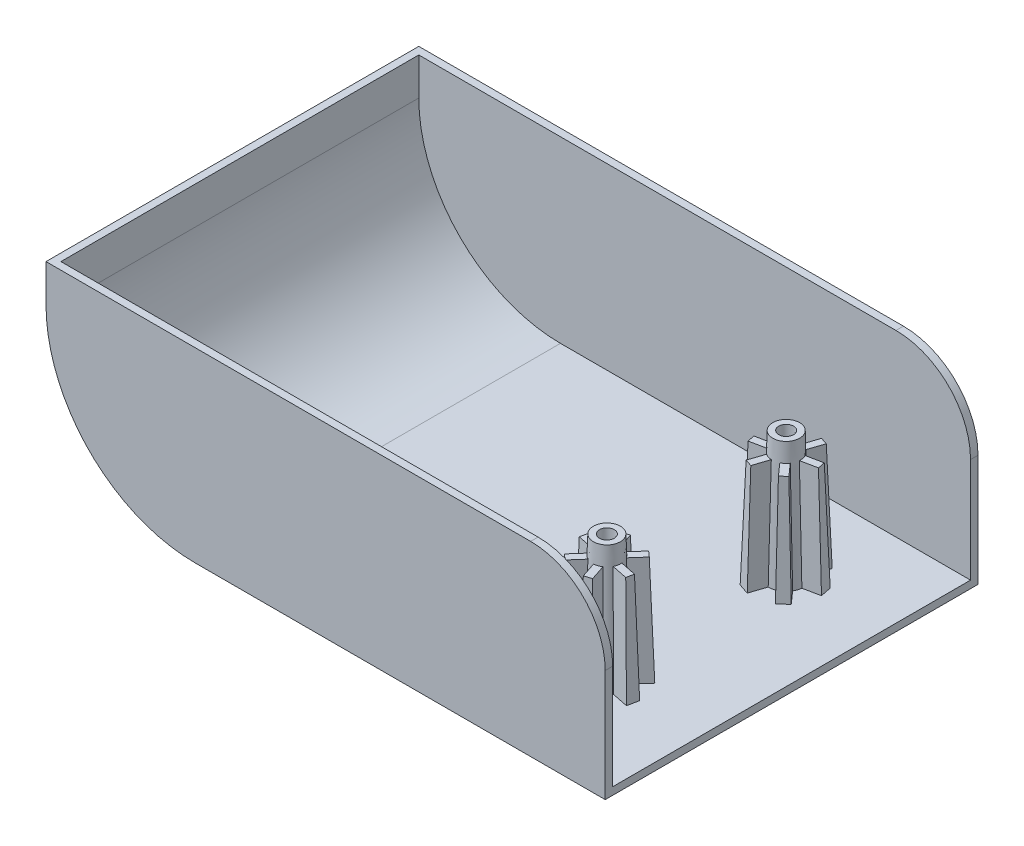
ISO-10303-21;
HEADER;
FILE_DESCRIPTION(('STEP AP214'),'2;1');
FILE_NAME('part.step','',(''),(''),'','','');
FILE_SCHEMA(('AUTOMOTIVE_DESIGN { 1 0 10303 214 1 1 1 1 }'));
ENDSEC;
DATA;
#1=APPLICATION_CONTEXT('core data for automotive mechanical design processes');
#2=APPLICATION_PROTOCOL_DEFINITION('international standard','automotive_design',2000,#1);
#3=PRODUCT_CONTEXT('',#1,'mechanical');
#4=PRODUCT('Part','Part','',(#3));
#5=PRODUCT_RELATED_PRODUCT_CATEGORY('part','',(#4));
#6=PRODUCT_DEFINITION_FORMATION('','',#4);
#7=PRODUCT_DEFINITION_CONTEXT('part definition',#1,'design');
#8=PRODUCT_DEFINITION('design','',#6,#7);
#9=PRODUCT_DEFINITION_SHAPE('','',#8);
#10=(LENGTH_UNIT() NAMED_UNIT(*) SI_UNIT(.MILLI.,.METRE.));
#11=(NAMED_UNIT(*) PLANE_ANGLE_UNIT() SI_UNIT($,.RADIAN.));
#12=(NAMED_UNIT(*) SI_UNIT($,.STERADIAN.) SOLID_ANGLE_UNIT());
#13=UNCERTAINTY_MEASURE_WITH_UNIT(LENGTH_MEASURE(1.E-05),#10,'distance_accuracy_value','');
#14=(GEOMETRIC_REPRESENTATION_CONTEXT(3) GLOBAL_UNCERTAINTY_ASSIGNED_CONTEXT((#13)) GLOBAL_UNIT_ASSIGNED_CONTEXT((#10,
#11,#12)) REPRESENTATION_CONTEXT('',''));
#15=CARTESIAN_POINT('',(0.,0.,0.));
#16=DIRECTION('',(0.,0.,1.));
#17=DIRECTION('',(1.,0.,0.));
#18=AXIS2_PLACEMENT_3D('',#15,#16,#17);
#19=CARTESIAN_POINT('',(0.,0.,25.));
#20=DIRECTION('',(-1.,0.,0.));
#21=DIRECTION('',(0.,0.,1.));
#22=AXIS2_PLACEMENT_3D('',#19,#20,#21);
#23=PLANE('',#22);
#24=DIRECTION('',(0.,1.,0.));
#25=VECTOR('',#24,1.);
#26=CARTESIAN_POINT('',(0.,20.,-24.));
#27=LINE('',#26,#25);
#28=CARTESIAN_POINT('',(0.,1.,-24.));
#29=VERTEX_POINT('',#28);
#30=CARTESIAN_POINT('',(0.,15.,-24.));
#31=VERTEX_POINT('',#30);
#32=EDGE_CURVE('E803',#29,#31,#27,.T.);
#33=ORIENTED_EDGE('',*,*,#32,.F.);
#34=DIRECTION('',(0.,0.,-1.));
#35=VECTOR('',#34,1.);
#36=CARTESIAN_POINT('',(0.,1.,25.));
#37=LINE('',#36,#35);
#38=CARTESIAN_POINT('',(0.,1.,24.));
#39=VERTEX_POINT('',#38);
#40=EDGE_CURVE('E798',#39,#29,#37,.T.);
#41=ORIENTED_EDGE('',*,*,#40,.F.);
#42=DIRECTION('',(0.,1.,0.));
#43=VECTOR('',#42,1.);
#44=CARTESIAN_POINT('',(0.,20.,24.));
#45=LINE('',#44,#43);
#46=CARTESIAN_POINT('',(0.,15.,24.));
#47=VERTEX_POINT('',#46);
#48=EDGE_CURVE('E772',#39,#47,#45,.T.);
#49=ORIENTED_EDGE('',*,*,#48,.T.);
#50=DIRECTION('',(0.,0.,-1.));
#51=VECTOR('',#50,1.);
#52=CARTESIAN_POINT('',(0.,15.,25.));
#53=LINE('',#52,#51);
#54=CARTESIAN_POINT('',(0.,15.,25.));
#55=VERTEX_POINT('',#54);
#56=EDGE_CURVE('E767',#47,#55,#53,.F.);
#57=ORIENTED_EDGE('',*,*,#56,.T.);
#58=DIRECTION('',(0.,1.,0.));
#59=VECTOR('',#58,1.);
#60=CARTESIAN_POINT('',(0.,0.,25.));
#61=LINE('',#60,#59);
#62=CARTESIAN_POINT('',(0.,0.,25.));
#63=VERTEX_POINT('',#62);
#64=EDGE_CURVE('E733',#63,#55,#61,.T.);
#65=ORIENTED_EDGE('',*,*,#64,.F.);
#66=DIRECTION('',(0.,0.,-1.));
#67=VECTOR('',#66,1.);
#68=CARTESIAN_POINT('',(0.,0.,25.));
#69=LINE('',#68,#67);
#70=CARTESIAN_POINT('',(0.,0.,-25.));
#71=VERTEX_POINT('',#70);
#72=EDGE_CURVE('E718',#63,#71,#69,.T.);
#73=ORIENTED_EDGE('',*,*,#72,.T.);
#74=DIRECTION('',(0.,1.,0.));
#75=VECTOR('',#74,1.);
#76=CARTESIAN_POINT('',(0.,0.,-25.));
#77=LINE('',#76,#75);
#78=CARTESIAN_POINT('',(0.,15.,-25.));
#79=VERTEX_POINT('',#78);
#80=EDGE_CURVE('E726',#71,#79,#77,.T.);
#81=ORIENTED_EDGE('',*,*,#80,.T.);
#82=EDGE_CURVE('E41',#79,#31,#53,.F.);
#83=ORIENTED_EDGE('',*,*,#82,.T.);
#84=EDGE_LOOP('',(#33,#41,#49,#57,#65,#73,#81,#83));
#85=FACE_BOUND('',#84,.T.);
#86=ADVANCED_FACE('F33',(#85),#23,.F.);
#87=CARTESIAN_POINT('',(-10.,15.,25.));
#88=DIRECTION('',(0.,0.,-1.));
#89=DIRECTION('',(-1.,0.,0.));
#90=AXIS2_PLACEMENT_3D('',#87,#88,#89);
#91=CYLINDRICAL_SURFACE('',#90,10.);
#92=ORIENTED_EDGE('',*,*,#56,.F.);
#93=CARTESIAN_POINT('',(-10.,15.,24.));
#94=DIRECTION('',(0.,0.,-1.));
#95=DIRECTION('',(-1.,0.,0.));
#96=AXIS2_PLACEMENT_3D('',#93,#94,#95);
#97=CIRCLE('',#96,10.);
#98=CARTESIAN_POINT('',(-10.,25.,24.));
#99=VERTEX_POINT('',#98);
#100=EDGE_CURVE('E779',#47,#99,#97,.F.);
#101=ORIENTED_EDGE('',*,*,#100,.T.);
#102=DIRECTION('',(0.,0.,-1.));
#103=VECTOR('',#102,1.);
#104=CARTESIAN_POINT('',(-10.,25.,25.));
#105=LINE('',#104,#103);
#106=CARTESIAN_POINT('',(-10.,25.,25.));
#107=VERTEX_POINT('',#106);
#108=EDGE_CURVE('E764',#107,#99,#105,.T.);
#109=ORIENTED_EDGE('',*,*,#108,.F.);
#110=CARTESIAN_POINT('',(-10.,15.,25.));
#111=DIRECTION('',(0.,0.,-1.));
#112=DIRECTION('',(-1.,0.,0.));
#113=AXIS2_PLACEMENT_3D('',#110,#111,#112);
#114=CIRCLE('',#113,10.);
#115=EDGE_CURVE('E11',#55,#107,#114,.F.);
#116=ORIENTED_EDGE('',*,*,#115,.F.);
#117=EDGE_LOOP('',(#92,#101,#109,#116));
#118=FACE_BOUND('',#117,.T.);
#119=ADVANCED_FACE('F691',(#118),#91,.T.);
#120=CARTESIAN_POINT('',(-10.,25.,-24.));
#121=VERTEX_POINT('',#120);
#122=CARTESIAN_POINT('',(-10.,25.,-25.));
#123=VERTEX_POINT('',#122);
#124=EDGE_CURVE('E763',#121,#123,#105,.T.);
#125=ORIENTED_EDGE('',*,*,#124,.F.);
#126=CARTESIAN_POINT('',(-10.,15.,-24.));
#127=DIRECTION('',(0.,0.,-1.));
#128=DIRECTION('',(-1.,0.,0.));
#129=AXIS2_PLACEMENT_3D('',#126,#127,#128);
#130=CIRCLE('',#129,10.);
#131=EDGE_CURVE('E789',#121,#31,#130,.T.);
#132=ORIENTED_EDGE('',*,*,#131,.T.);
#133=ORIENTED_EDGE('',*,*,#82,.F.);
#134=CARTESIAN_POINT('',(-10.,15.,-25.));
#135=DIRECTION('',(0.,0.,-1.));
#136=DIRECTION('',(-1.,0.,0.));
#137=AXIS2_PLACEMENT_3D('',#134,#135,#136);
#138=CIRCLE('',#137,10.);
#139=EDGE_CURVE('E739',#123,#79,#138,.T.);
#140=ORIENTED_EDGE('',*,*,#139,.F.);
#141=EDGE_LOOP('',(#125,#132,#133,#140));
#142=FACE_BOUND('',#141,.T.);
#143=ADVANCED_FACE('F697',(#142),#91,.T.);
#144=CARTESIAN_POINT('',(-55.,20.,25.));
#145=DIRECTION('',(0.,0.,-1.));
#146=DIRECTION('',(-1.,0.,0.));
#147=AXIS2_PLACEMENT_3D('',#144,#145,#146);
#148=CYLINDRICAL_SURFACE('',#147,20.);
#149=CARTESIAN_POINT('',(-55.,20.,-25.));
#150=DIRECTION('',(0.,0.,1.));
#151=DIRECTION('',(-1.,0.,0.));
#152=AXIS2_PLACEMENT_3D('',#149,#150,#151);
#153=CIRCLE('',#152,20.);
#154=CARTESIAN_POINT('',(-75.,20.,-25.));
#155=VERTEX_POINT('',#154);
#156=CARTESIAN_POINT('',(-55.,0.,-25.));
#157=VERTEX_POINT('',#156);
#158=EDGE_CURVE('E727',#155,#157,#153,.T.);
#159=ORIENTED_EDGE('',*,*,#158,.T.);
#160=DIRECTION('',(0.,0.,-1.));
#161=VECTOR('',#160,1.);
#162=CARTESIAN_POINT('',(-55.,0.,25.));
#163=LINE('',#162,#161);
#164=CARTESIAN_POINT('',(-55.,0.,25.));
#165=VERTEX_POINT('',#164);
#166=EDGE_CURVE('E721',#165,#157,#163,.T.);
#167=ORIENTED_EDGE('',*,*,#166,.F.);
#168=CARTESIAN_POINT('',(-55.,20.,25.));
#169=DIRECTION('',(0.,0.,1.));
#170=DIRECTION('',(-1.,0.,0.));
#171=AXIS2_PLACEMENT_3D('',#168,#169,#170);
#172=CIRCLE('',#171,20.);
#173=CARTESIAN_POINT('',(-75.,20.,25.));
#174=VERTEX_POINT('',#173);
#175=EDGE_CURVE('E747',#174,#165,#172,.T.);
#176=ORIENTED_EDGE('',*,*,#175,.F.);
#177=DIRECTION('',(0.,0.,-1.));
#178=VECTOR('',#177,1.);
#179=CARTESIAN_POINT('',(-75.,20.,25.));
#180=LINE('',#179,#178);
#181=EDGE_CURVE('E757',#174,#155,#180,.T.);
#182=ORIENTED_EDGE('',*,*,#181,.T.);
#183=EDGE_LOOP('',(#159,#167,#176,#182));
#184=FACE_BOUND('',#183,.T.);
#185=ADVANCED_FACE('F35',(#184),#148,.T.);
#186=CARTESIAN_POINT('',(0.,0.,25.));
#187=DIRECTION('',(0.,1.,0.));
#188=DIRECTION('',(0.,0.,1.));
#189=AXIS2_PLACEMENT_3D('',#186,#187,#188);
#190=PLANE('',#189);
#191=DIRECTION('',(1.,0.,0.));
#192=VECTOR('',#191,1.);
#193=CARTESIAN_POINT('',(0.,0.,-25.));
#194=LINE('',#193,#192);
#195=EDGE_CURVE('E716',#157,#71,#194,.T.);
#196=ORIENTED_EDGE('',*,*,#195,.T.);
#197=ORIENTED_EDGE('',*,*,#72,.F.);
#198=DIRECTION('',(1.,0.,0.));
#199=VECTOR('',#198,1.);
#200=CARTESIAN_POINT('',(0.,0.,25.));
#201=LINE('',#200,#199);
#202=EDGE_CURVE('E750',#165,#63,#201,.T.);
#203=ORIENTED_EDGE('',*,*,#202,.F.);
#204=ORIENTED_EDGE('',*,*,#166,.T.);
#205=EDGE_LOOP('',(#196,#197,#203,#204));
#206=FACE_BOUND('',#205,.T.);
#207=ADVANCED_FACE('F704',(#206),#190,.F.);
#208=CARTESIAN_POINT('',(0.,25.,25.));
#209=DIRECTION('',(0.,-1.,0.));
#210=DIRECTION('',(0.,0.,-1.));
#211=AXIS2_PLACEMENT_3D('',#208,#209,#210);
#212=PLANE('',#211);
#213=ORIENTED_EDGE('',*,*,#108,.T.);
#214=DIRECTION('',(-1.,0.,0.));
#215=VECTOR('',#214,1.);
#216=CARTESIAN_POINT('',(-55.,25.,24.));
#217=LINE('',#216,#215);
#218=CARTESIAN_POINT('',(-74.,25.,24.));
#219=VERTEX_POINT('',#218);
#220=EDGE_CURVE('E782',#99,#219,#217,.T.);
#221=ORIENTED_EDGE('',*,*,#220,.T.);
#222=DIRECTION('',(0.,0.,-1.));
#223=VECTOR('',#222,1.);
#224=CARTESIAN_POINT('',(-74.,25.,25.));
#225=LINE('',#224,#223);
#226=CARTESIAN_POINT('',(-74.,25.,-24.));
#227=VERTEX_POINT('',#226);
#228=EDGE_CURVE('E796',#219,#227,#225,.T.);
#229=ORIENTED_EDGE('',*,*,#228,.T.);
#230=DIRECTION('',(-1.,0.,0.));
#231=VECTOR('',#230,1.);
#232=CARTESIAN_POINT('',(-55.,25.,-24.));
#233=LINE('',#232,#231);
#234=EDGE_CURVE('E800',#121,#227,#233,.T.);
#235=ORIENTED_EDGE('',*,*,#234,.F.);
#236=ORIENTED_EDGE('',*,*,#124,.T.);
#237=DIRECTION('',(-1.,0.,0.));
#238=VECTOR('',#237,1.);
#239=CARTESIAN_POINT('',(0.,25.,-25.));
#240=LINE('',#239,#238);
#241=CARTESIAN_POINT('',(-75.,25.,-25.));
#242=VERTEX_POINT('',#241);
#243=EDGE_CURVE('E740',#123,#242,#240,.T.);
#244=ORIENTED_EDGE('',*,*,#243,.T.);
#245=DIRECTION('',(0.,0.,-1.));
#246=VECTOR('',#245,1.);
#247=CARTESIAN_POINT('',(-75.,25.,25.));
#248=LINE('',#247,#246);
#249=CARTESIAN_POINT('',(-75.,25.,25.));
#250=VERTEX_POINT('',#249);
#251=EDGE_CURVE('E734',#250,#242,#248,.T.);
#252=ORIENTED_EDGE('',*,*,#251,.F.);
#253=DIRECTION('',(-1.,0.,0.));
#254=VECTOR('',#253,1.);
#255=CARTESIAN_POINT('',(0.,25.,25.));
#256=LINE('',#255,#254);
#257=EDGE_CURVE('E753',#107,#250,#256,.T.);
#258=ORIENTED_EDGE('',*,*,#257,.F.);
#259=EDGE_LOOP('',(#213,#221,#229,#235,#236,#244,#252,#258));
#260=FACE_BOUND('',#259,.T.);
#261=ADVANCED_FACE('F702',(#260),#212,.F.);
#262=CARTESIAN_POINT('',(-75.,20.,25.));
#263=DIRECTION('',(1.,0.,0.));
#264=DIRECTION('',(0.,1.,0.));
#265=AXIS2_PLACEMENT_3D('',#262,#263,#264);
#266=PLANE('',#265);
#267=DIRECTION('',(0.,-1.,0.));
#268=VECTOR('',#267,1.);
#269=CARTESIAN_POINT('',(-75.,20.,-25.));
#270=LINE('',#269,#268);
#271=EDGE_CURVE('E742',#242,#155,#270,.T.);
#272=ORIENTED_EDGE('',*,*,#271,.T.);
#273=ORIENTED_EDGE('',*,*,#181,.F.);
#274=DIRECTION('',(0.,-1.,0.));
#275=VECTOR('',#274,1.);
#276=CARTESIAN_POINT('',(-75.,20.,25.));
#277=LINE('',#276,#275);
#278=EDGE_CURVE('E755',#250,#174,#277,.T.);
#279=ORIENTED_EDGE('',*,*,#278,.F.);
#280=ORIENTED_EDGE('',*,*,#251,.T.);
#281=EDGE_LOOP('',(#272,#273,#279,#280));
#282=FACE_BOUND('',#281,.T.);
#283=ADVANCED_FACE('F711',(#282),#266,.F.);
#284=CARTESIAN_POINT('',(-55.,20.,25.));
#285=DIRECTION('',(0.,0.,-1.));
#286=DIRECTION('',(-1.,0.,0.));
#287=AXIS2_PLACEMENT_3D('',#284,#285,#286);
#288=PLANE('',#287);
#289=ORIENTED_EDGE('',*,*,#64,.T.);
#290=ORIENTED_EDGE('',*,*,#115,.T.);
#291=ORIENTED_EDGE('',*,*,#257,.T.);
#292=ORIENTED_EDGE('',*,*,#278,.T.);
#293=ORIENTED_EDGE('',*,*,#175,.T.);
#294=ORIENTED_EDGE('',*,*,#202,.T.);
#295=EDGE_LOOP('',(#289,#290,#291,#292,#293,#294));
#296=FACE_BOUND('',#295,.T.);
#297=ADVANCED_FACE('F776',(#296),#288,.F.);
#298=CARTESIAN_POINT('',(-55.,20.,-25.));
#299=DIRECTION('',(0.,0.,-1.));
#300=DIRECTION('',(-1.,0.,0.));
#301=AXIS2_PLACEMENT_3D('',#298,#299,#300);
#302=PLANE('',#301);
#303=ORIENTED_EDGE('',*,*,#243,.F.);
#304=ORIENTED_EDGE('',*,*,#139,.T.);
#305=ORIENTED_EDGE('',*,*,#80,.F.);
#306=ORIENTED_EDGE('',*,*,#195,.F.);
#307=ORIENTED_EDGE('',*,*,#158,.F.);
#308=ORIENTED_EDGE('',*,*,#271,.F.);
#309=EDGE_LOOP('',(#303,#304,#305,#306,#307,#308));
#310=FACE_BOUND('',#309,.T.);
#311=ADVANCED_FACE('F737',(#310),#302,.T.);
#312=CARTESIAN_POINT('',(-55.,20.,25.));
#313=DIRECTION('',(0.,0.,-1.));
#314=DIRECTION('',(-1.,0.,0.));
#315=AXIS2_PLACEMENT_3D('',#312,#313,#314);
#316=CYLINDRICAL_SURFACE('',#315,19.);
#317=CARTESIAN_POINT('',(-55.,20.,-24.));
#318=DIRECTION('',(0.,0.,-1.));
#319=DIRECTION('',(-1.,0.,0.));
#320=AXIS2_PLACEMENT_3D('',#317,#318,#319);
#321=CIRCLE('',#320,19.);
#322=CARTESIAN_POINT('',(-74.,20.,-24.));
#323=VERTEX_POINT('',#322);
#324=CARTESIAN_POINT('',(-55.,1.,-24.));
#325=VERTEX_POINT('',#324);
#326=EDGE_CURVE('E816',#323,#325,#321,.F.);
#327=ORIENTED_EDGE('',*,*,#326,.F.);
#328=DIRECTION('',(0.,0.,-1.));
#329=VECTOR('',#328,1.);
#330=CARTESIAN_POINT('',(-74.,20.,25.));
#331=LINE('',#330,#329);
#332=CARTESIAN_POINT('',(-74.,20.,24.));
#333=VERTEX_POINT('',#332);
#334=EDGE_CURVE('E799',#333,#323,#331,.T.);
#335=ORIENTED_EDGE('',*,*,#334,.F.);
#336=CARTESIAN_POINT('',(-55.,20.,24.));
#337=DIRECTION('',(0.,0.,-1.));
#338=DIRECTION('',(-1.,0.,0.));
#339=AXIS2_PLACEMENT_3D('',#336,#337,#338);
#340=CIRCLE('',#339,19.);
#341=CARTESIAN_POINT('',(-55.,1.,24.));
#342=VERTEX_POINT('',#341);
#343=EDGE_CURVE('E812',#333,#342,#340,.F.);
#344=ORIENTED_EDGE('',*,*,#343,.T.);
#345=DIRECTION('',(0.,0.,1.));
#346=VECTOR('',#345,1.);
#347=CARTESIAN_POINT('',(-55.,1.,25.));
#348=LINE('',#347,#346);
#349=EDGE_CURVE('E806',#342,#325,#348,.F.);
#350=ORIENTED_EDGE('',*,*,#349,.T.);
#351=EDGE_LOOP('',(#327,#335,#344,#350));
#352=FACE_BOUND('',#351,.T.);
#353=ADVANCED_FACE('F1527',(#352),#316,.F.);
#354=CARTESIAN_POINT('',(0.,1.,25.));
#355=DIRECTION('',(0.,1.,0.));
#356=DIRECTION('',(0.,0.,1.));
#357=AXIS2_PLACEMENT_3D('',#354,#355,#356);
#358=PLANE('',#357);
#359=DIRECTION('',(0.200480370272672,0.,0.979697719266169));
#360=VECTOR('',#359,1.);
#361=CARTESIAN_POINT('',(-4.68703302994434,1.,4.90714311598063));
#362=LINE('',#361,#360);
#363=CARTESIAN_POINT('',(-8.48715146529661,1.,-13.6630907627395));
#364=VERTEX_POINT('',#363);
#365=CARTESIAN_POINT('',(-8.18643090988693,1.,-12.193544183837));
#366=VERTEX_POINT('',#365);
#367=EDGE_CURVE('E52',#364,#366,#362,.T.);
#368=ORIENTED_EDGE('',*,*,#367,.T.);
#369=DIRECTION('',(-0.979697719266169,0.,0.200480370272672));
#370=VECTOR('',#369,1.);
#371=CARTESIAN_POINT('',(-10.6418974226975,1.,-11.6910699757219));
#372=LINE('',#371,#370);
#373=CARTESIAN_POINT('',(-10.3677754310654,1.,-11.7471649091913));
#374=VERTEX_POINT('',#373);
#375=EDGE_CURVE('E1165',#366,#374,#372,.T.);
#376=ORIENTED_EDGE('',*,*,#375,.T.);
#377=CARTESIAN_POINT('',(-12.7516531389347,1.,-12.0248825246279));
#378=DIRECTION('',(0.,1.,0.));
#379=DIRECTION('',(0.,0.,1.));
#380=AXIS2_PLACEMENT_3D('',#377,#378,#379);
#381=CIRCLE('',#380,2.4);
#382=CARTESIAN_POINT('',(-10.6779204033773,1.,-10.8167299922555));
#383=VERTEX_POINT('',#382);
#384=EDGE_CURVE('E1168',#374,#383,#381,.F.);
#385=ORIENTED_EDGE('',*,*,#384,.T.);
#386=DIRECTION('',(0.663469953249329,0.,0.748202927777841));
#387=VECTOR('',#386,1.);
#388=CARTESIAN_POINT('',(-10.8635610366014,1.,-11.0260791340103));
#389=LINE('',#388,#387);
#390=CARTESIAN_POINT('',(-9.20067235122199,1.,-9.15081985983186));
#391=VERTEX_POINT('',#390);
#392=EDGE_CURVE('E1153',#383,#391,#389,.T.);
#393=ORIENTED_EDGE('',*,*,#392,.T.);
#394=DIRECTION('',(-0.748202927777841,0.,0.663469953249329));
#395=VECTOR('',#394,1.);
#396=CARTESIAN_POINT('',(-23.3829074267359,1.,3.42529618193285));
#397=LINE('',#396,#395);
#398=CARTESIAN_POINT('',(-10.3229767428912,1.,-8.15561492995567));
#399=VERTEX_POINT('',#398);
#400=EDGE_CURVE('E1160',#391,#399,#397,.T.);
#401=ORIENTED_EDGE('',*,*,#400,.T.);
#402=DIRECTION('',(-0.663469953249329,0.,-0.748202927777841));
#403=VECTOR('',#402,1.);
#404=CARTESIAN_POINT('',(-11.9858654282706,1.,-10.0308742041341));
#405=LINE('',#404,#403);
#406=CARTESIAN_POINT('',(-11.8002247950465,1.,-9.82152506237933));
#407=VERTEX_POINT('',#406);
#408=EDGE_CURVE('E1158',#399,#407,#405,.T.);
#409=ORIENTED_EDGE('',*,*,#408,.T.);
#410=CARTESIAN_POINT('',(-12.7610775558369,1.,-9.6249010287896));
#411=VERTEX_POINT('',#410);
#412=EDGE_CURVE('E1143',#407,#411,#381,.F.);
#413=ORIENTED_EDGE('',*,*,#412,.T.);
#414=DIRECTION('',(-0.316227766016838,0.,0.948683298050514));
#415=VECTOR('',#414,1.);
#416=CARTESIAN_POINT('',(-12.6725961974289,1.,-9.89034510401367));
#417=LINE('',#416,#415);
#418=CARTESIAN_POINT('',(-13.46517402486,1.,-7.5126116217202));
#419=VERTEX_POINT('',#418);
#420=EDGE_CURVE('E1148',#411,#419,#417,.T.);
#421=ORIENTED_EDGE('',*,*,#420,.T.);
#422=DIRECTION('',(-0.948683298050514,0.,-0.316227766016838));
#423=VECTOR('',#422,1.);
#424=CARTESIAN_POINT('',(-31.4475275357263,1.,-13.5067294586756));
#425=LINE('',#424,#423);
#426=CARTESIAN_POINT('',(-14.888198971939,1.,-7.98695327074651));
#427=VERTEX_POINT('',#426);
#428=EDGE_CURVE('E1149',#419,#427,#425,.T.);
#429=ORIENTED_EDGE('',*,*,#428,.T.);
#430=DIRECTION('',(0.316227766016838,0.,-0.948683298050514));
#431=VECTOR('',#430,1.);
#432=CARTESIAN_POINT('',(-14.0956211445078,1.,-10.36468675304));
#433=LINE('',#432,#431);
#434=CARTESIAN_POINT('',(-14.1841025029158,1.,-10.0992426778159));
#435=VERTEX_POINT('',#434);
#436=EDGE_CURVE('E1147',#427,#435,#433,.T.);
#437=ORIENTED_EDGE('',*,*,#436,.T.);
#438=CARTESIAN_POINT('',(-14.8348102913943,1.,-10.8330535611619));
#439=VERTEX_POINT('',#438);
#440=EDGE_CURVE('E1119',#435,#439,#381,.F.);
#441=ORIENTED_EDGE('',*,*,#440,.T.);
#442=DIRECTION('',(-0.979697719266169,0.,0.200480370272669));
#443=VECTOR('',#442,1.);
#444=CARTESIAN_POINT('',(-14.5606882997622,1.,-10.8891484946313));
#445=LINE('',#444,#443);
#446=CARTESIAN_POINT('',(-17.0161548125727,1.,-10.3866742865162));
#447=VERTEX_POINT('',#446);
#448=EDGE_CURVE('E1125',#439,#447,#445,.T.);
#449=ORIENTED_EDGE('',*,*,#448,.T.);
#450=DIRECTION('',(-0.200480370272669,0.,-0.979697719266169));
#451=VECTOR('',#450,1.);
#452=CARTESIAN_POINT('',(-20.8162732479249,1.,-28.9569081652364));
#453=LINE('',#452,#451);
#454=CARTESIAN_POINT('',(-17.3168753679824,1.,-11.8562208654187));
#455=VERTEX_POINT('',#454);
#456=EDGE_CURVE('E424',#447,#455,#453,.T.);
#457=ORIENTED_EDGE('',*,*,#456,.T.);
#458=DIRECTION('',(0.979697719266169,0.,-0.200480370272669));
#459=VECTOR('',#458,1.);
#460=CARTESIAN_POINT('',(-14.8614088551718,1.,-12.3586950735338));
#461=LINE('',#460,#459);
#462=CARTESIAN_POINT('',(-15.135530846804,1.,-12.3026001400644));
#463=VERTEX_POINT('',#462);
#464=EDGE_CURVE('E1123',#455,#463,#461,.T.);
#465=ORIENTED_EDGE('',*,*,#464,.T.);
#466=CARTESIAN_POINT('',(-14.8253858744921,1.,-13.2330350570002));
#467=VERTEX_POINT('',#466);
#468=EDGE_CURVE('E1131',#463,#467,#381,.F.);
#469=ORIENTED_EDGE('',*,*,#468,.T.);
#470=DIRECTION('',(-0.663469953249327,0.,-0.748202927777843));
#471=VECTOR('',#470,1.);
#472=CARTESIAN_POINT('',(-14.639745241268,1.,-13.0236859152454));
#473=LINE('',#472,#471);
#474=CARTESIAN_POINT('',(-16.3026339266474,1.,-14.8989451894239));
#475=VERTEX_POINT('',#474);
#476=EDGE_CURVE('E1144',#467,#475,#473,.T.);
#477=ORIENTED_EDGE('',*,*,#476,.T.);
#478=DIRECTION('',(0.748202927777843,0.,-0.663469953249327));
#479=VECTOR('',#478,1.);
#480=CARTESIAN_POINT('',(-2.12039885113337,1.,-27.4750612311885));
#481=LINE('',#480,#479);
#482=CARTESIAN_POINT('',(-15.1803295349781,1.,-15.8941501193));
#483=VERTEX_POINT('',#482);
#484=EDGE_CURVE('E1136',#475,#483,#481,.T.);
#485=ORIENTED_EDGE('',*,*,#484,.T.);
#486=DIRECTION('',(0.663469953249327,0.,0.748202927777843));
#487=VECTOR('',#486,1.);
#488=CARTESIAN_POINT('',(-13.5174408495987,1.,-14.0188908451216));
#489=LINE('',#488,#487);
#490=CARTESIAN_POINT('',(-13.7030814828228,1.,-14.2282399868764));
#491=VERTEX_POINT('',#490);
#492=EDGE_CURVE('E1138',#483,#491,#489,.T.);
#493=ORIENTED_EDGE('',*,*,#492,.T.);
#494=CARTESIAN_POINT('',(-12.7422287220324,1.,-14.4248640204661));
#495=VERTEX_POINT('',#494);
#496=EDGE_CURVE('E1970',#491,#495,#381,.F.);
#497=ORIENTED_EDGE('',*,*,#496,.T.);
#498=DIRECTION('',(0.316227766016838,0.,-0.948683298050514));
#499=VECTOR('',#498,1.);
#500=CARTESIAN_POINT('',(-12.8307100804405,1.,-14.159419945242));
#501=LINE('',#500,#499);
#502=CARTESIAN_POINT('',(-12.0381322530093,1.,-16.5371534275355));
#503=VERTEX_POINT('',#502);
#504=EDGE_CURVE('E1155',#495,#503,#501,.T.);
#505=ORIENTED_EDGE('',*,*,#504,.T.);
#506=DIRECTION('',(0.948683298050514,0.,0.316227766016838));
#507=VECTOR('',#506,1.);
#508=CARTESIAN_POINT('',(5.94422125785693,1.,-10.5430355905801));
#509=LINE('',#508,#507);
#510=CARTESIAN_POINT('',(-10.6151073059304,1.,-16.0628117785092));
#511=VERTEX_POINT('',#510);
#512=EDGE_CURVE('E1146',#503,#511,#509,.T.);
#513=ORIENTED_EDGE('',*,*,#512,.T.);
#514=DIRECTION('',(-0.316227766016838,0.,0.948683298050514));
#515=VECTOR('',#514,1.);
#516=CARTESIAN_POINT('',(-11.4076851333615,1.,-13.6850782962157));
#517=LINE('',#516,#515);
#518=CARTESIAN_POINT('',(-11.3192037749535,1.,-13.9505223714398));
#519=VERTEX_POINT('',#518);
#520=EDGE_CURVE('E1157',#511,#519,#517,.T.);
#521=ORIENTED_EDGE('',*,*,#520,.T.);
#522=CARTESIAN_POINT('',(-10.668495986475,1.,-13.2167114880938));
#523=VERTEX_POINT('',#522);
#524=EDGE_CURVE('E1176',#519,#523,#381,.F.);
#525=ORIENTED_EDGE('',*,*,#524,.T.);
#526=DIRECTION('',(0.979697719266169,0.,-0.200480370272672));
#527=VECTOR('',#526,1.);
#528=CARTESIAN_POINT('',(-10.9426179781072,1.,-13.1606165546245));
#529=LINE('',#528,#527);
#530=EDGE_CURVE('E48',#523,#364,#529,.T.);
#531=ORIENTED_EDGE('',*,*,#530,.T.);
#532=EDGE_LOOP('',(#368,#376,#385,#393,#401,#409,#413,#421,#429,#437,#441,#449,#457,#465,#469,
#477,#485,#493,#497,#505,#513,#521,#525,#531));
#533=FACE_BOUND('',#532,.T.);
#534=DIRECTION('',(-0.200480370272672,0.,0.979697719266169));
#535=VECTOR('',#534,1.);
#536=CARTESIAN_POINT('',(-4.68703302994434,1.,-4.90714311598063));
#537=LINE('',#536,#535);
#538=CARTESIAN_POINT('',(-8.18643090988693,1.,12.193544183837));
#539=VERTEX_POINT('',#538);
#540=CARTESIAN_POINT('',(-8.48715146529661,1.,13.6630907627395));
#541=VERTEX_POINT('',#540);
#542=EDGE_CURVE('E1078',#539,#541,#537,.T.);
#543=ORIENTED_EDGE('',*,*,#542,.T.);
#544=DIRECTION('',(-0.979697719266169,0.,-0.200480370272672));
#545=VECTOR('',#544,1.);
#546=CARTESIAN_POINT('',(-10.9426179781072,1.,13.1606165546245));
#547=LINE('',#546,#545);
#548=CARTESIAN_POINT('',(-10.668495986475,1.,13.2167114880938));
#549=VERTEX_POINT('',#548);
#550=EDGE_CURVE('E1082',#541,#549,#547,.T.);
#551=ORIENTED_EDGE('',*,*,#550,.T.);
#552=CARTESIAN_POINT('',(-12.7516531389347,1.,12.0248825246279));
#553=DIRECTION('',(0.,1.,0.));
#554=DIRECTION('',(0.,0.,1.));
#555=AXIS2_PLACEMENT_3D('',#552,#553,#554);
#556=CIRCLE('',#555,2.4);
#557=CARTESIAN_POINT('',(-11.3192037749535,1.,13.9505223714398));
#558=VERTEX_POINT('',#557);
#559=EDGE_CURVE('E1858',#549,#558,#556,.F.);
#560=ORIENTED_EDGE('',*,*,#559,.T.);
#561=DIRECTION('',(0.316227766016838,0.,0.948683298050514));
#562=VECTOR('',#561,1.);
#563=CARTESIAN_POINT('',(-11.4076851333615,1.,13.6850782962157));
#564=LINE('',#563,#562);
#565=CARTESIAN_POINT('',(-10.6151073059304,1.,16.0628117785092));
#566=VERTEX_POINT('',#565);
#567=EDGE_CURVE('E1091',#558,#566,#564,.T.);
#568=ORIENTED_EDGE('',*,*,#567,.T.);
#569=DIRECTION('',(-0.948683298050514,0.,0.316227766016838));
#570=VECTOR('',#569,1.);
#571=CARTESIAN_POINT('',(5.94422125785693,1.,10.5430355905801));
#572=LINE('',#571,#570);
#573=CARTESIAN_POINT('',(-12.0381322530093,1.,16.5371534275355));
#574=VERTEX_POINT('',#573);
#575=EDGE_CURVE('E1093',#566,#574,#572,.T.);
#576=ORIENTED_EDGE('',*,*,#575,.T.);
#577=DIRECTION('',(-0.316227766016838,0.,-0.948683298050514));
#578=VECTOR('',#577,1.);
#579=CARTESIAN_POINT('',(-12.8307100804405,1.,14.159419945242));
#580=LINE('',#579,#578);
#581=CARTESIAN_POINT('',(-12.7422287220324,1.,14.4248640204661));
#582=VERTEX_POINT('',#581);
#583=EDGE_CURVE('E1081',#574,#582,#580,.T.);
#584=ORIENTED_EDGE('',*,*,#583,.T.);
#585=CARTESIAN_POINT('',(-13.7030814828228,1.,14.2282399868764));
#586=VERTEX_POINT('',#585);
#587=EDGE_CURVE('E1100',#582,#586,#556,.F.);
#588=ORIENTED_EDGE('',*,*,#587,.T.);
#589=DIRECTION('',(-0.663469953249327,0.,0.748202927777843));
#590=VECTOR('',#589,1.);
#591=CARTESIAN_POINT('',(-13.5174408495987,1.,14.0188908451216));
#592=LINE('',#591,#590);
#593=CARTESIAN_POINT('',(-15.1803295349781,1.,15.8941501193));
#594=VERTEX_POINT('',#593);
#595=EDGE_CURVE('E1103',#586,#594,#592,.T.);
#596=ORIENTED_EDGE('',*,*,#595,.T.);
#597=DIRECTION('',(-0.748202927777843,0.,-0.663469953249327));
#598=VECTOR('',#597,1.);
#599=CARTESIAN_POINT('',(-2.12039885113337,1.,27.4750612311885));
#600=LINE('',#599,#598);
#601=CARTESIAN_POINT('',(-16.3026339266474,1.,14.8989451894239));
#602=VERTEX_POINT('',#601);
#603=EDGE_CURVE('E1105',#594,#602,#600,.T.);
#604=ORIENTED_EDGE('',*,*,#603,.T.);
#605=DIRECTION('',(0.663469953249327,0.,-0.748202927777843));
#606=VECTOR('',#605,1.);
#607=CARTESIAN_POINT('',(-14.639745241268,1.,13.0236859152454));
#608=LINE('',#607,#606);
#609=CARTESIAN_POINT('',(-14.8253858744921,1.,13.2330350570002));
#610=VERTEX_POINT('',#609);
#611=EDGE_CURVE('E1095',#602,#610,#608,.T.);
#612=ORIENTED_EDGE('',*,*,#611,.T.);
#613=CARTESIAN_POINT('',(-15.135530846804,1.,12.3026001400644));
#614=VERTEX_POINT('',#613);
#615=EDGE_CURVE('E827',#610,#614,#556,.F.);
#616=ORIENTED_EDGE('',*,*,#615,.T.);
#617=DIRECTION('',(-0.979697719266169,0.,-0.200480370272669));
#618=VECTOR('',#617,1.);
#619=CARTESIAN_POINT('',(-14.8614088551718,1.,12.3586950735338));
#620=LINE('',#619,#618);
#621=CARTESIAN_POINT('',(-17.3168753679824,1.,11.8562208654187));
#622=VERTEX_POINT('',#621);
#623=EDGE_CURVE('E836',#614,#622,#620,.T.);
#624=ORIENTED_EDGE('',*,*,#623,.T.);
#625=DIRECTION('',(0.200480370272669,0.,-0.979697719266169));
#626=VECTOR('',#625,1.);
#627=CARTESIAN_POINT('',(-20.8162732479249,1.,28.9569081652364));
#628=LINE('',#627,#626);
#629=CARTESIAN_POINT('',(-17.0161548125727,1.,10.3866742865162));
#630=VERTEX_POINT('',#629);
#631=EDGE_CURVE('E825',#622,#630,#628,.T.);
#632=ORIENTED_EDGE('',*,*,#631,.T.);
#633=DIRECTION('',(0.979697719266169,0.,0.200480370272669));
#634=VECTOR('',#633,1.);
#635=CARTESIAN_POINT('',(-14.5606882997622,1.,10.8891484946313));
#636=LINE('',#635,#634);
#637=CARTESIAN_POINT('',(-14.8348102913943,1.,10.8330535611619));
#638=VERTEX_POINT('',#637);
#639=EDGE_CURVE('E1107',#630,#638,#636,.T.);
#640=ORIENTED_EDGE('',*,*,#639,.T.);
#641=CARTESIAN_POINT('',(-14.1841025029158,1.,10.0992426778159));
#642=VERTEX_POINT('',#641);
#643=EDGE_CURVE('E1111',#638,#642,#556,.F.);
#644=ORIENTED_EDGE('',*,*,#643,.T.);
#645=DIRECTION('',(-0.316227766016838,0.,-0.948683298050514));
#646=VECTOR('',#645,1.);
#647=CARTESIAN_POINT('',(-14.0956211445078,1.,10.36468675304));
#648=LINE('',#647,#646);
#649=CARTESIAN_POINT('',(-14.888198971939,1.,7.9869532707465));
#650=VERTEX_POINT('',#649);
#651=EDGE_CURVE('E1101',#642,#650,#648,.T.);
#652=ORIENTED_EDGE('',*,*,#651,.T.);
#653=DIRECTION('',(0.948683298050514,0.,-0.316227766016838));
#654=VECTOR('',#653,1.);
#655=CARTESIAN_POINT('',(-31.4475275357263,1.,13.5067294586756));
#656=LINE('',#655,#654);
#657=CARTESIAN_POINT('',(-13.46517402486,1.,7.5126116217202));
#658=VERTEX_POINT('',#657);
#659=EDGE_CURVE('E1088',#650,#658,#656,.T.);
#660=ORIENTED_EDGE('',*,*,#659,.T.);
#661=DIRECTION('',(0.316227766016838,0.,0.948683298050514));
#662=VECTOR('',#661,1.);
#663=CARTESIAN_POINT('',(-12.6725961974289,1.,9.89034510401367));
#664=LINE('',#663,#662);
#665=CARTESIAN_POINT('',(-12.7610775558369,1.,9.6249010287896));
#666=VERTEX_POINT('',#665);
#667=EDGE_CURVE('E1098',#658,#666,#664,.T.);
#668=ORIENTED_EDGE('',*,*,#667,.T.);
#669=CARTESIAN_POINT('',(-11.8002247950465,1.,9.82152506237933));
#670=VERTEX_POINT('',#669);
#671=EDGE_CURVE('E1862',#666,#670,#556,.F.);
#672=ORIENTED_EDGE('',*,*,#671,.T.);
#673=DIRECTION('',(0.663469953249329,0.,-0.748202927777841));
#674=VECTOR('',#673,1.);
#675=CARTESIAN_POINT('',(-11.9858654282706,1.,10.0308742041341));
#676=LINE('',#675,#674);
#677=CARTESIAN_POINT('',(-10.3229767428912,1.,8.15561492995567));
#678=VERTEX_POINT('',#677);
#679=EDGE_CURVE('E1089',#670,#678,#676,.T.);
#680=ORIENTED_EDGE('',*,*,#679,.T.);
#681=DIRECTION('',(0.748202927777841,0.,0.663469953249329));
#682=VECTOR('',#681,1.);
#683=CARTESIAN_POINT('',(-23.3829074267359,1.,-3.42529618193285));
#684=LINE('',#683,#682);
#685=CARTESIAN_POINT('',(-9.20067235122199,1.,9.15081985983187));
#686=VERTEX_POINT('',#685);
#687=EDGE_CURVE('E1084',#678,#686,#684,.T.);
#688=ORIENTED_EDGE('',*,*,#687,.T.);
#689=DIRECTION('',(-0.663469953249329,0.,0.748202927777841));
#690=VECTOR('',#689,1.);
#691=CARTESIAN_POINT('',(-10.8635610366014,1.,11.0260791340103));
#692=LINE('',#691,#690);
#693=CARTESIAN_POINT('',(-10.6779204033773,1.,10.8167299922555));
#694=VERTEX_POINT('',#693);
#695=EDGE_CURVE('E1086',#686,#694,#692,.T.);
#696=ORIENTED_EDGE('',*,*,#695,.T.);
#697=CARTESIAN_POINT('',(-10.3677754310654,1.,11.7471649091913));
#698=VERTEX_POINT('',#697);
#699=EDGE_CURVE('E1859',#694,#698,#556,.F.);
#700=ORIENTED_EDGE('',*,*,#699,.T.);
#701=DIRECTION('',(0.979697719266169,0.,0.200480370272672));
#702=VECTOR('',#701,1.);
#703=CARTESIAN_POINT('',(-10.6418974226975,1.,11.6910699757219));
#704=LINE('',#703,#702);
#705=EDGE_CURVE('E1080',#698,#539,#704,.T.);
#706=ORIENTED_EDGE('',*,*,#705,.T.);
#707=EDGE_LOOP('',(#543,#551,#560,#568,#576,#584,#588,#596,#604,#612,#616,#624,#632,#640,#644,
#652,#660,#668,#672,#680,#688,#696,#700,#706));
#708=FACE_BOUND('',#707,.T.);
#709=DIRECTION('',(1.,0.,0.));
#710=VECTOR('',#709,1.);
#711=CARTESIAN_POINT('',(-55.,1.,-24.));
#712=LINE('',#711,#710);
#713=EDGE_CURVE('E808',#325,#29,#712,.T.);
#714=ORIENTED_EDGE('',*,*,#713,.F.);
#715=ORIENTED_EDGE('',*,*,#349,.F.);
#716=DIRECTION('',(1.,0.,0.));
#717=VECTOR('',#716,1.);
#718=CARTESIAN_POINT('',(-55.,1.,24.));
#719=LINE('',#718,#717);
#720=EDGE_CURVE('E792',#342,#39,#719,.T.);
#721=ORIENTED_EDGE('',*,*,#720,.T.);
#722=ORIENTED_EDGE('',*,*,#40,.T.);
#723=EDGE_LOOP('',(#714,#715,#721,#722));
#724=FACE_BOUND('',#723,.T.);
#725=ADVANCED_FACE('F1133',(#533,#708,#724),#358,.T.);
#726=CARTESIAN_POINT('',(-74.,20.,25.));
#727=DIRECTION('',(1.,0.,0.));
#728=DIRECTION('',(0.,1.,0.));
#729=AXIS2_PLACEMENT_3D('',#726,#727,#728);
#730=PLANE('',#729);
#731=DIRECTION('',(0.,-1.,0.));
#732=VECTOR('',#731,1.);
#733=CARTESIAN_POINT('',(-74.,19.9999999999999,-24.));
#734=LINE('',#733,#732);
#735=EDGE_CURVE('E802',#227,#323,#734,.T.);
#736=ORIENTED_EDGE('',*,*,#735,.F.);
#737=ORIENTED_EDGE('',*,*,#228,.F.);
#738=DIRECTION('',(0.,-1.,0.));
#739=VECTOR('',#738,1.);
#740=CARTESIAN_POINT('',(-74.,19.9999999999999,24.));
#741=LINE('',#740,#739);
#742=EDGE_CURVE('E795',#219,#333,#741,.T.);
#743=ORIENTED_EDGE('',*,*,#742,.T.);
#744=ORIENTED_EDGE('',*,*,#334,.T.);
#745=EDGE_LOOP('',(#736,#737,#743,#744));
#746=FACE_BOUND('',#745,.T.);
#747=ADVANCED_FACE('F1526',(#746),#730,.T.);
#748=CARTESIAN_POINT('',(-55.,20.,24.));
#749=DIRECTION('',(0.,0.,-1.));
#750=DIRECTION('',(-1.,0.,0.));
#751=AXIS2_PLACEMENT_3D('',#748,#749,#750);
#752=PLANE('',#751);
#753=ORIENTED_EDGE('',*,*,#48,.F.);
#754=ORIENTED_EDGE('',*,*,#720,.F.);
#755=ORIENTED_EDGE('',*,*,#343,.F.);
#756=ORIENTED_EDGE('',*,*,#742,.F.);
#757=ORIENTED_EDGE('',*,*,#220,.F.);
#758=ORIENTED_EDGE('',*,*,#100,.F.);
#759=EDGE_LOOP('',(#753,#754,#755,#756,#757,#758));
#760=FACE_BOUND('',#759,.T.);
#761=ADVANCED_FACE('F1742',(#760),#752,.T.);
#762=CARTESIAN_POINT('',(-55.,20.,-24.));
#763=DIRECTION('',(0.,0.,-1.));
#764=DIRECTION('',(-1.,0.,0.));
#765=AXIS2_PLACEMENT_3D('',#762,#763,#764);
#766=PLANE('',#765);
#767=ORIENTED_EDGE('',*,*,#234,.T.);
#768=ORIENTED_EDGE('',*,*,#735,.T.);
#769=ORIENTED_EDGE('',*,*,#326,.T.);
#770=ORIENTED_EDGE('',*,*,#713,.T.);
#771=ORIENTED_EDGE('',*,*,#32,.T.);
#772=ORIENTED_EDGE('',*,*,#131,.F.);
#773=EDGE_LOOP('',(#767,#768,#769,#770,#771,#772));
#774=FACE_BOUND('',#773,.T.);
#775=ADVANCED_FACE('F1733',(#774),#766,.F.);
#776=CARTESIAN_POINT('',(-12.7516531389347,17.9999999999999,12.0248825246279));
#777=DIRECTION('',(0.,1.,0.));
#778=DIRECTION('',(0.948683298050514,0.,-0.316227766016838));
#779=AXIS2_PLACEMENT_3D('',#776,#777,#778);
#780=PLANE('',#779);
#781=CARTESIAN_POINT('',(-12.7516531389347,18.,12.0248825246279));
#782=DIRECTION('',(0.,-1.,0.));
#783=DIRECTION('',(-0.948683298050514,0.,0.316227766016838));
#784=AXIS2_PLACEMENT_3D('',#781,#782,#783);
#785=CIRCLE('',#784,1.);
#786=CARTESIAN_POINT('',(-13.7003364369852,18.,12.3411102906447));
#787=VERTEX_POINT('',#786);
#788=EDGE_CURVE('E1074',#787,#787,#785,.T.);
#789=ORIENTED_EDGE('',*,*,#788,.T.);
#790=EDGE_LOOP('',(#789));
#791=FACE_BOUND('',#790,.T.);
#792=CARTESIAN_POINT('',(-12.7516531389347,17.9999999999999,12.0248825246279));
#793=DIRECTION('',(0.,-1.,0.));
#794=DIRECTION('',(-0.948683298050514,0.,0.316227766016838));
#795=AXIS2_PLACEMENT_3D('',#792,#793,#794);
#796=CIRCLE('',#795,1.80634691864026);
#797=CARTESIAN_POINT('',(-14.4653042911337,17.9999999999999,12.5960995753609));
#798=VERTEX_POINT('',#797);
#799=EDGE_CURVE('E996',#798,#798,#796,.T.);
#800=ORIENTED_EDGE('',*,*,#799,.F.);
#801=EDGE_LOOP('',(#800));
#802=FACE_BOUND('',#801,.T.);
#803=ADVANCED_FACE('F1724',(#791,#802),#780,.T.);
#804=CARTESIAN_POINT('',(-12.7516531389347,17.9999999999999,12.0248825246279));
#805=DIRECTION('',(0.,-1.,0.));
#806=DIRECTION('',(-0.948683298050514,0.,0.316227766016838));
#807=AXIS2_PLACEMENT_3D('',#804,#805,#806);
#808=CONICAL_SURFACE('',#807,1.80634691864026,0.0349065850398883);
#809=ORIENTED_EDGE('',*,*,#615,.F.);
#810=CARTESIAN_POINT('',(-14.3357826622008,15.5002,13.0623858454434));
#811=CARTESIAN_POINT('',(-14.3771310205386,14.2811323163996,13.0769427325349));
#812=CARTESIAN_POINT('',(-14.4184248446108,13.0620620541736,13.0914380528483));
#813=CARTESIAN_POINT('',(-14.6246507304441,6.96669917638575,13.1636400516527));
#814=CARTESIAN_POINT('',(-14.7888530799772,2.09037211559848,13.2205229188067));
#815=CARTESIAN_POINT('',(-15.1164545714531,-7.6623194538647,13.333381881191));
#816=CARTESIAN_POINT('',(-15.2798537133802,-12.5386839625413,13.3893579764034));
#817=CARTESIAN_POINT('',(-15.6061564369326,-22.2914359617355,13.5007507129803));
#818=CARTESIAN_POINT('',(-15.7690600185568,-27.167823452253,13.5561673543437));
#819=CARTESIAN_POINT('',(-16.0945491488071,-36.9206132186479,13.6666415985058));
#820=CARTESIAN_POINT('',(-16.2571346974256,-41.7970154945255,13.7216992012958));
#821=CARTESIAN_POINT('',(-16.5820860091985,-51.5498301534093,13.831566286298));
#822=CARTESIAN_POINT('',(-16.7444517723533,-56.4262425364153,13.8863757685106));
#823=CARTESIAN_POINT('',(-17.2313182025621,-71.0554898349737,14.0505436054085));
#824=CARTESIAN_POINT('',(-17.5555880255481,-80.8083353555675,14.1596413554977));
#825=CARTESIAN_POINT('',(-18.2037840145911,-100.314042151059,14.3774488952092));
#826=CARTESIAN_POINT('',(-18.5277101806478,-110.066903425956,14.4861586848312));
#827=CARTESIAN_POINT('',(-19.4991749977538,-139.325501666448,14.8119339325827));
#828=CARTESIAN_POINT('',(-20.1463999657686,-158.831252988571,15.0286452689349));
#829=CARTESIAN_POINT('',(-21.4404766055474,-197.842772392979,15.4616465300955));
#830=CARTESIAN_POINT('',(-22.0873282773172,-217.348540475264,15.6779364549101));
#831=CARTESIAN_POINT('',(-23.3808200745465,-256.360086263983,16.1102774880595));
#832=CARTESIAN_POINT('',(-24.0274602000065,-275.865863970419,16.3263285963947));
#833=CARTESIAN_POINT('',(-25.6458662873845,-324.689482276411,16.8669359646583));
#834=CARTESIAN_POINT('',(-26.6175539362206,-354.007326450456,17.191403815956));
#835=CARTESIAN_POINT('',(-28.5607799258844,-412.643021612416,17.8401709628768));
#836=CARTESIAN_POINT('',(-29.5323182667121,-441.96087260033,18.1644702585));
#837=CARTESIAN_POINT('',(-32.4468024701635,-529.914431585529,19.1372204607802));
#838=CARTESIAN_POINT('',(-34.3896175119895,-588.550145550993,19.7855236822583));
#839=CARTESIAN_POINT('',(-38.2751021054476,-705.821580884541,21.0819658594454));
#840=CARTESIAN_POINT('',(-40.2177716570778,-764.457302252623,21.7301048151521));
#841=CARTESIAN_POINT('',(-44.1030242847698,-881.72874887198,23.0262851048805));
#842=CARTESIAN_POINT('',(-46.0456073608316,-940.364474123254,23.6743264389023));
#843=CARTESIAN_POINT('',(-47.9881767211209,-999.0002,24.3223522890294));
#844=B_SPLINE_CURVE_WITH_KNOTS('',3,(#810,#811,#812,#813,#814,#815,#816,#817,#818,#819,#820,
#821,#822,#823,#824,#825,#826,#827,#828,#829,#830,#831,#832,#833,#834,#835,#836,#837,#838,#839,
#840,#841,#842,#843),.UNSPECIFIED.,.F.,.F.,(4,2,2,2,2,2,2,2,2,2,2,2,2,2,2,2,4),(0.,
3.65956668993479,18.2978337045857,32.9361010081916,47.5743683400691,62.2126360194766,
76.8509036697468,106.127437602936,135.403971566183,193.957039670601,252.510106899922,
311.063174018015,399.07038388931,487.077593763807,663.092013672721,839.106435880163,
1015.12085790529),.UNSPECIFIED.);
#845=CARTESIAN_POINT('',(-14.3357894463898,15.5,13.0623882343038));
#846=VERTEX_POINT('',#845);
#847=EDGE_CURVE('E863',#846,#610,#844,.T.);
#848=ORIENTED_EDGE('',*,*,#847,.F.);
#849=CARTESIAN_POINT('',(-12.7516531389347,15.5,12.0248825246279));
#850=DIRECTION('',(0.,1.,0.));
#851=DIRECTION('',(0.948683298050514,0.,-0.316227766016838));
#852=AXIS2_PLACEMENT_3D('',#849,#850,#851);
#853=CIRCLE('',#852,1.89364884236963);
#854=CARTESIAN_POINT('',(-13.5922230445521,15.5,13.7217467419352));
#855=VERTEX_POINT('',#854);
#856=EDGE_CURVE('E870',#855,#846,#853,.F.);
#857=ORIENTED_EDGE('',*,*,#856,.F.);
#858=CARTESIAN_POINT('',(-20.7460057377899,-999.0002,48.479384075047));
#859=CARTESIAN_POINT('',(-20.6617977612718,-986.98678309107,48.0683637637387));
#860=CARTESIAN_POINT('',(-20.5775887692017,-974.973366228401,47.6573423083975));
#861=CARTESIAN_POINT('',(-20.4091685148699,-950.946532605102,46.8352968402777));
#862=CARTESIAN_POINT('',(-20.3249572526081,-938.933115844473,46.424272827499));
#863=CARTESIAN_POINT('',(-20.0723197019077,-902.892865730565,45.1911965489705));
#864=CARTESIAN_POINT('',(-19.9038896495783,-878.86603254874,44.3691400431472));
#865=CARTESIAN_POINT('',(-19.56701701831,-830.812366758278,42.7250129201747));
#866=CARTESIAN_POINT('',(-19.3985744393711,-806.785534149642,41.9029423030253));
#867=CARTESIAN_POINT('',(-19.0616733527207,-758.731869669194,40.2587831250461));
#868=CARTESIAN_POINT('',(-18.8932148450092,-734.705037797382,39.4366945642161));
#869=CARTESIAN_POINT('',(-18.5562771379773,-686.651374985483,37.7924941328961));
#870=CARTESIAN_POINT('',(-18.3877979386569,-662.624544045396,36.9703822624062));
#871=CARTESIAN_POINT('',(-18.0281797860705,-611.343557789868,35.2156979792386));
#872=CARTESIAN_POINT('',(-17.837036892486,-584.089402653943,34.2831211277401));
#873=CARTESIAN_POINT('',(-17.4547005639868,-529.581094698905,32.4179104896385));
#874=CARTESIAN_POINT('',(-17.263507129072,-502.326941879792,31.4852767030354));
#875=CARTESIAN_POINT('',(-16.881043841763,-447.818639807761,29.6199230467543));
#876=CARTESIAN_POINT('',(-16.689773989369,-420.564490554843,28.6872031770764));
#877=CARTESIAN_POINT('',(-16.3071130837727,-366.056197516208,26.8216269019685));
#878=CARTESIAN_POINT('',(-16.1157220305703,-338.802053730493,25.8887704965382));
#879=CARTESIAN_POINT('',(-15.8284726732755,-297.920845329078,24.4893025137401));
#880=CARTESIAN_POINT('',(-15.7326957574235,-284.293777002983,24.0227826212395));
#881=CARTESIAN_POINT('',(-15.5410649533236,-257.039643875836,23.0896561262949));
#882=CARTESIAN_POINT('',(-15.4452110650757,-243.412579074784,22.6230495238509));
#883=CARTESIAN_POINT('',(-15.2533923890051,-216.158454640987,21.6897113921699));
#884=CARTESIAN_POINT('',(-15.1574276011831,-202.531395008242,21.2229798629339));
#885=CARTESIAN_POINT('',(-14.9653276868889,-175.277283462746,20.289324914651));
#886=CARTESIAN_POINT('',(-14.869192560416,-161.650231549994,19.8224014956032));
#887=CARTESIAN_POINT('',(-14.6766475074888,-134.396139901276,18.8882450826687));
#888=CARTESIAN_POINT('',(-14.580237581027,-120.769100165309,18.4210120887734));
#889=CARTESIAN_POINT('',(-14.4352417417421,-100.328558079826,17.7197334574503));
#890=CARTESIAN_POINT('',(-14.3868463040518,-93.5150470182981,17.4859023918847));
#891=CARTESIAN_POINT('',(-14.2898716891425,-79.8880332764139,17.018033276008));
#892=CARTESIAN_POINT('',(-14.2412925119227,-73.0745305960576,16.7839952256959));
#893=CARTESIAN_POINT('',(-14.1438609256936,-59.4475374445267,16.3156113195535));
#894=CARTESIAN_POINT('',(-14.0950085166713,-52.6340469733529,16.0812654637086));
#895=CARTESIAN_POINT('',(-13.9968754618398,-39.0070857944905,15.6120913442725));
#896=CARTESIAN_POINT('',(-13.947594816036,-32.1936150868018,15.3772630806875));
#897=CARTESIAN_POINT('',(-13.8731117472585,-21.9734347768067,15.0243874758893));
#898=CARTESIAN_POINT('',(-13.8481903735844,-18.5667121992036,14.9066567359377));
#899=CARTESIAN_POINT('',(-13.7980831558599,-11.7532793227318,14.6708973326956));
#900=CARTESIAN_POINT('',(-13.7728973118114,-8.34656902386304,14.5528686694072));
#901=CARTESIAN_POINT('',(-13.7221581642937,-1.53316534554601,14.3163973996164));
#902=CARTESIAN_POINT('',(-13.6966048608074,1.87352803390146,14.1979547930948));
#903=CARTESIAN_POINT('',(-13.6449097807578,8.68688729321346,13.9604066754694));
#904=CARTESIAN_POINT('',(-13.6187680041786,12.0935531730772,13.8413011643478));
#905=CARTESIAN_POINT('',(-13.5922214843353,15.5002,13.7217397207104));
#906=B_SPLINE_CURVE_WITH_KNOTS('',3,(#858,#859,#860,#861,#862,#863,#864,#865,#866,#867,#868,
#869,#870,#871,#872,#873,#874,#875,#876,#877,#878,#879,#880,#881,#882,#883,#884,#885,#886,#887,
#888,#889,#890,#891,#892,#893,#894,#895,#896,#897,#898,#899,#900,#901,#902,#903,#904,#905),
.UNSPECIFIED.,.F.,.F.,(4,2,2,2,2,2,2,2,2,2,2,2,2,2,2,2,2,2,2,2,2,2,2,4),(0.,36.0622230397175,
72.1244460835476,144.248892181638,216.37333827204,288.497784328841,360.622230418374,
442.434557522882,524.246884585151,606.059211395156,687.871538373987,728.77770229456,
769.683866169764,810.590029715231,851.496193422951,892.40235824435,912.855440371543,
933.308522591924,953.761605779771,974.214688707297,984.441230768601,994.667772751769,
1004.89431520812,1015.12085794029),.UNSPECIFIED.);
#907=EDGE_CURVE('E885',#586,#855,#906,.T.);
#908=ORIENTED_EDGE('',*,*,#907,.F.);
#909=ORIENTED_EDGE('',*,*,#587,.F.);
#910=CARTESIAN_POINT('',(-12.6452136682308,15.5002,13.9155305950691));
#911=CARTESIAN_POINT('',(-12.6532812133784,14.2811323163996,13.9586177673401));
#912=CARTESIAN_POINT('',(-12.6613748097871,13.0620620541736,14.0016269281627));
#913=CARTESIAN_POINT('',(-12.7019589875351,6.96669917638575,14.2163247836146));
#914=CARTESIAN_POINT('',(-12.7347981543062,2.09037211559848,14.3869696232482));
#915=CARTESIAN_POINT('',(-12.8008601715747,-7.6623194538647,14.7271103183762));
#916=CARTESIAN_POINT('',(-12.8340830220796,-12.5386839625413,14.8966061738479));
#917=CARTESIAN_POINT('',(-12.9007654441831,-22.2914359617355,15.2348889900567));
#918=CARTESIAN_POINT('',(-12.9342250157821,-27.167823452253,15.4036759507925));
#919=CARTESIAN_POINT('',(-13.001296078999,-36.9206132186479,15.740794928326));
#920=CARTESIAN_POINT('',(-13.0349075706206,-41.7970154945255,15.9091269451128));
#921=CARTESIAN_POINT('',(-13.1022355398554,-51.5498301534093,16.2454765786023));
#922=CARTESIAN_POINT('',(-13.1359520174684,-56.4262425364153,16.4134941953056));
#923=CARTESIAN_POINT('',(-13.2372117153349,-71.0554898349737,16.9172168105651));
#924=CARTESIAN_POINT('',(-13.304865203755,-80.8083353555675,17.2525915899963));
#925=CARTESIAN_POINT('',(-13.4403363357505,-100.314042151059,17.9228495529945));
#926=CARTESIAN_POINT('',(-13.5081539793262,-110.066903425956,18.2577327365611));
#927=CARTESIAN_POINT('',(-13.7117567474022,-139.325501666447,19.2619335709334));
#928=CARTESIAN_POINT('',(-13.8476917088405,-158.831252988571,19.9308025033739));
#929=CARTESIAN_POINT('',(-14.1197399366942,-197.842772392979,21.2680063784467));
#930=CARTESIAN_POINT('',(-14.2558532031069,-217.348540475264,21.936341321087));
#931=CARTESIAN_POINT('',(-14.5281807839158,-256.360086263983,23.2727085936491));
#932=CARTESIAN_POINT('',(-14.6643950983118,-275.865863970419,23.9407409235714));
#933=CARTESIAN_POINT('',(-15.0054184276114,-324.689482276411,25.612625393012));
#934=CARTESIAN_POINT('',(-15.2102648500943,-354.007326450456,26.6163655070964));
#935=CARTESIAN_POINT('',(-15.620029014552,-412.643021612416,28.6236321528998));
#936=CARTESIAN_POINT('',(-15.8249467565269,-441.96087260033,29.6271586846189));
#937=CARTESIAN_POINT('',(-16.4397624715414,-529.914431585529,32.6375511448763));
#938=CARTESIAN_POINT('',(-16.8497229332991,-588.550145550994,34.6442299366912));
#939=CARTESIAN_POINT('',(-17.6697133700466,-705.821580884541,38.6573793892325));
#940=CARTESIAN_POINT('',(-18.0797433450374,-764.457302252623,40.6638500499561));
#941=CARTESIAN_POINT('',(-18.8998446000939,-881.72874887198,44.6766676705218));
#942=CARTESIAN_POINT('',(-19.3099158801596,-940.364474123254,46.6830146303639));
#943=CARTESIAN_POINT('',(-19.7199937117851,-999.0002,48.6893419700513));
#944=B_SPLINE_CURVE_WITH_KNOTS('',3,(#910,#911,#912,#913,#914,#915,#916,#917,#918,#919,#920,
#921,#922,#923,#924,#925,#926,#927,#928,#929,#930,#931,#932,#933,#934,#935,#936,#937,#938,#939,
#940,#941,#942,#943),.UNSPECIFIED.,.F.,.F.,(4,2,2,2,2,2,2,2,2,2,2,2,2,2,2,2,4),(0.,
3.65956668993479,18.2978337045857,32.9361010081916,47.5743683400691,62.2126360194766,
76.8509036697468,106.127437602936,135.403971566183,193.957039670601,252.510106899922,
311.063174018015,399.07038388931,487.077593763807,663.092013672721,839.106435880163,
1015.12085790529),.UNSPECIFIED.);
#945=CARTESIAN_POINT('',(-12.6452149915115,15.5,13.9155376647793));
#946=VERTEX_POINT('',#945);
#947=EDGE_CURVE('E890',#946,#582,#944,.T.);
#948=ORIENTED_EDGE('',*,*,#947,.F.);
#949=CARTESIAN_POINT('',(-12.7516531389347,15.5,12.0248825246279));
#950=DIRECTION('',(0.,1.,0.));
#951=DIRECTION('',(0.948683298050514,0.,-0.316227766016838));
#952=AXIS2_PLACEMENT_3D('',#949,#950,#951);
#953=CIRCLE('',#952,1.89364884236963);
#954=CARTESIAN_POINT('',(-11.7024105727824,15.5,13.6012695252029));
#955=VERTEX_POINT('',#954);
#956=EDGE_CURVE('E897',#955,#946,#953,.F.);
#957=ORIENTED_EDGE('',*,*,#956,.F.);
#958=CARTESIAN_POINT('',(14.8216949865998,-999.0002,37.1754457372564));
#959=CARTESIAN_POINT('',(14.5078449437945,-986.98678309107,36.8970093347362));
#960=CARTESIAN_POINT('',(14.1939944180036,-974.973366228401,36.6185714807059));
#961=CARTESIAN_POINT('',(13.5662922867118,-950.946532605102,36.0616925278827));
#962=CARTESIAN_POINT('',(13.252440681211,-938.933115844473,35.7832514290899));
#963=CARTESIAN_POINT('',(12.3108840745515,-902.892865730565,34.9479227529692));
#964=CARTESIAN_POINT('',(11.683177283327,-878.86603254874,34.3910297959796));
#965=CARTESIAN_POINT('',(10.4277577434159,-830.812366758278,33.2772259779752));
#966=CARTESIAN_POINT('',(9.80004499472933,-806.785534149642,32.7203151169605));
#967=CARTESIAN_POINT('',(8.54461192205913,-758.731869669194,31.606470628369));
#968=CARTESIAN_POINT('',(7.91689159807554,-734.705037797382,31.0495370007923));
#969=CARTESIAN_POINT('',(6.66144110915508,-686.651374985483,29.9356401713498));
#970=CARTESIAN_POINT('',(6.03371094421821,-662.624544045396,29.3786769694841));
#971=CARTESIAN_POINT('',(4.69391885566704,-611.343557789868,28.1898963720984));
#972=CARTESIAN_POINT('',(3.98185505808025,-584.089402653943,27.5580733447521));
#973=CARTESIAN_POINT('',(2.5577034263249,-529.581094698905,26.2943550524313));
#974=CARTESIAN_POINT('',(1.84561559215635,-502.326941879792,25.6624597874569));
#975=CARTESIAN_POINT('',(0.421403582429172,-447.818639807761,24.3985600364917));
#976=CARTESIAN_POINT('',(-0.290720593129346,-420.564490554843,23.7665555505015));
#977=CARTESIAN_POINT('',(-1.71502658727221,-366.056197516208,22.502373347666));
#978=CARTESIAN_POINT('',(-2.42720840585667,-338.802053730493,21.8701956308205));
#979=CARTESIAN_POINT('',(-3.49555855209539,-297.920845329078,20.9216963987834));
#980=CARTESIAN_POINT('',(-3.85168817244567,-284.293777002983,20.6054912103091));
#981=CARTESIAN_POINT('',(-4.56398401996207,-257.039643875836,19.9729708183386));
#982=CARTESIAN_POINT('',(-4.92015024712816,-243.412579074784,19.6566556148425));
#983=CARTESIAN_POINT('',(-5.63253544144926,-216.158454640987,19.0238667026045));
#984=CARTESIAN_POINT('',(-5.98875440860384,-202.531395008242,18.7073929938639));
#985=CARTESIAN_POINT('',(-6.70127335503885,-175.277283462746,18.0742021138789));
#986=CARTESIAN_POINT('',(-7.05757333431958,-161.650231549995,17.7574849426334));
#987=CARTESIAN_POINT('',(-7.77030399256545,-134.396139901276,17.1236578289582));
#988=CARTESIAN_POINT('',(-8.12673467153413,-120.769100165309,16.8065478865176));
#989=CARTESIAN_POINT('',(-8.66156186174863,-100.328558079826,16.3303384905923));
#990=CARTESIAN_POINT('',(-8.8398677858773,-93.5150470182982,16.1715112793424));
#991=CARTESIAN_POINT('',(-9.19656701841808,-79.8880332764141,15.8535942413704));
#992=CARTESIAN_POINT('',(-9.37496032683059,-73.0745305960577,15.6945044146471));
#993=CARTESIAN_POINT('',(-9.73187689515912,-59.4475374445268,15.3759342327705));
#994=CARTESIAN_POINT('',(-9.91040015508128,-52.634046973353,15.2164538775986));
#995=CARTESIAN_POINT('',(-10.2676503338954,-39.0070857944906,14.8968810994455));
#996=CARTESIAN_POINT('',(-10.4463772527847,-32.1936150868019,14.736788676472));
#997=CARTESIAN_POINT('',(-10.714734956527,-21.9734347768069,14.4958466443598));
#998=CARTESIAN_POINT('',(-10.8042320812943,-18.5667121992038,14.415398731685));
#999=CARTESIAN_POINT('',(-10.9833521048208,-11.753279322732,14.2541249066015));
#1000=CARTESIAN_POINT('',(-11.072975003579,-8.34656902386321,14.1732989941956));
#1001=CARTESIAN_POINT('',(-11.2523955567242,-1.53316534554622,14.0111219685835));
#1002=CARTESIAN_POINT('',(-11.3421932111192,1.8735280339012,13.9297708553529));
#1003=CARTESIAN_POINT('',(-11.5220683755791,8.68688729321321,13.7662275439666));
#1004=CARTESIAN_POINT('',(-11.6121458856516,12.0935531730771,13.6840353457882));
#1005=CARTESIAN_POINT('',(-11.7024158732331,15.5001999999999,13.6012646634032));
#1006=B_SPLINE_CURVE_WITH_KNOTS('',3,(#958,#959,#960,#961,#962,#963,#964,#965,#966,#967,#968,
#969,#970,#971,#972,#973,#974,#975,#976,#977,#978,#979,#980,#981,#982,#983,#984,#985,#986,#987,
#988,#989,#990,#991,#992,#993,#994,#995,#996,#997,#998,#999,#1000,#1001,#1002,#1003,#1004,
#1005),.UNSPECIFIED.,.F.,.F.,(4,2,2,2,2,2,2,2,2,2,2,2,2,2,2,2,2,2,2,2,2,2,2,4),(0.,
36.0622230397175,72.1244460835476,144.248892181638,216.37333827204,288.497784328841,
360.622230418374,442.434557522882,524.246884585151,606.059211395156,687.871538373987,
728.77770229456,769.683866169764,810.590029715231,851.496193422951,892.40235824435,
912.855440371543,933.308522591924,953.761605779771,974.214688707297,984.441230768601,
994.667772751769,1004.89431520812,1015.12085794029),.UNSPECIFIED.);
#1007=EDGE_CURVE('E912',#558,#955,#1006,.T.);
#1008=ORIENTED_EDGE('',*,*,#1007,.F.);
#1009=ORIENTED_EDGE('',*,*,#559,.F.);
#1010=CARTESIAN_POINT('',(-11.0610841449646,15.5002,12.8780272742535));
#1011=CARTESIAN_POINT('',(-11.0278033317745,14.2811323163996,12.9065575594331));
#1012=CARTESIAN_POINT('',(-10.994603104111,13.0620620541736,12.9350713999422));
#1013=CARTESIAN_POINT('',(-10.8289613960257,6.96669917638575,13.0775672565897));
#1014=CARTESIAN_POINT('',(-10.6975982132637,2.09037211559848,13.1913292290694));
#1015=CARTESIAN_POINT('',(-10.4360587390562,-7.6623194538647,13.4186109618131));
#1016=CARTESIAN_POINT('',(-10.3058824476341,-12.5386839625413,13.5321307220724));
#1017=CARTESIAN_POINT('',(-10.0462621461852,-22.2914359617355,13.7590208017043));
#1018=CARTESIAN_POINT('',(-9.91681813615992,-27.167823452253,13.8723911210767));
#1019=CARTESIAN_POINT('',(-9.65840006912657,-36.9206132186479,14.0990358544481));
#1020=CARTESIAN_POINT('',(-9.52942601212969,-41.7970154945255,14.2123102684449));
#1021=CARTESIAN_POINT('',(-9.27180266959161,-51.5498301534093,14.4387928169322));
#1022=CARTESIAN_POINT('',(-9.14315338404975,-56.4262425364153,14.5520009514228));
#1023=CARTESIAN_POINT('',(-8.75754665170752,-71.0554898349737,14.8915557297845));
#1024=CARTESIAN_POINT('',(-8.50093031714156,-80.8083353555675,15.1178327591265));
#1025=CARTESIAN_POINT('',(-7.98820546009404,-100.314042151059,15.5702831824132));
#1026=CARTESIAN_POINT('',(-7.732096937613,-110.066903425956,15.7964565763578));
#1027=CARTESIAN_POINT('',(-6.96423488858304,-139.325501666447,16.4748821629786));
#1028=CARTESIAN_POINT('',(-6.45294488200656,-158.831252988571,16.9270397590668));
#1029=CARTESIAN_POINT('',(-5.43091647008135,-197.842772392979,17.8312423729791));
#1030=CARTESIAN_POINT('',(-4.92017806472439,-217.348540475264,18.2832873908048));
#1031=CARTESIAN_POINT('',(-3.89901384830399,-256.360086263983,19.1873136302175));
#1032=CARTESIAN_POINT('',(-3.38858803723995,-275.865863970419,19.6392948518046));
#1033=CARTESIAN_POINT('',(-2.11120527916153,-324.689482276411,20.7705719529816));
#1034=CARTESIAN_POINT('',(-1.34436405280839,-354.007326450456,21.4498442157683));
#1035=CARTESIAN_POINT('',(0.189097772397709,-412.643021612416,22.8083437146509));
#1036=CARTESIAN_POINT('',(0.955718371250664,-441.96087260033,23.4875709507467));
#1037=CARTESIAN_POINT('',(3.25538685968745,-529.914431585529,25.525213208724));
#1038=CARTESIAN_POINT('',(4.78824143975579,-588.550145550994,26.8835887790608));
#1039=CARTESIAN_POINT('',(7.85373559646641,-705.821580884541,29.600296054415));
#1040=CARTESIAN_POINT('',(9.38637517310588,-764.457302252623,30.9586277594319));
#1041=CARTESIAN_POINT('',(12.4515265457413,-881.72874887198,33.6752650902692));
#1042=CARTESIAN_POINT('',(13.9840383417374,-940.364474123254,35.0335707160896));
#1043=CARTESIAN_POINT('',(15.5165298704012,-999.0002,36.3918722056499));
#1044=B_SPLINE_CURVE_WITH_KNOTS('',3,(#1010,#1011,#1012,#1013,#1014,#1015,#1016,#1017,#1018,
#1019,#1020,#1021,#1022,#1023,#1024,#1025,#1026,#1027,#1028,#1029,#1030,#1031,#1032,#1033,#1034,
#1035,#1036,#1037,#1038,#1039,#1040,#1041,#1042,#1043),.UNSPECIFIED.,.F.,.F.,(4,2,2,2,2,2,2,2,2,
2,2,2,2,2,2,2,4),(0.,3.65956668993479,18.2978337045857,32.9361010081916,47.5743683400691,
62.2126360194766,76.8509036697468,106.127437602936,135.403971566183,193.957039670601,
252.510106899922,311.063174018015,399.07038388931,487.077593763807,663.092013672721,
839.106435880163,1015.12085790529),.UNSPECIFIED.);
#1045=CARTESIAN_POINT('',(-11.0610786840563,15.5,12.8780319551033));
#1046=VERTEX_POINT('',#1045);
#1047=EDGE_CURVE('E917',#1046,#549,#1044,.T.);
#1048=ORIENTED_EDGE('',*,*,#1047,.F.);
#1049=CARTESIAN_POINT('',(-12.7516531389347,15.5,12.0248825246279));
#1050=DIRECTION('',(0.,1.,0.));
#1051=DIRECTION('',(0.948683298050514,0.,-0.316227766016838));
#1052=AXIS2_PLACEMENT_3D('',#1049,#1050,#1051);
#1053=CIRCLE('',#1052,1.89364884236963);
#1054=CARTESIAN_POINT('',(-10.861840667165,15.5,11.9044053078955));
#1055=VERTEX_POINT('',#1054);
#1056=EDGE_CURVE('E924',#1055,#1046,#1053,.F.);
#1057=ORIENTED_EDGE('',*,*,#1056,.F.);
#1058=CARTESIAN_POINT('',(22.8160475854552,-999.0002,0.720944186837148));
#1059=CARTESIAN_POINT('',(22.4179895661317,-986.98678309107,0.853528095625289));
#1060=CARTESIAN_POINT('',(22.0199300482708,-974.973366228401,0.986111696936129));
#1061=CARTESIAN_POINT('',(21.2238076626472,-950.946532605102,1.25127821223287));
#1062=CARTESIAN_POINT('',(20.8257447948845,-938.933115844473,1.38386112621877));
#1063=CARTESIAN_POINT('',(19.6315506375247,-902.892865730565,1.78160872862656));
#1064=CARTESIAN_POINT('',(18.8354137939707,-878.86603254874,2.04677227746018));
#1065=CARTESIAN_POINT('',(17.2431216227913,-830.812366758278,2.57709558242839));
#1066=CARTESIAN_POINT('',(16.4469662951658,-806.785534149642,2.84225533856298));
#1067=CARTESIAN_POINT('',(14.8546321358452,-758.731869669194,3.37257002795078));
#1068=CARTESIAN_POINT('',(14.0584533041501,-734.705037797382,3.63772496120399));
#1069=CARTESIAN_POINT('',(12.4660651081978,-686.651374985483,4.16802856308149));
#1070=CARTESIAN_POINT('',(11.6698557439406,-662.624544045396,4.43317723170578));
#1071=CARTESIAN_POINT('',(9.9704455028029,-611.343557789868,4.99908091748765));
#1072=CARTESIAN_POINT('',(9.06723881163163,-584.089402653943,5.29983474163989));
#1073=CARTESIAN_POINT('',(7.26075085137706,-529.581094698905,5.90132708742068));
#1074=CARTESIAN_POINT('',(6.35746958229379,-502.326941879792,6.20206560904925));
#1075=CARTESIAN_POINT('',(4.5507942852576,-447.818639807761,6.80351951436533));
#1076=CARTESIAN_POINT('',(3.64740025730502,-420.564490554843,7.10423489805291));
#1077=CARTESIAN_POINT('',(1.84043335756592,-366.056197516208,7.70562897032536));
#1078=CARTESIAN_POINT('',(0.936860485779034,-338.802053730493,8.00630765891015));
#1079=CARTESIAN_POINT('',(-0.418739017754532,-297.920845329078,8.45727640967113));
#1080=CARTESIAN_POINT('',(-0.870645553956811,-284.293777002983,8.60759111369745));
#1081=CARTESIAN_POINT('',(-1.77457220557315,-257.039643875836,8.90819721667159));
#1082=CARTESIAN_POINT('',(-2.22659232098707,-243.412579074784,9.05848861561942));
#1083=CARTESIAN_POINT('',(-3.13079619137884,-216.158454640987,9.35903783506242));
#1084=CARTESIAN_POINT('',(-3.58297994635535,-202.531395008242,9.50929565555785));
#1085=CARTESIAN_POINT('',(-4.48759880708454,-175.277283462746,9.80975972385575));
#1086=CARTESIAN_POINT('',(-4.94003391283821,-161.650231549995,9.95996597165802));
#1087=CARTESIAN_POINT('',(-5.84530962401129,-134.396139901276,10.2602952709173));
#1088=CARTESIAN_POINT('',(-6.29815022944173,-120.769100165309,10.4104183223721));
#1089=CARTESIAN_POINT('',(-6.97797325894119,-100.328558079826,10.6354875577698));
#1090=CARTESIAN_POINT('',(-7.20467462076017,-93.5150470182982,10.7104914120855));
#1091=CARTESIAN_POINT('',(-7.6583484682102,-79.8880332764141,10.8604434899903));
#1092=CARTESIAN_POINT('',(-7.88532095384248,-73.0745305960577,10.935391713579));
#1093=CARTESIAN_POINT('',(-8.33966910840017,-59.4475374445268,11.0852054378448));
#1094=CARTESIAN_POINT('',(-8.56704477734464,-52.634046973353,11.1600709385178));
#1095=CARTESIAN_POINT('',(-9.02242801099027,-39.0070857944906,11.3096722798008));
#1096=CARTESIAN_POINT('',(-9.25043557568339,-32.1936150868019,11.3844081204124));
#1097=CARTESIAN_POINT('',(-9.5932763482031,-21.9734347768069,11.4963416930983));
#1098=CARTESIAN_POINT('',(-9.70769484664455,-18.5667121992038,11.5336245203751));
#1099=CARTESIAN_POINT('',(-9.93692208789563,-11.753279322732,11.6081100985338));
#1100=CARTESIAN_POINT('',(-10.0517308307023,-8.34656902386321,11.6453128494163));
#1101=CARTESIAN_POINT('',(-10.2818905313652,-1.53316534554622,11.7196070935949));
#1102=CARTESIAN_POINT('',(-10.3972414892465,1.8735280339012,11.756698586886));
#1103=CARTESIAN_POINT('',(-10.628811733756,8.68688729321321,11.8307033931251));
#1104=CARTESIAN_POINT('',(-10.7450310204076,12.0935531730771,11.8676167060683));
#1105=CARTESIAN_POINT('',(-10.8618475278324,15.5001999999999,11.9044074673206));
#1106=B_SPLINE_CURVE_WITH_KNOTS('',3,(#1058,#1059,#1060,#1061,#1062,#1063,#1064,#1065,#1066,
#1067,#1068,#1069,#1070,#1071,#1072,#1073,#1074,#1075,#1076,#1077,#1078,#1079,#1080,#1081,#1082,
#1083,#1084,#1085,#1086,#1087,#1088,#1089,#1090,#1091,#1092,#1093,#1094,#1095,#1096,#1097,#1098,
#1099,#1100,#1101,#1102,#1103,#1104,#1105),.UNSPECIFIED.,.F.,.F.,(4,2,2,2,2,2,2,2,2,2,2,2,2,2,2,
2,2,2,2,2,2,2,2,4),(0.,36.0622230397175,72.1244460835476,144.248892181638,216.37333827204,
288.497784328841,360.622230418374,442.434557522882,524.246884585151,606.059211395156,
687.871538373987,728.77770229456,769.683866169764,810.590029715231,851.496193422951,
892.40235824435,912.855440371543,933.308522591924,953.761605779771,974.214688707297,
984.441230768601,994.667772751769,1004.89431520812,1015.12085794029),.UNSPECIFIED.);
#1107=EDGE_CURVE('E939',#698,#1055,#1106,.T.);
#1108=ORIENTED_EDGE('',*,*,#1107,.F.);
#1109=ORIENTED_EDGE('',*,*,#699,.F.);
#1110=CARTESIAN_POINT('',(-11.1675236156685,15.5002,10.9873792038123));
#1111=CARTESIAN_POINT('',(-11.1261752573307,14.2811323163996,10.9728223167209));
#1112=CARTESIAN_POINT('',(-11.0848814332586,13.0620620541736,10.9583269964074));
#1113=CARTESIAN_POINT('',(-10.8786555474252,6.96669917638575,10.886124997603));
#1114=CARTESIAN_POINT('',(-10.7144531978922,2.09037211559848,10.829242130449));
#1115=CARTESIAN_POINT('',(-10.3868517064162,-7.6623194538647,10.7163831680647));
#1116=CARTESIAN_POINT('',(-10.2234525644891,-12.5386839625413,10.6604070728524));
#1117=CARTESIAN_POINT('',(-9.89714984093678,-22.2914359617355,10.5490143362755));
#1118=CARTESIAN_POINT('',(-9.7342462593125,-27.167823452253,10.493597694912));
#1119=CARTESIAN_POINT('',(-9.40875712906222,-36.9206132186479,10.38312345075));
#1120=CARTESIAN_POINT('',(-9.24617158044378,-41.7970154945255,10.3280658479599));
#1121=CARTESIAN_POINT('',(-8.92122026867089,-51.5498301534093,10.2181987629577));
#1122=CARTESIAN_POINT('',(-8.758854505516,-56.4262425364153,10.1633892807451));
#1123=CARTESIAN_POINT('',(-8.27198807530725,-71.0554898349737,9.99922144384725));
#1124=CARTESIAN_POINT('',(-7.94771825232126,-80.8083353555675,9.89012369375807));
#1125=CARTESIAN_POINT('',(-7.29952226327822,-100.314042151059,9.67231615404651));
#1126=CARTESIAN_POINT('',(-6.97559609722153,-110.066903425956,9.56360636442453));
#1127=CARTESIAN_POINT('',(-6.00413128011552,-139.325501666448,9.23783111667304));
#1128=CARTESIAN_POINT('',(-5.35690631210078,-158.831252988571,9.02111978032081));
#1129=CARTESIAN_POINT('',(-4.06282967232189,-197.842772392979,8.58811851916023));
#1130=CARTESIAN_POINT('',(-3.41597800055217,-217.348540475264,8.3718285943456));
#1131=CARTESIAN_POINT('',(-2.12248620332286,-256.360086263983,7.93948756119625));
#1132=CARTESIAN_POINT('',(-1.47584607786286,-275.865863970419,7.72343645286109));
#1133=CARTESIAN_POINT('',(0.142560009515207,-324.689482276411,7.18282908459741));
#1134=CARTESIAN_POINT('',(1.11424765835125,-354.007326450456,6.85836123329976));
#1135=CARTESIAN_POINT('',(3.05747364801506,-412.643021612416,6.20959408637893));
#1136=CARTESIAN_POINT('',(4.02901198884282,-441.96087260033,5.88529479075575));
#1137=CARTESIAN_POINT('',(6.94349619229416,-529.914431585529,4.91254458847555));
#1138=CARTESIAN_POINT('',(8.88631123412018,-588.550145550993,4.26424136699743));
#1139=CARTESIAN_POINT('',(12.7717958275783,-705.821580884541,2.96779918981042));
#1140=CARTESIAN_POINT('',(14.7144653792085,-764.457302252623,2.31966023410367));
#1141=CARTESIAN_POINT('',(18.5997180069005,-881.72874887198,1.02347994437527));
#1142=CARTESIAN_POINT('',(20.5423010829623,-940.364474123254,0.375438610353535));
#1143=CARTESIAN_POINT('',(22.4848704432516,-999.0002,-0.272587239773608));
#1144=B_SPLINE_CURVE_WITH_KNOTS('',3,(#1110,#1111,#1112,#1113,#1114,#1115,#1116,#1117,#1118,
#1119,#1120,#1121,#1122,#1123,#1124,#1125,#1126,#1127,#1128,#1129,#1130,#1131,#1132,#1133,#1134,
#1135,#1136,#1137,#1138,#1139,#1140,#1141,#1142,#1143),.UNSPECIFIED.,.F.,.F.,(4,2,2,2,2,2,2,2,2,
2,2,2,2,2,2,2,4),(0.,3.65956668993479,18.2978337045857,32.9361010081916,47.5743683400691,
62.2126360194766,76.8509036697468,106.127437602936,135.403971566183,193.957039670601,
252.510106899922,311.063174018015,399.07038388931,487.077593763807,663.092013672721,
839.106435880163,1015.12085790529),.UNSPECIFIED.);
#1145=CARTESIAN_POINT('',(-11.1675168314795,15.5,10.9873768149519));
#1146=VERTEX_POINT('',#1145);
#1147=EDGE_CURVE('E944',#1146,#694,#1144,.T.);
#1148=ORIENTED_EDGE('',*,*,#1147,.F.);
#1149=CARTESIAN_POINT('',(-12.7516531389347,15.5,12.0248825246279));
#1150=DIRECTION('',(0.,1.,0.));
#1151=DIRECTION('',(0.948683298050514,0.,-0.316227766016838));
#1152=AXIS2_PLACEMENT_3D('',#1149,#1150,#1151);
#1153=CIRCLE('',#1152,1.89364884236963);
#1154=CARTESIAN_POINT('',(-11.9110832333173,15.5,10.3280183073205));
#1155=VERTEX_POINT('',#1154);
#1156=EDGE_CURVE('E951',#1155,#1146,#1153,.F.);
#1157=ORIENTED_EDGE('',*,*,#1156,.F.);
#1158=CARTESIAN_POINT('',(-4.75730054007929,-999.0002,-24.4296190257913));
#1159=CARTESIAN_POINT('',(-4.84150851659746,-986.98678309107,-24.018598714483));
#1160=CARTESIAN_POINT('',(-4.92571750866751,-974.973366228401,-23.6075772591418));
#1161=CARTESIAN_POINT('',(-5.09413776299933,-950.946532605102,-22.7855317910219));
#1162=CARTESIAN_POINT('',(-5.17834902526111,-938.933115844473,-22.3745077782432));
#1163=CARTESIAN_POINT('',(-5.43098657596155,-902.892865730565,-21.1414314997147));
#1164=CARTESIAN_POINT('',(-5.59941662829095,-878.86603254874,-20.3193749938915));
#1165=CARTESIAN_POINT('',(-5.93628925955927,-830.812366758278,-18.6752478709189));
#1166=CARTESIAN_POINT('',(-6.10473183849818,-806.785534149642,-17.8531772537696));
#1167=CARTESIAN_POINT('',(-6.4416329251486,-758.731869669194,-16.2090180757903));
#1168=CARTESIAN_POINT('',(-6.6100914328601,-734.705037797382,-15.3869295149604));
#1169=CARTESIAN_POINT('',(-6.94702913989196,-686.651374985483,-13.7427290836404));
#1170=CARTESIAN_POINT('',(-7.11550833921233,-662.624544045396,-12.9206172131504));
#1171=CARTESIAN_POINT('',(-7.4751264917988,-611.343557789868,-11.1659329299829));
#1172=CARTESIAN_POINT('',(-7.66626938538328,-584.089402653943,-10.2333560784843));
#1173=CARTESIAN_POINT('',(-8.04860571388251,-529.581094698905,-8.36814544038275));
#1174=CARTESIAN_POINT('',(-8.23979914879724,-502.326941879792,-7.43551165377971));
#1175=CARTESIAN_POINT('',(-8.62226243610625,-447.818639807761,-5.57015799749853));
#1176=CARTESIAN_POINT('',(-8.81353228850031,-420.564490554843,-4.63743812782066));
#1177=CARTESIAN_POINT('',(-9.19619319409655,-366.056197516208,-2.77186185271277));
#1178=CARTESIAN_POINT('',(-9.38758424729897,-338.802053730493,-1.83900544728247));
#1179=CARTESIAN_POINT('',(-9.67483360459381,-297.920845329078,-0.439537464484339));
#1180=CARTESIAN_POINT('',(-9.77061052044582,-284.293777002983,0.0269824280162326));
#1181=CARTESIAN_POINT('',(-9.96224132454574,-257.039643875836,0.96010892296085));
#1182=CARTESIAN_POINT('',(-10.0580952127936,-243.412579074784,1.4267155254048));
#1183=CARTESIAN_POINT('',(-10.2499138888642,-216.158454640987,2.36005365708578));
#1184=CARTESIAN_POINT('',(-10.3458786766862,-202.531395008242,2.82678518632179));
#1185=CARTESIAN_POINT('',(-10.5379785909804,-175.277283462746,3.76044013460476));
#1186=CARTESIAN_POINT('',(-10.6341137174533,-161.650231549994,4.22736355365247));
#1187=CARTESIAN_POINT('',(-10.8266587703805,-134.396139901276,5.16151996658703));
#1188=CARTESIAN_POINT('',(-10.9230686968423,-120.769100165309,5.6287529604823));
#1189=CARTESIAN_POINT('',(-11.0680645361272,-100.328558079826,6.33003159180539));
#1190=CARTESIAN_POINT('',(-11.1164599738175,-93.5150470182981,6.56386265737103));
#1191=CARTESIAN_POINT('',(-11.2134345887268,-79.8880332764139,7.03173177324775));
#1192=CARTESIAN_POINT('',(-11.2620137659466,-73.0745305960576,7.26576982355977));
#1193=CARTESIAN_POINT('',(-11.3594453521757,-59.4475374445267,7.73415372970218));
#1194=CARTESIAN_POINT('',(-11.408297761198,-52.6340469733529,7.96849958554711));
#1195=CARTESIAN_POINT('',(-11.5064308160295,-39.0070857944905,8.43767370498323));
#1196=CARTESIAN_POINT('',(-11.5557114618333,-32.1936150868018,8.67250196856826));
#1197=CARTESIAN_POINT('',(-11.6301945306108,-21.9734347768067,9.02537757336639));
#1198=CARTESIAN_POINT('',(-11.6551159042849,-18.5667121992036,9.14310831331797));
#1199=CARTESIAN_POINT('',(-11.7052231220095,-11.7532793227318,9.37886771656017));
#1200=CARTESIAN_POINT('',(-11.7304089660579,-8.34656902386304,9.4968963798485));
#1201=CARTESIAN_POINT('',(-11.7811481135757,-1.53316534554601,9.73336764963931));
#1202=CARTESIAN_POINT('',(-11.806701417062,1.87352803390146,9.85181025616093));
#1203=CARTESIAN_POINT('',(-11.8583964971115,8.68688729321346,10.0893583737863));
#1204=CARTESIAN_POINT('',(-11.8845382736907,12.0935531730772,10.2084638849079));
#1205=CARTESIAN_POINT('',(-11.911084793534,15.5002,10.3280253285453));
#1206=B_SPLINE_CURVE_WITH_KNOTS('',3,(#1158,#1159,#1160,#1161,#1162,#1163,#1164,#1165,#1166,
#1167,#1168,#1169,#1170,#1171,#1172,#1173,#1174,#1175,#1176,#1177,#1178,#1179,#1180,#1181,#1182,
#1183,#1184,#1185,#1186,#1187,#1188,#1189,#1190,#1191,#1192,#1193,#1194,#1195,#1196,#1197,#1198,
#1199,#1200,#1201,#1202,#1203,#1204,#1205),.UNSPECIFIED.,.F.,.F.,(4,2,2,2,2,2,2,2,2,2,2,2,2,2,2,
2,2,2,2,2,2,2,2,4),(0.,36.0622230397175,72.1244460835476,144.248892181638,216.37333827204,
288.497784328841,360.622230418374,442.434557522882,524.246884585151,606.059211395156,
687.871538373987,728.77770229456,769.683866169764,810.590029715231,851.496193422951,
892.40235824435,912.855440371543,933.308522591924,953.761605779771,974.214688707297,
984.441230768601,994.667772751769,1004.89431520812,1015.12085794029),.UNSPECIFIED.);
#1207=EDGE_CURVE('E966',#670,#1155,#1206,.T.);
#1208=ORIENTED_EDGE('',*,*,#1207,.F.);
#1209=ORIENTED_EDGE('',*,*,#671,.F.);
#1210=CARTESIAN_POINT('',(-12.8580926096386,15.5002,10.1342344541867));
#1211=CARTESIAN_POINT('',(-12.8500250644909,14.2811323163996,10.0911472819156));
#1212=CARTESIAN_POINT('',(-12.8419314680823,13.0620620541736,10.048138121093));
#1213=CARTESIAN_POINT('',(-12.8013472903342,6.96669917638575,9.83344026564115));
#1214=CARTESIAN_POINT('',(-12.7685081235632,2.09037211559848,9.66279542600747));
#1215=CARTESIAN_POINT('',(-12.7024461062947,-7.6623194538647,9.32265473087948));
#1216=CARTESIAN_POINT('',(-12.6692232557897,-12.5386839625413,9.15315887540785));
#1217=CARTESIAN_POINT('',(-12.6025408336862,-22.2914359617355,8.81487605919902));
#1218=CARTESIAN_POINT('',(-12.5690812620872,-27.167823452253,8.64608909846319));
#1219=CARTESIAN_POINT('',(-12.5020101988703,-36.9206132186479,8.30897012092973));
#1220=CARTESIAN_POINT('',(-12.4683987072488,-41.7970154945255,8.1406381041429));
#1221=CARTESIAN_POINT('',(-12.4010707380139,-51.5498301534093,7.80428847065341));
#1222=CARTESIAN_POINT('',(-12.3673542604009,-56.4262425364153,7.63627085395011));
#1223=CARTESIAN_POINT('',(-12.2660945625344,-71.0554898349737,7.13254823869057));
#1224=CARTESIAN_POINT('',(-12.1984410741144,-80.8083353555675,6.79717345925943));
#1225=CARTESIAN_POINT('',(-12.0629699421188,-100.314042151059,6.1269154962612));
#1226=CARTESIAN_POINT('',(-11.9951522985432,-110.066903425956,5.79203231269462));
#1227=CARTESIAN_POINT('',(-11.7915495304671,-139.325501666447,4.78783147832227));
#1228=CARTESIAN_POINT('',(-11.6556145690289,-158.831252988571,4.11896254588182));
#1229=CARTESIAN_POINT('',(-11.3835663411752,-197.842772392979,2.78175867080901));
#1230=CARTESIAN_POINT('',(-11.2474530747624,-217.348540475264,2.11342372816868));
#1231=CARTESIAN_POINT('',(-10.9751254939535,-256.360086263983,0.777056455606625));
#1232=CARTESIAN_POINT('',(-10.8389111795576,-275.865863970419,0.109024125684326));
#1233=CARTESIAN_POINT('',(-10.4978878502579,-324.689482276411,-1.56286034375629));
#1234=CARTESIAN_POINT('',(-10.293041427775,-354.007326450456,-2.5666004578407));
#1235=CARTESIAN_POINT('',(-9.88327726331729,-412.643021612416,-4.57386710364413));
#1236=CARTESIAN_POINT('',(-9.67835952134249,-441.96087260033,-5.57739363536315));
#1237=CARTESIAN_POINT('',(-9.06354380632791,-529.914431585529,-8.58778609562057));
#1238=CARTESIAN_POINT('',(-8.65358334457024,-588.550145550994,-10.5944648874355));
#1239=CARTESIAN_POINT('',(-7.83359290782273,-705.821580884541,-14.6076143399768));
#1240=CARTESIAN_POINT('',(-7.42356293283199,-764.457302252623,-16.6140850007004));
#1241=CARTESIAN_POINT('',(-6.60346167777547,-881.72874887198,-20.6269026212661));
#1242=CARTESIAN_POINT('',(-6.19339039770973,-940.364474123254,-22.6332495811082));
#1243=CARTESIAN_POINT('',(-5.7833125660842,-999.0002,-24.6395769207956));
#1244=B_SPLINE_CURVE_WITH_KNOTS('',3,(#1210,#1211,#1212,#1213,#1214,#1215,#1216,#1217,#1218,
#1219,#1220,#1221,#1222,#1223,#1224,#1225,#1226,#1227,#1228,#1229,#1230,#1231,#1232,#1233,#1234,
#1235,#1236,#1237,#1238,#1239,#1240,#1241,#1242,#1243),.UNSPECIFIED.,.F.,.F.,(4,2,2,2,2,2,2,2,2,
2,2,2,2,2,2,2,4),(0.,3.65956668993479,18.2978337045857,32.9361010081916,47.5743683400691,
62.2126360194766,76.8509036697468,106.127437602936,135.403971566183,193.957039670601,
252.510106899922,311.063174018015,399.07038388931,487.077593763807,663.092013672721,
839.106435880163,1015.12085790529),.UNSPECIFIED.);
#1245=CARTESIAN_POINT('',(-12.8580912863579,15.5,10.1342273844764));
#1246=VERTEX_POINT('',#1245);
#1247=EDGE_CURVE('E971',#1246,#666,#1244,.T.);
#1248=ORIENTED_EDGE('',*,*,#1247,.F.);
#1249=CARTESIAN_POINT('',(-12.7516531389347,15.5,12.0248825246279));
#1250=DIRECTION('',(0.,1.,0.));
#1251=DIRECTION('',(0.948683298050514,0.,-0.316227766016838));
#1252=AXIS2_PLACEMENT_3D('',#1249,#1250,#1251);
#1253=CIRCLE('',#1252,1.89364884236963);
#1254=CARTESIAN_POINT('',(-13.800895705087,15.5,10.4484955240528));
#1255=VERTEX_POINT('',#1254);
#1256=EDGE_CURVE('E978',#1255,#1246,#1253,.F.);
#1257=ORIENTED_EDGE('',*,*,#1256,.F.);
#1258=CARTESIAN_POINT('',(-40.3250012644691,-999.0002,-13.1256806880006));
#1259=CARTESIAN_POINT('',(-40.0111512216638,-986.98678309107,-12.8472442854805));
#1260=CARTESIAN_POINT('',(-39.697300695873,-974.973366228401,-12.5688064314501));
#1261=CARTESIAN_POINT('',(-39.0695985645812,-950.946532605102,-12.011927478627));
#1262=CARTESIAN_POINT('',(-38.7557469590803,-938.933115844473,-11.7334863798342));
#1263=CARTESIAN_POINT('',(-37.8141903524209,-902.892865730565,-10.8981577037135));
#1264=CARTESIAN_POINT('',(-37.1864835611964,-878.86603254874,-10.3412647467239));
#1265=CARTESIAN_POINT('',(-35.9310640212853,-830.812366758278,-9.2274609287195));
#1266=CARTESIAN_POINT('',(-35.3033512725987,-806.785534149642,-8.67055006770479));
#1267=CARTESIAN_POINT('',(-34.0479181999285,-758.731869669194,-7.55670557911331));
#1268=CARTESIAN_POINT('',(-33.4201978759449,-734.705037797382,-6.99977195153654));
#1269=CARTESIAN_POINT('',(-32.1647473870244,-686.651374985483,-5.88587512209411));
#1270=CARTESIAN_POINT('',(-31.5370172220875,-662.624544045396,-5.32891192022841));
#1271=CARTESIAN_POINT('',(-30.1972251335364,-611.343557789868,-4.14013132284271));
#1272=CARTESIAN_POINT('',(-29.4851613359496,-584.089402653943,-3.50830829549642));
#1273=CARTESIAN_POINT('',(-28.0610097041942,-529.581094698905,-2.24459000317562));
#1274=CARTESIAN_POINT('',(-27.3489218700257,-502.326941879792,-1.61269473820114));
#1275=CARTESIAN_POINT('',(-25.9247098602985,-447.818639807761,-0.348794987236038));
#1276=CARTESIAN_POINT('',(-25.21258568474,-420.564490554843,0.283209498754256));
#1277=CARTESIAN_POINT('',(-23.7882796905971,-366.056197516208,1.5473917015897));
#1278=CARTESIAN_POINT('',(-23.0760978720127,-338.802053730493,2.17956941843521));
#1279=CARTESIAN_POINT('',(-22.007747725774,-297.920845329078,3.12806865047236));
#1280=CARTESIAN_POINT('',(-21.6516181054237,-284.293777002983,3.4442738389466));
#1281=CARTESIAN_POINT('',(-20.9393222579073,-257.039643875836,4.07679423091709));
#1282=CARTESIAN_POINT('',(-20.5831560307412,-243.412579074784,4.39310943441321));
#1283=CARTESIAN_POINT('',(-19.8707708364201,-216.158454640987,5.02589834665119));
#1284=CARTESIAN_POINT('',(-19.5145518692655,-202.531395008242,5.34237205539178));
#1285=CARTESIAN_POINT('',(-18.8020329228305,-175.277283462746,5.97556293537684));
#1286=CARTESIAN_POINT('',(-18.4457329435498,-161.650231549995,6.29228010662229));
#1287=CARTESIAN_POINT('',(-17.7330022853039,-134.396139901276,6.92610722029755));
#1288=CARTESIAN_POINT('',(-17.3765716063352,-120.769100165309,7.24321716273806));
#1289=CARTESIAN_POINT('',(-16.8417444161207,-100.328558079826,7.71942655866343));
#1290=CARTESIAN_POINT('',(-16.663438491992,-93.5150470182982,7.87825376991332));
#1291=CARTESIAN_POINT('',(-16.3067392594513,-79.8880332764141,8.1961708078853));
#1292=CARTESIAN_POINT('',(-16.1283459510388,-73.0745305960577,8.35526063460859));
#1293=CARTESIAN_POINT('',(-15.7714293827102,-59.4475374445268,8.67383081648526));
#1294=CARTESIAN_POINT('',(-15.5929061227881,-52.634046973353,8.8333111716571));
#1295=CARTESIAN_POINT('',(-15.235655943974,-39.0070857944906,9.15288394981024));
#1296=CARTESIAN_POINT('',(-15.0569290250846,-32.1936150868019,9.31297637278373));
#1297=CARTESIAN_POINT('',(-14.7885713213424,-21.9734347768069,9.55391840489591));
#1298=CARTESIAN_POINT('',(-14.699074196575,-18.5667121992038,9.63436631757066));
#1299=CARTESIAN_POINT('',(-14.5199541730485,-11.753279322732,9.79564014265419));
#1300=CARTESIAN_POINT('',(-14.4303312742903,-8.34656902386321,9.87646605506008));
#1301=CARTESIAN_POINT('',(-14.2509107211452,-1.53316534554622,10.0386430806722));
#1302=CARTESIAN_POINT('',(-14.1611130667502,1.8735280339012,10.1199941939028));
#1303=CARTESIAN_POINT('',(-13.9812379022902,8.68688729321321,10.2835375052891));
#1304=CARTESIAN_POINT('',(-13.8911603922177,12.0935531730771,10.3657297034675));
#1305=CARTESIAN_POINT('',(-13.8008904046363,15.5001999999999,10.4485003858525));
#1306=B_SPLINE_CURVE_WITH_KNOTS('',3,(#1258,#1259,#1260,#1261,#1262,#1263,#1264,#1265,#1266,
#1267,#1268,#1269,#1270,#1271,#1272,#1273,#1274,#1275,#1276,#1277,#1278,#1279,#1280,#1281,#1282,
#1283,#1284,#1285,#1286,#1287,#1288,#1289,#1290,#1291,#1292,#1293,#1294,#1295,#1296,#1297,#1298,
#1299,#1300,#1301,#1302,#1303,#1304,#1305),.UNSPECIFIED.,.F.,.F.,(4,2,2,2,2,2,2,2,2,2,2,2,2,2,2,
2,2,2,2,2,2,2,2,4),(0.,36.0622230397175,72.1244460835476,144.248892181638,216.37333827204,
288.497784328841,360.622230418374,442.434557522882,524.246884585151,606.059211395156,
687.871538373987,728.77770229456,769.683866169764,810.590029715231,851.496193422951,
892.40235824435,912.855440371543,933.308522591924,953.761605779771,974.214688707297,
984.441230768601,994.667772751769,1004.89431520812,1015.12085794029),.UNSPECIFIED.);
#1307=EDGE_CURVE('E991',#642,#1255,#1306,.T.);
#1308=ORIENTED_EDGE('',*,*,#1307,.F.);
#1309=ORIENTED_EDGE('',*,*,#643,.F.);
#1310=CARTESIAN_POINT('',(-14.4422221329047,15.5002,11.1717377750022));
#1311=CARTESIAN_POINT('',(-14.4755029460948,14.2811323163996,11.1432074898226));
#1312=CARTESIAN_POINT('',(-14.5087031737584,13.0620620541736,11.1146936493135));
#1313=CARTESIAN_POINT('',(-14.6743448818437,6.96669917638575,10.972197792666));
#1314=CARTESIAN_POINT('',(-14.8057080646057,2.09037211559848,10.8584358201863));
#1315=CARTESIAN_POINT('',(-15.0672475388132,-7.6623194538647,10.6311540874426));
#1316=CARTESIAN_POINT('',(-15.1974238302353,-12.5386839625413,10.5176343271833));
#1317=CARTESIAN_POINT('',(-15.4570441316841,-22.2914359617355,10.2907442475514));
#1318=CARTESIAN_POINT('',(-15.5864881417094,-27.167823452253,10.1773739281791));
#1319=CARTESIAN_POINT('',(-15.8449062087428,-36.9206132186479,9.95072919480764));
#1320=CARTESIAN_POINT('',(-15.9738802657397,-41.7970154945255,9.83745478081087));
#1321=CARTESIAN_POINT('',(-16.2315036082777,-51.5498301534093,9.61097223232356));
#1322=CARTESIAN_POINT('',(-16.3601528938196,-56.4262425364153,9.4977640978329));
#1323=CARTESIAN_POINT('',(-16.7457596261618,-71.0554898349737,9.1582093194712));
#1324=CARTESIAN_POINT('',(-17.0023759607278,-80.8083353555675,8.93193229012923));
#1325=CARTESIAN_POINT('',(-17.5151008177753,-100.314042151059,8.47948186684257));
#1326=CARTESIAN_POINT('',(-17.7712093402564,-110.066903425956,8.25330847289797));
#1327=CARTESIAN_POINT('',(-18.5390713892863,-139.325501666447,7.57488288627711));
#1328=CARTESIAN_POINT('',(-19.0503613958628,-158.831252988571,7.12272529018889));
#1329=CARTESIAN_POINT('',(-20.072389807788,-197.842772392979,6.21852267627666));
#1330=CARTESIAN_POINT('',(-20.583128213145,-217.348540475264,5.76647765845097));
#1331=CARTESIAN_POINT('',(-21.6042924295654,-256.360086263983,4.86245141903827));
#1332=CARTESIAN_POINT('',(-22.1147182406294,-275.865863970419,4.41047019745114));
#1333=CARTESIAN_POINT('',(-23.3921009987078,-324.689482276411,3.2791930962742));
#1334=CARTESIAN_POINT('',(-24.158942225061,-354.007326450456,2.59992083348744));
#1335=CARTESIAN_POINT('',(-25.6924040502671,-412.643021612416,1.24142133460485));
#1336=CARTESIAN_POINT('',(-26.45902464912,-441.96087260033,0.562194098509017));
#1337=CARTESIAN_POINT('',(-28.7586931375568,-529.914431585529,-1.4754481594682));
#1338=CARTESIAN_POINT('',(-30.2915477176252,-588.550145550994,-2.83382372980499));
#1339=CARTESIAN_POINT('',(-33.3570418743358,-705.821580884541,-5.55053100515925));
#1340=CARTESIAN_POINT('',(-34.8896814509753,-764.457302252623,-6.90886271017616));
#1341=CARTESIAN_POINT('',(-37.9548328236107,-881.72874887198,-9.62550004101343));
#1342=CARTESIAN_POINT('',(-39.4873446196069,-940.364474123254,-10.9838056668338));
#1343=CARTESIAN_POINT('',(-41.0198361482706,-999.0002,-12.3421071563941));
#1344=B_SPLINE_CURVE_WITH_KNOTS('',3,(#1310,#1311,#1312,#1313,#1314,#1315,#1316,#1317,#1318,
#1319,#1320,#1321,#1322,#1323,#1324,#1325,#1326,#1327,#1328,#1329,#1330,#1331,#1332,#1333,#1334,
#1335,#1336,#1337,#1338,#1339,#1340,#1341,#1342,#1343),.UNSPECIFIED.,.F.,.F.,(4,2,2,2,2,2,2,2,2,
2,2,2,2,2,2,2,4),(0.,3.65956668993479,18.2978337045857,32.9361010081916,47.5743683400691,
62.2126360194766,76.8509036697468,106.127437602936,135.403971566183,193.957039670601,
252.510106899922,311.063174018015,399.07038388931,487.077593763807,663.092013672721,
839.106435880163,1015.12085790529),.UNSPECIFIED.);
#1345=CARTESIAN_POINT('',(-14.442227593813,15.5,11.1717330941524));
#1346=VERTEX_POINT('',#1345);
#1347=EDGE_CURVE('E828',#1346,#638,#1344,.T.);
#1348=ORIENTED_EDGE('',*,*,#1347,.F.);
#1349=CARTESIAN_POINT('',(-12.7516531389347,15.5,12.0248825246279));
#1350=DIRECTION('',(0.,1.,0.));
#1351=DIRECTION('',(0.948683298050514,0.,-0.316227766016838));
#1352=AXIS2_PLACEMENT_3D('',#1349,#1350,#1351);
#1353=CIRCLE('',#1352,1.89364884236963);
#1354=CARTESIAN_POINT('',(-14.6414656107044,15.5,12.1453597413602));
#1355=VERTEX_POINT('',#1354);
#1356=EDGE_CURVE('E837',#1355,#1346,#1353,.F.);
#1357=ORIENTED_EDGE('',*,*,#1356,.F.);
#1358=CARTESIAN_POINT('',(-48.3193538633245,-999.0002,23.3288208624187));
#1359=CARTESIAN_POINT('',(-47.921295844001,-986.98678309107,23.1962369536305));
#1360=CARTESIAN_POINT('',(-47.5232363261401,-974.973366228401,23.0636533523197));
#1361=CARTESIAN_POINT('',(-46.7271139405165,-950.946532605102,22.7984868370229));
#1362=CARTESIAN_POINT('',(-46.3290510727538,-938.933115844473,22.665903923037));
#1363=CARTESIAN_POINT('',(-45.134856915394,-902.892865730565,22.2681563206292));
#1364=CARTESIAN_POINT('',(-44.3387200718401,-878.86603254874,22.0029927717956));
#1365=CARTESIAN_POINT('',(-42.7464279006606,-830.812366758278,21.4726694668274));
#1366=CARTESIAN_POINT('',(-41.9502725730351,-806.785534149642,21.2075097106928));
#1367=CARTESIAN_POINT('',(-40.3579384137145,-758.731869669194,20.677195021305));
#1368=CARTESIAN_POINT('',(-39.5617595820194,-734.705037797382,20.4120400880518));
#1369=CARTESIAN_POINT('',(-37.9693713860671,-686.651374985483,19.8817364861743));
#1370=CARTESIAN_POINT('',(-37.1731620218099,-662.624544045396,19.61658781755));
#1371=CARTESIAN_POINT('',(-35.4737517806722,-611.343557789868,19.0506841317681));
#1372=CARTESIAN_POINT('',(-34.570545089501,-584.089402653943,18.7499303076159));
#1373=CARTESIAN_POINT('',(-32.7640571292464,-529.581094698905,18.1484379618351));
#1374=CARTESIAN_POINT('',(-31.8607758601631,-502.326941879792,17.8476994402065));
#1375=CARTESIAN_POINT('',(-30.0541005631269,-447.818639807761,17.2462455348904));
#1376=CARTESIAN_POINT('',(-29.1507065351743,-420.564490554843,16.9455301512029));
#1377=CARTESIAN_POINT('',(-27.3437396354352,-366.056197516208,16.3441360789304));
#1378=CARTESIAN_POINT('',(-26.4401667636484,-338.802053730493,16.0434573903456));
#1379=CARTESIAN_POINT('',(-25.0845672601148,-297.920845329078,15.5924886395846));
#1380=CARTESIAN_POINT('',(-24.6326607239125,-284.293777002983,15.4421739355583));
#1381=CARTESIAN_POINT('',(-23.7287340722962,-257.039643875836,15.1415678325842));
#1382=CARTESIAN_POINT('',(-23.2767139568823,-243.412579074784,14.9912764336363));
#1383=CARTESIAN_POINT('',(-22.3725100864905,-216.158454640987,14.6907272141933));
#1384=CARTESIAN_POINT('',(-21.920326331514,-202.531395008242,14.5404693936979));
#1385=CARTESIAN_POINT('',(-21.0157074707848,-175.277283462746,14.2400053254));
#1386=CARTESIAN_POINT('',(-20.5632723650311,-161.650231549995,14.0897990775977));
#1387=CARTESIAN_POINT('',(-19.6579966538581,-134.396139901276,13.7894697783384));
#1388=CARTESIAN_POINT('',(-19.2051560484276,-120.769100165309,13.6393467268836));
#1389=CARTESIAN_POINT('',(-18.5253330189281,-100.328558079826,13.4142774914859));
#1390=CARTESIAN_POINT('',(-18.2986316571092,-93.5150470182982,13.3392736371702));
#1391=CARTESIAN_POINT('',(-17.8449578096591,-79.8880332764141,13.1893215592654));
#1392=CARTESIAN_POINT('',(-17.6179853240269,-73.0745305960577,13.1143733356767));
#1393=CARTESIAN_POINT('',(-17.1636371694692,-59.4475374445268,12.964559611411));
#1394=CARTESIAN_POINT('',(-16.9362615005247,-52.634046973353,12.8896941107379));
#1395=CARTESIAN_POINT('',(-16.4808782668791,-39.0070857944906,12.7400927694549));
#1396=CARTESIAN_POINT('',(-16.2528707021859,-32.1936150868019,12.6653569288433));
#1397=CARTESIAN_POINT('',(-15.9100299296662,-21.9734347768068,12.5534233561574));
#1398=CARTESIAN_POINT('',(-15.7956114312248,-18.5667121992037,12.5161405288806));
#1399=CARTESIAN_POINT('',(-15.5663841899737,-11.753279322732,12.4416549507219));
#1400=CARTESIAN_POINT('',(-15.4515754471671,-8.34656902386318,12.4044521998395));
#1401=CARTESIAN_POINT('',(-15.2214157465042,-1.53316534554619,12.3301579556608));
#1402=CARTESIAN_POINT('',(-15.1060647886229,1.87352803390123,12.2930664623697));
#1403=CARTESIAN_POINT('',(-14.8744945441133,8.68688729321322,12.2190616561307));
#1404=CARTESIAN_POINT('',(-14.7582752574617,12.0935531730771,12.1821483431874));
#1405=CARTESIAN_POINT('',(-14.6414587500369,15.5001999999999,12.1453575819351));
#1406=B_SPLINE_CURVE_WITH_KNOTS('',3,(#1358,#1359,#1360,#1361,#1362,#1363,#1364,#1365,#1366,
#1367,#1368,#1369,#1370,#1371,#1372,#1373,#1374,#1375,#1376,#1377,#1378,#1379,#1380,#1381,#1382,
#1383,#1384,#1385,#1386,#1387,#1388,#1389,#1390,#1391,#1392,#1393,#1394,#1395,#1396,#1397,#1398,
#1399,#1400,#1401,#1402,#1403,#1404,#1405),.UNSPECIFIED.,.F.,.F.,(4,2,2,2,2,2,2,2,2,2,2,2,2,2,2,
2,2,2,2,2,2,2,2,4),(0.,36.0622230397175,72.1244460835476,144.248892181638,216.37333827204,
288.497784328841,360.622230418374,442.434557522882,524.246884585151,606.059211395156,
687.871538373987,728.77770229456,769.683866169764,810.590029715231,851.496193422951,
892.40235824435,912.855440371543,933.308522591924,953.761605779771,974.214688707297,
984.441230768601,994.667772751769,1004.89431520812,1015.12085794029),.UNSPECIFIED.);
#1407=EDGE_CURVE('E858',#614,#1355,#1406,.T.);
#1408=ORIENTED_EDGE('',*,*,#1407,.F.);
#1409=EDGE_LOOP('',(#809,#848,#857,#908,#909,#948,#957,#1008,#1009,#1048,#1057,#1108,#1109,
#1148,#1157,#1208,#1209,#1248,#1257,#1308,#1309,#1348,#1357,#1408));
#1410=FACE_BOUND('',#1409,.T.);
#1411=ORIENTED_EDGE('',*,*,#799,.T.);
#1412=EDGE_LOOP('',(#1411));
#1413=FACE_BOUND('',#1412,.T.);
#1414=ADVANCED_FACE('F839',(#1410,#1413),#808,.T.);
#1415=CARTESIAN_POINT('',(3.88673236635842,-999.,4.37056891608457));
#1416=DIRECTION('',(0.94853880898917,0.0174524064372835,-0.31617960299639));
#1417=DIRECTION('',(0.0165568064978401,-0.999847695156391,-0.00551893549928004));
#1418=AXIS2_PLACEMENT_3D('',#1415,#1416,#1417);
#1419=PLANE('',#1418);
#1420=ORIENTED_EDGE('',*,*,#667,.F.);
#1421=DIRECTION('',(0.00551221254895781,-0.999238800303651,-0.0386191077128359));
#1422=VECTOR('',#1421,1.);
#1423=CARTESIAN_POINT('',(-13.5469600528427,15.8259472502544,8.08561264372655));
#1424=LINE('',#1423,#1422);
#1425=CARTESIAN_POINT('',(-13.5451619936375,15.5,8.07301526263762));
#1426=VERTEX_POINT('',#1425);
#1427=EDGE_CURVE('E1000',#1426,#658,#1424,.T.);
#1428=ORIENTED_EDGE('',*,*,#1427,.F.);
#1429=DIRECTION('',(-0.316227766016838,0.,-0.948683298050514));
#1430=VECTOR('',#1429,1.);
#1431=CARTESIAN_POINT('',(-12.9127064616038,15.5,9.97038185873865));
#1432=LINE('',#1431,#1430);
#1433=EDGE_CURVE('E999',#1246,#1426,#1432,.T.);
#1434=ORIENTED_EDGE('',*,*,#1433,.F.);
#1435=ORIENTED_EDGE('',*,*,#1247,.T.);
#1436=EDGE_LOOP('',(#1420,#1428,#1434,#1435));
#1437=FACE_BOUND('',#1436,.T.);
#1438=ADVANCED_FACE('F980',(#1437),#1419,.T.);
#1439=CARTESIAN_POINT('',(-30.6549497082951,15.5,15.8844629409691));
#1440=DIRECTION('',(0.,1.,0.));
#1441=DIRECTION('',(0.948683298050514,0.,-0.316227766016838));
#1442=AXIS2_PLACEMENT_3D('',#1439,#1440,#1441);
#1443=PLANE('',#1442);
#1444=DIRECTION('',(0.316227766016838,0.,0.948683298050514));
#1445=VECTOR('',#1444,1.);
#1446=CARTESIAN_POINT('',(-13.8555108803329,15.5,10.284649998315));
#1447=LINE('',#1446,#1445);
#1448=CARTESIAN_POINT('',(-14.4879664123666,15.5,8.38728340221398));
#1449=VERTEX_POINT('',#1448);
#1450=EDGE_CURVE('E1006',#1449,#1255,#1447,.T.);
#1451=ORIENTED_EDGE('',*,*,#1450,.T.);
#1452=ORIENTED_EDGE('',*,*,#1256,.T.);
#1453=ORIENTED_EDGE('',*,*,#1433,.T.);
#1454=DIRECTION('',(0.948683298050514,0.,-0.316227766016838));
#1455=VECTOR('',#1454,1.);
#1456=CARTESIAN_POINT('',(-31.2874052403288,15.5,13.9870963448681));
#1457=LINE('',#1456,#1455);
#1458=EDGE_CURVE('E1003',#1449,#1426,#1457,.T.);
#1459=ORIENTED_EDGE('',*,*,#1458,.F.);
#1460=EDGE_LOOP('',(#1451,#1452,#1453,#1459));
#1461=FACE_BOUND('',#1460,.T.);
#1462=ADVANCED_FACE('F984',(#1461),#1443,.T.);
#1463=CARTESIAN_POINT('',(-30.6549497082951,-999.,15.8844629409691));
#1464=DIRECTION('',(-0.94853880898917,0.0174524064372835,0.31617960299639));
#1465=DIRECTION('',(0.0165568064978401,0.999847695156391,-0.00551893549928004));
#1466=AXIS2_PLACEMENT_3D('',#1463,#1464,#1465);
#1467=PLANE('',#1466);
#1468=ORIENTED_EDGE('',*,*,#651,.F.);
#1469=ORIENTED_EDGE('',*,*,#1307,.T.);
#1470=ORIENTED_EDGE('',*,*,#1450,.F.);
#1471=DIRECTION('',(0.0275812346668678,0.999238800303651,0.027587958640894));
#1472=VECTOR('',#1471,1.);
#1473=CARTESIAN_POINT('',(-14.4964852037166,15.1913732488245,8.37876253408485));
#1474=LINE('',#1473,#1472);
#1475=EDGE_CURVE('E1004',#650,#1449,#1474,.T.);
#1476=ORIENTED_EDGE('',*,*,#1475,.F.);
#1477=EDGE_LOOP('',(#1468,#1469,#1470,#1476));
#1478=FACE_BOUND('',#1477,.T.);
#1479=ADVANCED_FACE('F986',(#1478),#1467,.T.);
#1480=CARTESIAN_POINT('',(-31.2874052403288,15.5,13.9870963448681));
#1481=DIRECTION('',(-0.316035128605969,0.0348994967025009,-0.948105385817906));
#1482=DIRECTION('',(0.0110361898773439,0.999390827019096,0.0331085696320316));
#1483=AXIS2_PLACEMENT_3D('',#1480,#1481,#1482);
#1484=PLANE('',#1483);
#1485=ORIENTED_EDGE('',*,*,#659,.F.);
#1486=ORIENTED_EDGE('',*,*,#1475,.T.);
#1487=ORIENTED_EDGE('',*,*,#1458,.T.);
#1488=ORIENTED_EDGE('',*,*,#1427,.T.);
#1489=EDGE_LOOP('',(#1485,#1486,#1487,#1488));
#1490=FACE_BOUND('',#1489,.T.);
#1491=ADVANCED_FACE('F958',(#1490),#1484,.T.);
#1492=CARTESIAN_POINT('',(2.1963696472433,-999.,22.6069902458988));
#1493=DIRECTION('',(0.748088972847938,0.0174524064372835,0.663368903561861));
#1494=DIRECTION('',(0.0130579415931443,-0.999847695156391,0.0115791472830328));
#1495=AXIS2_PLACEMENT_3D('',#1492,#1493,#1494);
#1496=PLANE('',#1495);
#1497=ORIENTED_EDGE('',*,*,#695,.F.);
#1498=DIRECTION('',(0.0362012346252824,-0.999238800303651,-0.0145358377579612));
#1499=VECTOR('',#1498,1.);
#1500=CARTESIAN_POINT('',(-9.73779880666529,15.8259472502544,9.3664915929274));
#1501=LINE('',#1500,#1499);
#1502=CARTESIAN_POINT('',(-9.72599012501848,15.5,9.36175006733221));
#1503=VERTEX_POINT('',#1502);
#1504=EDGE_CURVE('E1013',#1503,#686,#1501,.T.);
#1505=ORIENTED_EDGE('',*,*,#1504,.F.);
#1506=DIRECTION('',(0.66346995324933,0.,-0.748202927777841));
#1507=VECTOR('',#1506,1.);
#1508=CARTESIAN_POINT('',(-11.0529300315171,15.5,10.8581559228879));
#1509=LINE('',#1508,#1507);
#1510=EDGE_CURVE('E1009',#1146,#1503,#1509,.T.);
#1511=ORIENTED_EDGE('',*,*,#1510,.F.);
#1512=ORIENTED_EDGE('',*,*,#1147,.T.);
#1513=EDGE_LOOP('',(#1497,#1505,#1511,#1512));
#1514=FACE_BOUND('',#1513,.T.);
#1515=ADVANCED_FACE('F953',(#1514),#1496,.T.);
#1516=CARTESIAN_POINT('',(-25.0457961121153,15.5,-1.55003690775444));
#1517=DIRECTION('',(0.,1.,0.));
#1518=DIRECTION('',(0.748202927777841,0.,0.66346995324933));
#1519=AXIS2_PLACEMENT_3D('',#1516,#1517,#1518);
#1520=PLANE('',#1519);
#1521=DIRECTION('',(-0.66346995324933,0.,0.748202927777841));
#1522=VECTOR('',#1521,1.);
#1523=CARTESIAN_POINT('',(-11.7964964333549,15.5,10.1987974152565));
#1524=LINE('',#1523,#1522);
#1525=CARTESIAN_POINT('',(-10.4695565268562,15.5,8.70239155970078));
#1526=VERTEX_POINT('',#1525);
#1527=EDGE_CURVE('E1019',#1526,#1155,#1524,.T.);
#1528=ORIENTED_EDGE('',*,*,#1527,.T.);
#1529=ORIENTED_EDGE('',*,*,#1156,.T.);
#1530=ORIENTED_EDGE('',*,*,#1510,.T.);
#1531=DIRECTION('',(0.748202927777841,0.,0.66346995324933));
#1532=VECTOR('',#1531,1.);
#1533=CARTESIAN_POINT('',(-23.7188562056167,15.5,-3.04644276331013));
#1534=LINE('',#1533,#1532);
#1535=EDGE_CURVE('E1016',#1526,#1503,#1534,.T.);
#1536=ORIENTED_EDGE('',*,*,#1535,.F.);
#1537=EDGE_LOOP('',(#1528,#1529,#1530,#1536));
#1538=FACE_BOUND('',#1537,.T.);
#1539=ADVANCED_FACE('F957',(#1538),#1520,.T.);
#1540=CARTESIAN_POINT('',(-25.0457961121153,-999.,-1.55003690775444));
#1541=DIRECTION('',(-0.748088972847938,0.0174524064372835,-0.663368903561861));
#1542=DIRECTION('',(0.0130579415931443,0.999847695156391,0.0115791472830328));
#1543=AXIS2_PLACEMENT_3D('',#1540,#1541,#1542);
#1544=PLANE('',#1543);
#1545=ORIENTED_EDGE('',*,*,#679,.F.);
#1546=ORIENTED_EDGE('',*,*,#1207,.T.);
#1547=ORIENTED_EDGE('',*,*,#1527,.F.);
#1548=DIRECTION('',(-0.0101012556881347,0.999238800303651,0.0376800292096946));
#1549=VECTOR('',#1548,1.);
#1550=CARTESIAN_POINT('',(-10.4664366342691,15.1913732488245,8.69075363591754));
#1551=LINE('',#1550,#1549);
#1552=EDGE_CURVE('E1017',#678,#1526,#1551,.T.);
#1553=ORIENTED_EDGE('',*,*,#1552,.F.);
#1554=EDGE_LOOP('',(#1545,#1546,#1547,#1553));
#1555=FACE_BOUND('',#1554,.T.);
#1556=ADVANCED_FACE('F960',(#1555),#1544,.T.);
#1557=CARTESIAN_POINT('',(-23.7188562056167,15.5,-3.04644276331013));
#1558=DIRECTION('',(0.663065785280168,0.0348994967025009,-0.747747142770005));
#1559=DIRECTION('',(-0.0231547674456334,0.999390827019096,0.0261119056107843));
#1560=AXIS2_PLACEMENT_3D('',#1557,#1558,#1559);
#1561=PLANE('',#1560);
#1562=ORIENTED_EDGE('',*,*,#687,.F.);
#1563=ORIENTED_EDGE('',*,*,#1552,.T.);
#1564=ORIENTED_EDGE('',*,*,#1535,.T.);
#1565=ORIENTED_EDGE('',*,*,#1504,.T.);
#1566=EDGE_LOOP('',(#1562,#1563,#1564,#1565));
#1567=FACE_BOUND('',#1566,.T.);
#1568=ADVANCED_FACE('F931',(#1567),#1561,.T.);
#1569=CARTESIAN_POINT('',(-14.4420158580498,-999.,30.2613038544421));
#1570=DIRECTION('',(-0.200449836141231,0.0174524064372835,0.979548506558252));
#1571=DIRECTION('',(-0.00349886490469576,-0.999847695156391,0.0170980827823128));
#1572=AXIS2_PLACEMENT_3D('',#1569,#1570,#1571);
#1573=PLANE('',#1572);
#1574=ORIENTED_EDGE('',*,*,#550,.F.);
#1575=DIRECTION('',(0.0306890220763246,-0.999238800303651,0.0240832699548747));
#1576=VECTOR('',#1575,1.);
#1577=CARTESIAN_POINT('',(-8.9424918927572,15.8259472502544,13.3057614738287));
#1578=LINE('',#1577,#1576);
#1579=CARTESIAN_POINT('',(-8.93248127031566,15.5,13.3136173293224));
#1580=VERTEX_POINT('',#1579);
#1581=EDGE_CURVE('E1026',#1580,#541,#1578,.T.);
#1582=ORIENTED_EDGE('',*,*,#1581,.F.);
#1583=DIRECTION('',(0.979697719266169,0.,0.200480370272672));
#1584=VECTOR('',#1583,1.);
#1585=CARTESIAN_POINT('',(-10.891876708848,15.5,12.9126565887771));
#1586=LINE('',#1585,#1584);
#1587=EDGE_CURVE('E1022',#1046,#1580,#1586,.T.);
#1588=ORIENTED_EDGE('',*,*,#1587,.F.);
#1589=ORIENTED_EDGE('',*,*,#1047,.T.);
#1590=EDGE_LOOP('',(#1574,#1582,#1588,#1589));
#1591=FACE_BOUND('',#1590,.T.);
#1592=ADVANCED_FACE('F926',(#1591),#1573,.T.);
#1593=CARTESIAN_POINT('',(-7.14249954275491,15.5,-5.4096173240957));
#1594=DIRECTION('',(0.,1.,0.));
#1595=DIRECTION('',(-0.200480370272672,0.,0.979697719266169));
#1596=AXIS2_PLACEMENT_3D('',#1593,#1594,#1595);
#1597=PLANE('',#1596);
#1598=DIRECTION('',(-0.979697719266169,0.,-0.200480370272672));
#1599=VECTOR('',#1598,1.);
#1600=CARTESIAN_POINT('',(-10.6926386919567,15.5,11.9390299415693));
#1601=LINE('',#1600,#1599);
#1602=CARTESIAN_POINT('',(-8.73324325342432,15.5,12.3399906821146));
#1603=VERTEX_POINT('',#1602);
#1604=EDGE_CURVE('E1032',#1603,#1055,#1601,.T.);
#1605=ORIENTED_EDGE('',*,*,#1604,.T.);
#1606=ORIENTED_EDGE('',*,*,#1056,.T.);
#1607=ORIENTED_EDGE('',*,*,#1587,.T.);
#1608=DIRECTION('',(-0.200480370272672,0.,0.979697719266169));
#1609=VECTOR('',#1608,1.);
#1610=CARTESIAN_POINT('',(-5.18310410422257,15.5,-5.00865658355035));
#1611=LINE('',#1610,#1609);
#1612=EDGE_CURVE('E1029',#1603,#1580,#1611,.T.);
#1613=ORIENTED_EDGE('',*,*,#1612,.F.);
#1614=EDGE_LOOP('',(#1605,#1606,#1607,#1613));
#1615=FACE_BOUND('',#1614,.T.);
#1616=ADVANCED_FACE('F930',(#1615),#1597,.T.);
#1617=CARTESIAN_POINT('',(-7.14249954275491,-999.,-5.4096173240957));
#1618=DIRECTION('',(0.200449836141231,0.0174524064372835,-0.979548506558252));
#1619=DIRECTION('',(-0.00349886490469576,0.999847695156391,0.0170980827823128));
#1620=AXIS2_PLACEMENT_3D('',#1617,#1618,#1619);
#1621=PLANE('',#1620);
#1622=ORIENTED_EDGE('',*,*,#705,.F.);
#1623=ORIENTED_EDGE('',*,*,#1107,.T.);
#1624=ORIENTED_EDGE('',*,*,#1604,.F.);
#1625=DIRECTION('',(-0.0376824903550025,0.999238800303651,0.0100920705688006));
#1626=VECTOR('',#1625,1.);
#1627=CARTESIAN_POINT('',(-8.72160456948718,15.1913732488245,12.3368736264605));
#1628=LINE('',#1627,#1626);
#1629=EDGE_CURVE('E1030',#539,#1603,#1628,.T.);
#1630=ORIENTED_EDGE('',*,*,#1629,.F.);
#1631=EDGE_LOOP('',(#1622,#1623,#1624,#1630));
#1632=FACE_BOUND('',#1631,.T.);
#1633=ADVANCED_FACE('F933',(#1632),#1621,.T.);
#1634=CARTESIAN_POINT('',(-5.18310410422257,15.5,-5.00865658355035));
#1635=DIRECTION('',(0.979100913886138,0.0348994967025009,0.2003582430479));
#1636=DIRECTION('',(-0.0341909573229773,0.999390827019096,-0.00699666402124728));
#1637=AXIS2_PLACEMENT_3D('',#1634,#1635,#1636);
#1638=PLANE('',#1637);
#1639=ORIENTED_EDGE('',*,*,#542,.F.);
#1640=ORIENTED_EDGE('',*,*,#1629,.T.);
#1641=ORIENTED_EDGE('',*,*,#1612,.T.);
#1642=ORIENTED_EDGE('',*,*,#1581,.T.);
#1643=EDGE_LOOP('',(#1639,#1640,#1641,#1642));
#1644=FACE_BOUND('',#1643,.T.);
#1645=ADVANCED_FACE('F904',(#1644),#1638,.T.);
#1646=CARTESIAN_POINT('',(-29.3900386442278,-999.,19.6791961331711));
#1647=DIRECTION('',(-0.94853880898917,0.0174524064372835,0.31617960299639));
#1648=DIRECTION('',(-0.0165568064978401,-0.999847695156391,0.00551893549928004));
#1649=AXIS2_PLACEMENT_3D('',#1646,#1647,#1648);
#1650=PLANE('',#1649);
#1651=ORIENTED_EDGE('',*,*,#583,.F.);
#1652=DIRECTION('',(-0.00551221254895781,-0.999238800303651,0.0386191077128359));
#1653=VECTOR('',#1652,1.);
#1654=CARTESIAN_POINT('',(-11.9563462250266,15.8259472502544,15.9641524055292));
#1655=LINE('',#1654,#1653);
#1656=CARTESIAN_POINT('',(-11.9581442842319,15.5,15.9767497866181));
#1657=VERTEX_POINT('',#1656);
#1658=EDGE_CURVE('E1039',#1657,#574,#1655,.T.);
#1659=ORIENTED_EDGE('',*,*,#1658,.F.);
#1660=DIRECTION('',(0.316227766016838,0.,0.948683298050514));
#1661=VECTOR('',#1660,1.);
#1662=CARTESIAN_POINT('',(-12.5905998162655,15.5,14.0793831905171));
#1663=LINE('',#1662,#1661);
#1664=EDGE_CURVE('E1035',#946,#1657,#1663,.T.);
#1665=ORIENTED_EDGE('',*,*,#1664,.F.);
#1666=ORIENTED_EDGE('',*,*,#947,.T.);
#1667=EDGE_LOOP('',(#1651,#1659,#1665,#1666));
#1668=FACE_BOUND('',#1667,.T.);
#1669=ADVANCED_FACE('F899',(#1668),#1650,.T.);
#1670=CARTESIAN_POINT('',(5.15164343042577,15.5,8.16530210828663));
#1671=DIRECTION('',(0.,1.,0.));
#1672=DIRECTION('',(-0.948683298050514,0.,0.316227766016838));
#1673=AXIS2_PLACEMENT_3D('',#1670,#1671,#1672);
#1674=PLANE('',#1673);
#1675=DIRECTION('',(-0.316227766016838,0.,-0.948683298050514));
#1676=VECTOR('',#1675,1.);
#1677=CARTESIAN_POINT('',(-11.6477953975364,15.5,13.7651150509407));
#1678=LINE('',#1677,#1676);
#1679=CARTESIAN_POINT('',(-11.0153398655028,15.5,15.6624816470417));
#1680=VERTEX_POINT('',#1679);
#1681=EDGE_CURVE('E1045',#1680,#955,#1678,.T.);
#1682=ORIENTED_EDGE('',*,*,#1681,.T.);
#1683=ORIENTED_EDGE('',*,*,#956,.T.);
#1684=ORIENTED_EDGE('',*,*,#1664,.T.);
#1685=DIRECTION('',(-0.948683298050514,0.,0.316227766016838));
#1686=VECTOR('',#1685,1.);
#1687=CARTESIAN_POINT('',(5.78409896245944,15.5,10.0626687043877));
#1688=LINE('',#1687,#1686);
#1689=EDGE_CURVE('E1042',#1680,#1657,#1688,.T.);
#1690=ORIENTED_EDGE('',*,*,#1689,.F.);
#1691=EDGE_LOOP('',(#1682,#1683,#1684,#1690));
#1692=FACE_BOUND('',#1691,.T.);
#1693=ADVANCED_FACE('F903',(#1692),#1674,.T.);
#1694=CARTESIAN_POINT('',(5.15164343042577,-999.,8.16530210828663));
#1695=DIRECTION('',(0.94853880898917,0.0174524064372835,-0.31617960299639));
#1696=DIRECTION('',(-0.0165568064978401,0.999847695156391,0.00551893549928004));
#1697=AXIS2_PLACEMENT_3D('',#1694,#1695,#1696);
#1698=PLANE('',#1697);
#1699=ORIENTED_EDGE('',*,*,#567,.F.);
#1700=ORIENTED_EDGE('',*,*,#1007,.T.);
#1701=ORIENTED_EDGE('',*,*,#1681,.F.);
#1702=DIRECTION('',(-0.0275812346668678,0.999238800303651,-0.027587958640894));
#1703=VECTOR('',#1702,1.);
#1704=CARTESIAN_POINT('',(-11.0068210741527,15.1913732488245,15.6710025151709));
#1705=LINE('',#1704,#1703);
#1706=EDGE_CURVE('E1043',#566,#1680,#1705,.T.);
#1707=ORIENTED_EDGE('',*,*,#1706,.F.);
#1708=EDGE_LOOP('',(#1699,#1700,#1701,#1707));
#1709=FACE_BOUND('',#1708,.T.);
#1710=ADVANCED_FACE('F906',(#1709),#1698,.T.);
#1711=CARTESIAN_POINT('',(5.78409896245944,15.5,10.0626687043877));
#1712=DIRECTION('',(0.316035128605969,0.0348994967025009,0.948105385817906));
#1713=DIRECTION('',(-0.0110361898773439,0.999390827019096,-0.0331085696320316));
#1714=AXIS2_PLACEMENT_3D('',#1711,#1712,#1713);
#1715=PLANE('',#1714);
#1716=ORIENTED_EDGE('',*,*,#575,.F.);
#1717=ORIENTED_EDGE('',*,*,#1706,.T.);
#1718=ORIENTED_EDGE('',*,*,#1689,.T.);
#1719=ORIENTED_EDGE('',*,*,#1658,.T.);
#1720=EDGE_LOOP('',(#1716,#1717,#1718,#1719));
#1721=FACE_BOUND('',#1720,.T.);
#1722=ADVANCED_FACE('F877',(#1721),#1715,.T.);
#1723=CARTESIAN_POINT('',(-27.6996759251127,-999.,1.44277480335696));
#1724=DIRECTION('',(-0.74808897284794,0.0174524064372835,-0.663368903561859));
#1725=DIRECTION('',(-0.0130579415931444,-0.999847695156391,-0.0115791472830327));
#1726=AXIS2_PLACEMENT_3D('',#1723,#1724,#1725);
#1727=PLANE('',#1726);
#1728=ORIENTED_EDGE('',*,*,#611,.F.);
#1729=DIRECTION('',(-0.0362012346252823,-0.999238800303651,0.0145358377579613));
#1730=VECTOR('',#1729,1.);
#1731=CARTESIAN_POINT('',(-15.765507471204,15.8259472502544,14.6832734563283));
#1732=LINE('',#1731,#1730);
#1733=CARTESIAN_POINT('',(-15.7773161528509,15.5,14.6880149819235));
#1734=VERTEX_POINT('',#1733);
#1735=EDGE_CURVE('E1052',#1734,#602,#1732,.T.);
#1736=ORIENTED_EDGE('',*,*,#1735,.F.);
#1737=DIRECTION('',(-0.663469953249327,0.,0.748202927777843));
#1738=VECTOR('',#1737,1.);
#1739=CARTESIAN_POINT('',(-14.4503762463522,15.5,13.1916091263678));
#1740=LINE('',#1739,#1738);
#1741=EDGE_CURVE('E1048',#846,#1734,#1740,.T.);
#1742=ORIENTED_EDGE('',*,*,#1741,.F.);
#1743=ORIENTED_EDGE('',*,*,#847,.T.);
#1744=EDGE_LOOP('',(#1728,#1736,#1742,#1743));
#1745=FACE_BOUND('',#1744,.T.);
#1746=ADVANCED_FACE('F872',(#1745),#1727,.T.);
#1747=CARTESIAN_POINT('',(-0.457510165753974,15.5,25.5998019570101));
#1748=DIRECTION('',(0.,1.,0.));
#1749=DIRECTION('',(-0.748202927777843,0.,-0.663469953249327));
#1750=AXIS2_PLACEMENT_3D('',#1747,#1748,#1749);
#1751=PLANE('',#1750);
#1752=DIRECTION('',(0.663469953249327,0.,-0.748202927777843));
#1753=VECTOR('',#1752,1.);
#1754=CARTESIAN_POINT('',(-13.7068098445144,15.5,13.8509676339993));
#1755=LINE('',#1754,#1753);
#1756=CARTESIAN_POINT('',(-15.0337497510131,15.5,15.3473734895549));
#1757=VERTEX_POINT('',#1756);
#1758=EDGE_CURVE('E1058',#1757,#855,#1755,.T.);
#1759=ORIENTED_EDGE('',*,*,#1758,.T.);
#1760=ORIENTED_EDGE('',*,*,#856,.T.);
#1761=ORIENTED_EDGE('',*,*,#1741,.T.);
#1762=DIRECTION('',(-0.748202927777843,0.,-0.663469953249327));
#1763=VECTOR('',#1762,1.);
#1764=CARTESIAN_POINT('',(-1.78445007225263,15.5,27.0962078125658));
#1765=LINE('',#1764,#1763);
#1766=EDGE_CURVE('E1055',#1757,#1734,#1765,.T.);
#1767=ORIENTED_EDGE('',*,*,#1766,.F.);
#1768=EDGE_LOOP('',(#1759,#1760,#1761,#1767));
#1769=FACE_BOUND('',#1768,.T.);
#1770=ADVANCED_FACE('F876',(#1769),#1751,.T.);
#1771=CARTESIAN_POINT('',(-0.457510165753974,-999.,25.5998019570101));
#1772=DIRECTION('',(0.74808897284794,0.0174524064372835,0.663368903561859));
#1773=DIRECTION('',(-0.0130579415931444,0.999847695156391,-0.0115791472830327));
#1774=AXIS2_PLACEMENT_3D('',#1771,#1772,#1773);
#1775=PLANE('',#1774);
#1776=ORIENTED_EDGE('',*,*,#595,.F.);
#1777=ORIENTED_EDGE('',*,*,#907,.T.);
#1778=ORIENTED_EDGE('',*,*,#1758,.F.);
#1779=DIRECTION('',(0.0101012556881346,0.999238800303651,-0.0376800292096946));
#1780=VECTOR('',#1779,1.);
#1781=CARTESIAN_POINT('',(-15.0368696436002,15.1913732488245,15.3590114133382));
#1782=LINE('',#1781,#1780);
#1783=EDGE_CURVE('E1056',#594,#1757,#1782,.T.);
#1784=ORIENTED_EDGE('',*,*,#1783,.F.);
#1785=EDGE_LOOP('',(#1776,#1777,#1778,#1784));
#1786=FACE_BOUND('',#1785,.T.);
#1787=ADVANCED_FACE('F879',(#1786),#1775,.T.);
#1788=CARTESIAN_POINT('',(-1.78445007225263,15.5,27.0962078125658));
#1789=DIRECTION('',(-0.663065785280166,0.0348994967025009,0.747747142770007));
#1790=DIRECTION('',(0.0231547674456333,0.999390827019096,-0.0261119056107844));
#1791=AXIS2_PLACEMENT_3D('',#1788,#1789,#1790);
#1792=PLANE('',#1791);
#1793=ORIENTED_EDGE('',*,*,#603,.F.);
#1794=ORIENTED_EDGE('',*,*,#1783,.T.);
#1795=ORIENTED_EDGE('',*,*,#1766,.T.);
#1796=ORIENTED_EDGE('',*,*,#1735,.T.);
#1797=EDGE_LOOP('',(#1793,#1794,#1795,#1796));
#1798=FACE_BOUND('',#1797,.T.);
#1799=ADVANCED_FACE('F849',(#1798),#1792,.T.);
#1800=CARTESIAN_POINT('',(-11.0612904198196,-999.,-6.21153880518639));
#1801=DIRECTION('',(0.200449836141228,0.0174524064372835,-0.979548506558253));
#1802=DIRECTION('',(0.0034988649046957,-0.999847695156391,-0.0170980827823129));
#1803=AXIS2_PLACEMENT_3D('',#1800,#1801,#1802);
#1804=PLANE('',#1803);
#1805=ORIENTED_EDGE('',*,*,#639,.F.);
#1806=DIRECTION('',(-0.0306890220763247,-0.999238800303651,-0.0240832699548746));
#1807=VECTOR('',#1806,1.);
#1808=CARTESIAN_POINT('',(-16.5608143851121,15.8259472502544,10.744003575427));
#1809=LINE('',#1808,#1807);
#1810=CARTESIAN_POINT('',(-16.5708250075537,15.5,10.7361477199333));
#1811=VERTEX_POINT('',#1810);
#1812=EDGE_CURVE('E1065',#1811,#630,#1809,.T.);
#1813=ORIENTED_EDGE('',*,*,#1812,.F.);
#1814=DIRECTION('',(-0.979697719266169,0.,-0.200480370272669));
#1815=VECTOR('',#1814,1.);
#1816=CARTESIAN_POINT('',(-14.6114295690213,15.5,11.1371084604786));
#1817=LINE('',#1816,#1815);
#1818=EDGE_CURVE('E1061',#1346,#1811,#1817,.T.);
#1819=ORIENTED_EDGE('',*,*,#1818,.F.);
#1820=ORIENTED_EDGE('',*,*,#1347,.T.);
#1821=EDGE_LOOP('',(#1805,#1813,#1819,#1820));
#1822=FACE_BOUND('',#1821,.T.);
#1823=ADVANCED_FACE('F843',(#1822),#1804,.T.);
#1824=CARTESIAN_POINT('',(-18.3608067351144,15.5,29.4593823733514));
#1825=DIRECTION('',(0.,1.,0.));
#1826=DIRECTION('',(0.200480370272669,0.,-0.979697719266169));
#1827=AXIS2_PLACEMENT_3D('',#1824,#1825,#1826);
#1828=PLANE('',#1827);
#1829=DIRECTION('',(0.979697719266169,0.,0.200480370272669));
#1830=VECTOR('',#1829,1.);
#1831=CARTESIAN_POINT('',(-14.8106675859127,15.5,12.1107351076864));
#1832=LINE('',#1831,#1830);
#1833=CARTESIAN_POINT('',(-16.770063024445,15.5,11.7097743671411));
#1834=VERTEX_POINT('',#1833);
#1835=EDGE_CURVE('E1071',#1834,#1355,#1832,.T.);
#1836=ORIENTED_EDGE('',*,*,#1835,.T.);
#1837=ORIENTED_EDGE('',*,*,#1356,.T.);
#1838=ORIENTED_EDGE('',*,*,#1818,.T.);
#1839=DIRECTION('',(0.200480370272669,0.,-0.979697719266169));
#1840=VECTOR('',#1839,1.);
#1841=CARTESIAN_POINT('',(-20.3202021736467,15.5,29.0584216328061));
#1842=LINE('',#1841,#1840);
#1843=EDGE_CURVE('E1068',#1834,#1811,#1842,.T.);
#1844=ORIENTED_EDGE('',*,*,#1843,.F.);
#1845=EDGE_LOOP('',(#1836,#1837,#1838,#1844));
#1846=FACE_BOUND('',#1845,.T.);
#1847=ADVANCED_FACE('F848',(#1846),#1828,.T.);
#1848=CARTESIAN_POINT('',(-18.3608067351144,-999.,29.4593823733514));
#1849=DIRECTION('',(-0.200449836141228,0.0174524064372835,0.979548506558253));
#1850=DIRECTION('',(0.0034988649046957,0.999847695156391,-0.0170980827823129));
#1851=AXIS2_PLACEMENT_3D('',#1848,#1849,#1850);
#1852=PLANE('',#1851);
#1853=ORIENTED_EDGE('',*,*,#623,.F.);
#1854=ORIENTED_EDGE('',*,*,#1407,.T.);
#1855=ORIENTED_EDGE('',*,*,#1835,.F.);
#1856=DIRECTION('',(0.0376824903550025,0.999238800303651,-0.0100920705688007));
#1857=VECTOR('',#1856,1.);
#1858=CARTESIAN_POINT('',(-16.7817017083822,15.1913732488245,11.7128914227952));
#1859=LINE('',#1858,#1857);
#1860=EDGE_CURVE('E1069',#622,#1834,#1859,.T.);
#1861=ORIENTED_EDGE('',*,*,#1860,.F.);
#1862=EDGE_LOOP('',(#1853,#1854,#1855,#1861));
#1863=FACE_BOUND('',#1862,.T.);
#1864=ADVANCED_FACE('F851',(#1863),#1852,.T.);
#1865=CARTESIAN_POINT('',(-20.3202021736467,15.5,29.0584216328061));
#1866=DIRECTION('',(-0.979100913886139,0.0348994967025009,-0.200358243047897));
#1867=DIRECTION('',(0.0341909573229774,0.999390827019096,0.00699666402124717));
#1868=AXIS2_PLACEMENT_3D('',#1865,#1866,#1867);
#1869=PLANE('',#1868);
#1870=ORIENTED_EDGE('',*,*,#631,.F.);
#1871=ORIENTED_EDGE('',*,*,#1860,.T.);
#1872=ORIENTED_EDGE('',*,*,#1843,.T.);
#1873=ORIENTED_EDGE('',*,*,#1812,.T.);
#1874=EDGE_LOOP('',(#1870,#1871,#1872,#1873));
#1875=FACE_BOUND('',#1874,.T.);
#1876=ADVANCED_FACE('F855',(#1875),#1869,.T.);
#1877=CARTESIAN_POINT('',(-12.7516531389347,13.,12.0248825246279));
#1878=DIRECTION('',(0.,-1.,0.));
#1879=DIRECTION('',(-0.948683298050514,0.,0.316227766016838));
#1880=AXIS2_PLACEMENT_3D('',#1877,#1878,#1879);
#1881=PLANE('',#1880);
#1882=CARTESIAN_POINT('',(-12.7516531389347,13.,12.0248825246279));
#1883=DIRECTION('',(0.,1.,0.));
#1884=DIRECTION('',(0.948683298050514,0.,-0.316227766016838));
#1885=AXIS2_PLACEMENT_3D('',#1882,#1883,#1884);
#1886=CIRCLE('',#1885,0.912724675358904);
#1887=CARTESIAN_POINT('',(-11.8857664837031,13.,11.7362536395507));
#1888=VERTEX_POINT('',#1887);
#1889=EDGE_CURVE('E1116',#1888,#1888,#1886,.T.);
#1890=ORIENTED_EDGE('',*,*,#1889,.T.);
#1891=EDGE_LOOP('',(#1890));
#1892=FACE_BOUND('',#1891,.T.);
#1893=ADVANCED_FACE('F527',(#1892),#1881,.F.);
#1894=CARTESIAN_POINT('',(-12.7516531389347,13.,12.0248825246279));
#1895=DIRECTION('',(0.,1.,0.));
#1896=DIRECTION('',(0.948683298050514,0.,-0.316227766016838));
#1897=AXIS2_PLACEMENT_3D('',#1894,#1895,#1896);
#1898=CONICAL_SURFACE('',#1897,0.912724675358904,0.0174532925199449);
#1899=ORIENTED_EDGE('',*,*,#788,.F.);
#1900=EDGE_LOOP('',(#1899));
#1901=FACE_BOUND('',#1900,.T.);
#1902=ORIENTED_EDGE('',*,*,#1889,.F.);
#1903=EDGE_LOOP('',(#1902));
#1904=FACE_BOUND('',#1903,.T.);
#1905=ADVANCED_FACE('F1514',(#1901,#1904),#1898,.F.);
#1906=CARTESIAN_POINT('',(-12.7516531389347,17.9999999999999,-12.0248825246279));
#1907=DIRECTION('',(0.,1.,0.));
#1908=DIRECTION('',(0.948683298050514,0.,0.316227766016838));
#1909=AXIS2_PLACEMENT_3D('',#1906,#1907,#1908);
#1910=PLANE('',#1909);
#1911=CARTESIAN_POINT('',(-12.7516531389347,18.,-12.0248825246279));
#1912=DIRECTION('',(0.,1.,0.));
#1913=DIRECTION('',(-0.948683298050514,0.,-0.316227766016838));
#1914=AXIS2_PLACEMENT_3D('',#1911,#1912,#1913);
#1915=CIRCLE('',#1914,1.);
#1916=CARTESIAN_POINT('',(-13.7003364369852,18.,-12.3411102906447));
#1917=VERTEX_POINT('',#1916);
#1918=EDGE_CURVE('E440',#1917,#1917,#1915,.T.);
#1919=ORIENTED_EDGE('',*,*,#1918,.F.);
#1920=EDGE_LOOP('',(#1919));
#1921=FACE_BOUND('',#1920,.T.);
#1922=CARTESIAN_POINT('',(-12.7516531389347,17.9999999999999,-12.0248825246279));
#1923=DIRECTION('',(0.,1.,0.));
#1924=DIRECTION('',(-0.948683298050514,0.,-0.316227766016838));
#1925=AXIS2_PLACEMENT_3D('',#1922,#1923,#1924);
#1926=CIRCLE('',#1925,1.80634691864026);
#1927=CARTESIAN_POINT('',(-14.4653042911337,17.9999999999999,-12.5960995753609));
#1928=VERTEX_POINT('',#1927);
#1929=EDGE_CURVE('E498',#1928,#1928,#1926,.T.);
#1930=ORIENTED_EDGE('',*,*,#1929,.T.);
#1931=EDGE_LOOP('',(#1930));
#1932=FACE_BOUND('',#1931,.T.);
#1933=ADVANCED_FACE('F525',(#1921,#1932),#1910,.T.);
#1934=CARTESIAN_POINT('',(-12.7516531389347,17.9999999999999,-12.0248825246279));
#1935=DIRECTION('',(0.,-1.,0.));
#1936=DIRECTION('',(-0.948683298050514,0.,-0.316227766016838));
#1937=AXIS2_PLACEMENT_3D('',#1934,#1935,#1936);
#1938=CONICAL_SURFACE('',#1937,1.80634691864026,0.0349065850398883);
#1939=ORIENTED_EDGE('',*,*,#440,.F.);
#1940=CARTESIAN_POINT('',(-40.3250012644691,-999.0002,13.1256806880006));
#1941=CARTESIAN_POINT('',(-40.0111512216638,-986.98678309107,12.8472442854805));
#1942=CARTESIAN_POINT('',(-39.697300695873,-974.973366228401,12.5688064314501));
#1943=CARTESIAN_POINT('',(-39.0695985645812,-950.946532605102,12.011927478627));
#1944=CARTESIAN_POINT('',(-38.7557469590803,-938.933115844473,11.7334863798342));
#1945=CARTESIAN_POINT('',(-37.8141903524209,-902.892865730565,10.8981577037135));
#1946=CARTESIAN_POINT('',(-37.1864835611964,-878.86603254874,10.3412647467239));
#1947=CARTESIAN_POINT('',(-35.9310640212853,-830.812366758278,9.2274609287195));
#1948=CARTESIAN_POINT('',(-35.3033512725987,-806.785534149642,8.67055006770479));
#1949=CARTESIAN_POINT('',(-34.0479181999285,-758.731869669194,7.55670557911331));
#1950=CARTESIAN_POINT('',(-33.4201978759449,-734.705037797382,6.99977195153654));
#1951=CARTESIAN_POINT('',(-32.1647473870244,-686.651374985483,5.88587512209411));
#1952=CARTESIAN_POINT('',(-31.5370172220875,-662.624544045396,5.32891192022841));
#1953=CARTESIAN_POINT('',(-30.1972251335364,-611.343557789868,4.14013132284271));
#1954=CARTESIAN_POINT('',(-29.4851613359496,-584.089402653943,3.50830829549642));
#1955=CARTESIAN_POINT('',(-28.0610097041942,-529.581094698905,2.24459000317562));
#1956=CARTESIAN_POINT('',(-27.3489218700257,-502.326941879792,1.61269473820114));
#1957=CARTESIAN_POINT('',(-25.9247098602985,-447.818639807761,0.348794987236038));
#1958=CARTESIAN_POINT('',(-25.21258568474,-420.564490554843,-0.283209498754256));
#1959=CARTESIAN_POINT('',(-23.7882796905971,-366.056197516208,-1.5473917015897));
#1960=CARTESIAN_POINT('',(-23.0760978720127,-338.802053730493,-2.17956941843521));
#1961=CARTESIAN_POINT('',(-22.007747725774,-297.920845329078,-3.12806865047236));
#1962=CARTESIAN_POINT('',(-21.6516181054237,-284.293777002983,-3.4442738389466));
#1963=CARTESIAN_POINT('',(-20.9393222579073,-257.039643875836,-4.07679423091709));
#1964=CARTESIAN_POINT('',(-20.5831560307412,-243.412579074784,-4.39310943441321));
#1965=CARTESIAN_POINT('',(-19.8707708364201,-216.158454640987,-5.02589834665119));
#1966=CARTESIAN_POINT('',(-19.5145518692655,-202.531395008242,-5.34237205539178));
#1967=CARTESIAN_POINT('',(-18.8020329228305,-175.277283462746,-5.97556293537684));
#1968=CARTESIAN_POINT('',(-18.4457329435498,-161.650231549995,-6.29228010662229));
#1969=CARTESIAN_POINT('',(-17.7330022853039,-134.396139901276,-6.92610722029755));
#1970=CARTESIAN_POINT('',(-17.3765716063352,-120.769100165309,-7.24321716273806));
#1971=CARTESIAN_POINT('',(-16.8417444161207,-100.328558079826,-7.71942655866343));
#1972=CARTESIAN_POINT('',(-16.663438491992,-93.5150470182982,-7.87825376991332));
#1973=CARTESIAN_POINT('',(-16.3067392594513,-79.8880332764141,-8.1961708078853));
#1974=CARTESIAN_POINT('',(-16.1283459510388,-73.0745305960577,-8.35526063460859));
#1975=CARTESIAN_POINT('',(-15.7714293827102,-59.4475374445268,-8.67383081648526));
#1976=CARTESIAN_POINT('',(-15.5929061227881,-52.634046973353,-8.8333111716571));
#1977=CARTESIAN_POINT('',(-15.235655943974,-39.0070857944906,-9.15288394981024));
#1978=CARTESIAN_POINT('',(-15.0569290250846,-32.1936150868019,-9.31297637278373));
#1979=CARTESIAN_POINT('',(-14.7885713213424,-21.9734347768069,-9.55391840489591));
#1980=CARTESIAN_POINT('',(-14.699074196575,-18.5667121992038,-9.63436631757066));
#1981=CARTESIAN_POINT('',(-14.5199541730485,-11.753279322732,-9.79564014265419));
#1982=CARTESIAN_POINT('',(-14.4303312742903,-8.34656902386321,-9.87646605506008));
#1983=CARTESIAN_POINT('',(-14.2509107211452,-1.53316534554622,-10.0386430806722));
#1984=CARTESIAN_POINT('',(-14.1611130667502,1.8735280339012,-10.1199941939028));
#1985=CARTESIAN_POINT('',(-13.9812379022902,8.68688729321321,-10.2835375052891));
#1986=CARTESIAN_POINT('',(-13.8911603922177,12.0935531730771,-10.3657297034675));
#1987=CARTESIAN_POINT('',(-13.8008904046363,15.5001999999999,-10.4485003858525));
#1988=B_SPLINE_CURVE_WITH_KNOTS('',3,(#1940,#1941,#1942,#1943,#1944,#1945,#1946,#1947,#1948,
#1949,#1950,#1951,#1952,#1953,#1954,#1955,#1956,#1957,#1958,#1959,#1960,#1961,#1962,#1963,#1964,
#1965,#1966,#1967,#1968,#1969,#1970,#1971,#1972,#1973,#1974,#1975,#1976,#1977,#1978,#1979,#1980,
#1981,#1982,#1983,#1984,#1985,#1986,#1987),.UNSPECIFIED.,.F.,.F.,(4,2,2,2,2,2,2,2,2,2,2,2,2,2,2,
2,2,2,2,2,2,2,2,4),(0.,36.0622230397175,72.1244460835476,144.248892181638,216.37333827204,
288.497784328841,360.622230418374,442.434557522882,524.246884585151,606.059211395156,
687.871538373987,728.77770229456,769.683866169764,810.590029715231,851.496193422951,
892.40235824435,912.855440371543,933.308522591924,953.761605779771,974.214688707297,
984.441230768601,994.667772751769,1004.89431520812,1015.12085794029),.UNSPECIFIED.);
#1989=CARTESIAN_POINT('',(-13.800895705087,15.5,-10.4484955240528));
#1990=VERTEX_POINT('',#1989);
#1991=EDGE_CURVE('E506',#435,#1990,#1988,.T.);
#1992=ORIENTED_EDGE('',*,*,#1991,.T.);
#1993=CARTESIAN_POINT('',(-12.7516531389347,15.5,-12.0248825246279));
#1994=DIRECTION('',(0.,-1.,0.));
#1995=DIRECTION('',(0.948683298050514,0.,0.316227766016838));
#1996=AXIS2_PLACEMENT_3D('',#1993,#1994,#1995);
#1997=CIRCLE('',#1996,1.89364884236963);
#1998=CARTESIAN_POINT('',(-12.8580912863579,15.5,-10.1342273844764));
#1999=VERTEX_POINT('',#1998);
#2000=EDGE_CURVE('E513',#1990,#1999,#1997,.F.);
#2001=ORIENTED_EDGE('',*,*,#2000,.T.);
#2002=CARTESIAN_POINT('',(-12.8580926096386,15.5002,-10.1342344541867));
#2003=CARTESIAN_POINT('',(-12.8500250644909,14.2811323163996,-10.0911472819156));
#2004=CARTESIAN_POINT('',(-12.8419314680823,13.0620620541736,-10.048138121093));
#2005=CARTESIAN_POINT('',(-12.8013472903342,6.96669917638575,-9.83344026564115));
#2006=CARTESIAN_POINT('',(-12.7685081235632,2.09037211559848,-9.66279542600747));
#2007=CARTESIAN_POINT('',(-12.7024461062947,-7.6623194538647,-9.32265473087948));
#2008=CARTESIAN_POINT('',(-12.6692232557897,-12.5386839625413,-9.15315887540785));
#2009=CARTESIAN_POINT('',(-12.6025408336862,-22.2914359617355,-8.81487605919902));
#2010=CARTESIAN_POINT('',(-12.5690812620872,-27.167823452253,-8.64608909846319));
#2011=CARTESIAN_POINT('',(-12.5020101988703,-36.9206132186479,-8.30897012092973));
#2012=CARTESIAN_POINT('',(-12.4683987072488,-41.7970154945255,-8.1406381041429));
#2013=CARTESIAN_POINT('',(-12.4010707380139,-51.5498301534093,-7.80428847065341));
#2014=CARTESIAN_POINT('',(-12.3673542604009,-56.4262425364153,-7.63627085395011));
#2015=CARTESIAN_POINT('',(-12.2660945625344,-71.0554898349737,-7.13254823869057));
#2016=CARTESIAN_POINT('',(-12.1984410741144,-80.8083353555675,-6.79717345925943));
#2017=CARTESIAN_POINT('',(-12.0629699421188,-100.314042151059,-6.1269154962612));
#2018=CARTESIAN_POINT('',(-11.9951522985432,-110.066903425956,-5.79203231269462));
#2019=CARTESIAN_POINT('',(-11.7915495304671,-139.325501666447,-4.78783147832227));
#2020=CARTESIAN_POINT('',(-11.6556145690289,-158.831252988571,-4.11896254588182));
#2021=CARTESIAN_POINT('',(-11.3835663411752,-197.842772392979,-2.78175867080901));
#2022=CARTESIAN_POINT('',(-11.2474530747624,-217.348540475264,-2.11342372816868));
#2023=CARTESIAN_POINT('',(-10.9751254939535,-256.360086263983,-0.777056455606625));
#2024=CARTESIAN_POINT('',(-10.8389111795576,-275.865863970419,-0.109024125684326));
#2025=CARTESIAN_POINT('',(-10.4978878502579,-324.689482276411,1.56286034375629));
#2026=CARTESIAN_POINT('',(-10.293041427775,-354.007326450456,2.5666004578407));
#2027=CARTESIAN_POINT('',(-9.88327726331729,-412.643021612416,4.57386710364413));
#2028=CARTESIAN_POINT('',(-9.67835952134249,-441.96087260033,5.57739363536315));
#2029=CARTESIAN_POINT('',(-9.06354380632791,-529.914431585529,8.58778609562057));
#2030=CARTESIAN_POINT('',(-8.65358334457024,-588.550145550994,10.5944648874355));
#2031=CARTESIAN_POINT('',(-7.83359290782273,-705.821580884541,14.6076143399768));
#2032=CARTESIAN_POINT('',(-7.42356293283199,-764.457302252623,16.6140850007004));
#2033=CARTESIAN_POINT('',(-6.60346167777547,-881.72874887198,20.6269026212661));
#2034=CARTESIAN_POINT('',(-6.19339039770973,-940.364474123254,22.6332495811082));
#2035=CARTESIAN_POINT('',(-5.7833125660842,-999.0002,24.6395769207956));
#2036=B_SPLINE_CURVE_WITH_KNOTS('',3,(#2002,#2003,#2004,#2005,#2006,#2007,#2008,#2009,#2010,
#2011,#2012,#2013,#2014,#2015,#2016,#2017,#2018,#2019,#2020,#2021,#2022,#2023,#2024,#2025,#2026,
#2027,#2028,#2029,#2030,#2031,#2032,#2033,#2034,#2035),.UNSPECIFIED.,.F.,.F.,(4,2,2,2,2,2,2,2,2,
2,2,2,2,2,2,2,4),(0.,3.65956668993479,18.2978337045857,32.9361010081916,47.5743683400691,
62.2126360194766,76.8509036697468,106.127437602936,135.403971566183,193.957039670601,
252.510106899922,311.063174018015,399.07038388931,487.077593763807,663.092013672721,
839.106435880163,1015.12085790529),.UNSPECIFIED.);
#2037=EDGE_CURVE('E534',#1999,#411,#2036,.T.);
#2038=ORIENTED_EDGE('',*,*,#2037,.T.);
#2039=ORIENTED_EDGE('',*,*,#412,.F.);
#2040=CARTESIAN_POINT('',(-4.75730054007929,-999.0002,24.4296190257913));
#2041=CARTESIAN_POINT('',(-4.84150851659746,-986.98678309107,24.018598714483));
#2042=CARTESIAN_POINT('',(-4.92571750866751,-974.973366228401,23.6075772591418));
#2043=CARTESIAN_POINT('',(-5.09413776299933,-950.946532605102,22.7855317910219));
#2044=CARTESIAN_POINT('',(-5.17834902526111,-938.933115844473,22.3745077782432));
#2045=CARTESIAN_POINT('',(-5.43098657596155,-902.892865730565,21.1414314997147));
#2046=CARTESIAN_POINT('',(-5.59941662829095,-878.86603254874,20.3193749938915));
#2047=CARTESIAN_POINT('',(-5.93628925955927,-830.812366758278,18.6752478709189));
#2048=CARTESIAN_POINT('',(-6.10473183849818,-806.785534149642,17.8531772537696));
#2049=CARTESIAN_POINT('',(-6.4416329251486,-758.731869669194,16.2090180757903));
#2050=CARTESIAN_POINT('',(-6.6100914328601,-734.705037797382,15.3869295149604));
#2051=CARTESIAN_POINT('',(-6.94702913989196,-686.651374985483,13.7427290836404));
#2052=CARTESIAN_POINT('',(-7.11550833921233,-662.624544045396,12.9206172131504));
#2053=CARTESIAN_POINT('',(-7.4751264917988,-611.343557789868,11.1659329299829));
#2054=CARTESIAN_POINT('',(-7.66626938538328,-584.089402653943,10.2333560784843));
#2055=CARTESIAN_POINT('',(-8.04860571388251,-529.581094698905,8.36814544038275));
#2056=CARTESIAN_POINT('',(-8.23979914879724,-502.326941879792,7.43551165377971));
#2057=CARTESIAN_POINT('',(-8.62226243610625,-447.818639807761,5.57015799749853));
#2058=CARTESIAN_POINT('',(-8.81353228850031,-420.564490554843,4.63743812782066));
#2059=CARTESIAN_POINT('',(-9.19619319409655,-366.056197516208,2.77186185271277));
#2060=CARTESIAN_POINT('',(-9.38758424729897,-338.802053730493,1.83900544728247));
#2061=CARTESIAN_POINT('',(-9.67483360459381,-297.920845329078,0.439537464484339));
#2062=CARTESIAN_POINT('',(-9.77061052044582,-284.293777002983,-0.0269824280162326));
#2063=CARTESIAN_POINT('',(-9.96224132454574,-257.039643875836,-0.96010892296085));
#2064=CARTESIAN_POINT('',(-10.0580952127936,-243.412579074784,-1.4267155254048));
#2065=CARTESIAN_POINT('',(-10.2499138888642,-216.158454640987,-2.36005365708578));
#2066=CARTESIAN_POINT('',(-10.3458786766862,-202.531395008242,-2.82678518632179));
#2067=CARTESIAN_POINT('',(-10.5379785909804,-175.277283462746,-3.76044013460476));
#2068=CARTESIAN_POINT('',(-10.6341137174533,-161.650231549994,-4.22736355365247));
#2069=CARTESIAN_POINT('',(-10.8266587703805,-134.396139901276,-5.16151996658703));
#2070=CARTESIAN_POINT('',(-10.9230686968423,-120.769100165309,-5.6287529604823));
#2071=CARTESIAN_POINT('',(-11.0680645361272,-100.328558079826,-6.33003159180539));
#2072=CARTESIAN_POINT('',(-11.1164599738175,-93.5150470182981,-6.56386265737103));
#2073=CARTESIAN_POINT('',(-11.2134345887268,-79.8880332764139,-7.03173177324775));
#2074=CARTESIAN_POINT('',(-11.2620137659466,-73.0745305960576,-7.26576982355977));
#2075=CARTESIAN_POINT('',(-11.3594453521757,-59.4475374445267,-7.73415372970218));
#2076=CARTESIAN_POINT('',(-11.408297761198,-52.6340469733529,-7.96849958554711));
#2077=CARTESIAN_POINT('',(-11.5064308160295,-39.0070857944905,-8.43767370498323));
#2078=CARTESIAN_POINT('',(-11.5557114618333,-32.1936150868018,-8.67250196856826));
#2079=CARTESIAN_POINT('',(-11.6301945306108,-21.9734347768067,-9.02537757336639));
#2080=CARTESIAN_POINT('',(-11.6551159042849,-18.5667121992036,-9.14310831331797));
#2081=CARTESIAN_POINT('',(-11.7052231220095,-11.7532793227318,-9.37886771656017));
#2082=CARTESIAN_POINT('',(-11.7304089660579,-8.34656902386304,-9.4968963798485));
#2083=CARTESIAN_POINT('',(-11.7811481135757,-1.53316534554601,-9.73336764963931));
#2084=CARTESIAN_POINT('',(-11.806701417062,1.87352803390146,-9.85181025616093));
#2085=CARTESIAN_POINT('',(-11.8583964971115,8.68688729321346,-10.0893583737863));
#2086=CARTESIAN_POINT('',(-11.8845382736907,12.0935531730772,-10.2084638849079));
#2087=CARTESIAN_POINT('',(-11.911084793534,15.5002,-10.3280253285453));
#2088=B_SPLINE_CURVE_WITH_KNOTS('',3,(#2040,#2041,#2042,#2043,#2044,#2045,#2046,#2047,#2048,
#2049,#2050,#2051,#2052,#2053,#2054,#2055,#2056,#2057,#2058,#2059,#2060,#2061,#2062,#2063,#2064,
#2065,#2066,#2067,#2068,#2069,#2070,#2071,#2072,#2073,#2074,#2075,#2076,#2077,#2078,#2079,#2080,
#2081,#2082,#2083,#2084,#2085,#2086,#2087),.UNSPECIFIED.,.F.,.F.,(4,2,2,2,2,2,2,2,2,2,2,2,2,2,2,
2,2,2,2,2,2,2,2,4),(0.,36.0622230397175,72.1244460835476,144.248892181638,216.37333827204,
288.497784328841,360.622230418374,442.434557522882,524.246884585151,606.059211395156,
687.871538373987,728.77770229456,769.683866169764,810.590029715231,851.496193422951,
892.40235824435,912.855440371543,933.308522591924,953.761605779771,974.214688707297,
984.441230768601,994.667772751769,1004.89431520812,1015.12085794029),.UNSPECIFIED.);
#2089=CARTESIAN_POINT('',(-11.9110832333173,15.5,-10.3280183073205));
#2090=VERTEX_POINT('',#2089);
#2091=EDGE_CURVE('E540',#407,#2090,#2088,.T.);
#2092=ORIENTED_EDGE('',*,*,#2091,.T.);
#2093=CARTESIAN_POINT('',(-12.7516531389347,15.5,-12.0248825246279));
#2094=DIRECTION('',(0.,-1.,0.));
#2095=DIRECTION('',(0.948683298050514,0.,0.316227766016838));
#2096=AXIS2_PLACEMENT_3D('',#2093,#2094,#2095);
#2097=CIRCLE('',#2096,1.89364884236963);
#2098=CARTESIAN_POINT('',(-11.1675168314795,15.5,-10.9873768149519));
#2099=VERTEX_POINT('',#2098);
#2100=EDGE_CURVE('E1180',#2090,#2099,#2097,.F.);
#2101=ORIENTED_EDGE('',*,*,#2100,.T.);
#2102=CARTESIAN_POINT('',(-11.1675236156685,15.5002,-10.9873792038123));
#2103=CARTESIAN_POINT('',(-11.1261752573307,14.2811323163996,-10.9728223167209));
#2104=CARTESIAN_POINT('',(-11.0848814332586,13.0620620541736,-10.9583269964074));
#2105=CARTESIAN_POINT('',(-10.8786555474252,6.96669917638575,-10.886124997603));
#2106=CARTESIAN_POINT('',(-10.7144531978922,2.09037211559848,-10.829242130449));
#2107=CARTESIAN_POINT('',(-10.3868517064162,-7.6623194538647,-10.7163831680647));
#2108=CARTESIAN_POINT('',(-10.2234525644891,-12.5386839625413,-10.6604070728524));
#2109=CARTESIAN_POINT('',(-9.89714984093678,-22.2914359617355,-10.5490143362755));
#2110=CARTESIAN_POINT('',(-9.7342462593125,-27.167823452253,-10.493597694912));
#2111=CARTESIAN_POINT('',(-9.40875712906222,-36.9206132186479,-10.38312345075));
#2112=CARTESIAN_POINT('',(-9.24617158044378,-41.7970154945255,-10.3280658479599));
#2113=CARTESIAN_POINT('',(-8.92122026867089,-51.5498301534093,-10.2181987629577));
#2114=CARTESIAN_POINT('',(-8.758854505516,-56.4262425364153,-10.1633892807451));
#2115=CARTESIAN_POINT('',(-8.27198807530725,-71.0554898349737,-9.99922144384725));
#2116=CARTESIAN_POINT('',(-7.94771825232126,-80.8083353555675,-9.89012369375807));
#2117=CARTESIAN_POINT('',(-7.29952226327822,-100.314042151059,-9.67231615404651));
#2118=CARTESIAN_POINT('',(-6.97559609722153,-110.066903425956,-9.56360636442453));
#2119=CARTESIAN_POINT('',(-6.00413128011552,-139.325501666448,-9.23783111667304));
#2120=CARTESIAN_POINT('',(-5.35690631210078,-158.831252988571,-9.02111978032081));
#2121=CARTESIAN_POINT('',(-4.06282967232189,-197.842772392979,-8.58811851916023));
#2122=CARTESIAN_POINT('',(-3.41597800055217,-217.348540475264,-8.3718285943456));
#2123=CARTESIAN_POINT('',(-2.12248620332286,-256.360086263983,-7.93948756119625));
#2124=CARTESIAN_POINT('',(-1.47584607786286,-275.865863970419,-7.72343645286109));
#2125=CARTESIAN_POINT('',(0.142560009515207,-324.689482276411,-7.18282908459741));
#2126=CARTESIAN_POINT('',(1.11424765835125,-354.007326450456,-6.85836123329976));
#2127=CARTESIAN_POINT('',(3.05747364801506,-412.643021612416,-6.20959408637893));
#2128=CARTESIAN_POINT('',(4.02901198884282,-441.96087260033,-5.88529479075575));
#2129=CARTESIAN_POINT('',(6.94349619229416,-529.914431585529,-4.91254458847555));
#2130=CARTESIAN_POINT('',(8.88631123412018,-588.550145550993,-4.26424136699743));
#2131=CARTESIAN_POINT('',(12.7717958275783,-705.821580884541,-2.96779918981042));
#2132=CARTESIAN_POINT('',(14.7144653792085,-764.457302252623,-2.31966023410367));
#2133=CARTESIAN_POINT('',(18.5997180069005,-881.72874887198,-1.02347994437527));
#2134=CARTESIAN_POINT('',(20.5423010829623,-940.364474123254,-0.375438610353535));
#2135=CARTESIAN_POINT('',(22.4848704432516,-999.0002,0.272587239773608));
#2136=B_SPLINE_CURVE_WITH_KNOTS('',3,(#2102,#2103,#2104,#2105,#2106,#2107,#2108,#2109,#2110,
#2111,#2112,#2113,#2114,#2115,#2116,#2117,#2118,#2119,#2120,#2121,#2122,#2123,#2124,#2125,#2126,
#2127,#2128,#2129,#2130,#2131,#2132,#2133,#2134,#2135),.UNSPECIFIED.,.F.,.F.,(4,2,2,2,2,2,2,2,2,
2,2,2,2,2,2,2,4),(0.,3.65956668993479,18.2978337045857,32.9361010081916,47.5743683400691,
62.2126360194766,76.8509036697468,106.127437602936,135.403971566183,193.957039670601,
252.510106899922,311.063174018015,399.07038388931,487.077593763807,663.092013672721,
839.106435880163,1015.12085790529),.UNSPECIFIED.);
#2137=EDGE_CURVE('E548',#2099,#383,#2136,.T.);
#2138=ORIENTED_EDGE('',*,*,#2137,.T.);
#2139=ORIENTED_EDGE('',*,*,#384,.F.);
#2140=CARTESIAN_POINT('',(22.8160475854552,-999.0002,-0.720944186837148));
#2141=CARTESIAN_POINT('',(22.4179895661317,-986.98678309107,-0.853528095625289));
#2142=CARTESIAN_POINT('',(22.0199300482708,-974.973366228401,-0.986111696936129));
#2143=CARTESIAN_POINT('',(21.2238076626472,-950.946532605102,-1.25127821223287));
#2144=CARTESIAN_POINT('',(20.8257447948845,-938.933115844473,-1.38386112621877));
#2145=CARTESIAN_POINT('',(19.6315506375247,-902.892865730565,-1.78160872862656));
#2146=CARTESIAN_POINT('',(18.8354137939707,-878.86603254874,-2.04677227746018));
#2147=CARTESIAN_POINT('',(17.2431216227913,-830.812366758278,-2.57709558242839));
#2148=CARTESIAN_POINT('',(16.4469662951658,-806.785534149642,-2.84225533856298));
#2149=CARTESIAN_POINT('',(14.8546321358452,-758.731869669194,-3.37257002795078));
#2150=CARTESIAN_POINT('',(14.0584533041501,-734.705037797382,-3.63772496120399));
#2151=CARTESIAN_POINT('',(12.4660651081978,-686.651374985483,-4.16802856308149));
#2152=CARTESIAN_POINT('',(11.6698557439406,-662.624544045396,-4.43317723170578));
#2153=CARTESIAN_POINT('',(9.9704455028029,-611.343557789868,-4.99908091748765));
#2154=CARTESIAN_POINT('',(9.06723881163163,-584.089402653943,-5.29983474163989));
#2155=CARTESIAN_POINT('',(7.26075085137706,-529.581094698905,-5.90132708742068));
#2156=CARTESIAN_POINT('',(6.35746958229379,-502.326941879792,-6.20206560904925));
#2157=CARTESIAN_POINT('',(4.5507942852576,-447.818639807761,-6.80351951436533));
#2158=CARTESIAN_POINT('',(3.64740025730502,-420.564490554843,-7.10423489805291));
#2159=CARTESIAN_POINT('',(1.84043335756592,-366.056197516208,-7.70562897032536));
#2160=CARTESIAN_POINT('',(0.936860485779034,-338.802053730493,-8.00630765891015));
#2161=CARTESIAN_POINT('',(-0.418739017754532,-297.920845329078,-8.45727640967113));
#2162=CARTESIAN_POINT('',(-0.870645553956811,-284.293777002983,-8.60759111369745));
#2163=CARTESIAN_POINT('',(-1.77457220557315,-257.039643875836,-8.90819721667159));
#2164=CARTESIAN_POINT('',(-2.22659232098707,-243.412579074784,-9.05848861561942));
#2165=CARTESIAN_POINT('',(-3.13079619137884,-216.158454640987,-9.35903783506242));
#2166=CARTESIAN_POINT('',(-3.58297994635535,-202.531395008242,-9.50929565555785));
#2167=CARTESIAN_POINT('',(-4.48759880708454,-175.277283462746,-9.80975972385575));
#2168=CARTESIAN_POINT('',(-4.94003391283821,-161.650231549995,-9.95996597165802));
#2169=CARTESIAN_POINT('',(-5.84530962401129,-134.396139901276,-10.2602952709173));
#2170=CARTESIAN_POINT('',(-6.29815022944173,-120.769100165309,-10.4104183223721));
#2171=CARTESIAN_POINT('',(-6.97797325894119,-100.328558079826,-10.6354875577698));
#2172=CARTESIAN_POINT('',(-7.20467462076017,-93.5150470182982,-10.7104914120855));
#2173=CARTESIAN_POINT('',(-7.6583484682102,-79.8880332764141,-10.8604434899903));
#2174=CARTESIAN_POINT('',(-7.88532095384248,-73.0745305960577,-10.935391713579));
#2175=CARTESIAN_POINT('',(-8.33966910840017,-59.4475374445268,-11.0852054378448));
#2176=CARTESIAN_POINT('',(-8.56704477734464,-52.634046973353,-11.1600709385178));
#2177=CARTESIAN_POINT('',(-9.02242801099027,-39.0070857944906,-11.3096722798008));
#2178=CARTESIAN_POINT('',(-9.25043557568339,-32.1936150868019,-11.3844081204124));
#2179=CARTESIAN_POINT('',(-9.5932763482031,-21.9734347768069,-11.4963416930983));
#2180=CARTESIAN_POINT('',(-9.70769484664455,-18.5667121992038,-11.5336245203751));
#2181=CARTESIAN_POINT('',(-9.93692208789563,-11.753279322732,-11.6081100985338));
#2182=CARTESIAN_POINT('',(-10.0517308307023,-8.34656902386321,-11.6453128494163));
#2183=CARTESIAN_POINT('',(-10.2818905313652,-1.53316534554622,-11.7196070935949));
#2184=CARTESIAN_POINT('',(-10.3972414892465,1.8735280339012,-11.756698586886));
#2185=CARTESIAN_POINT('',(-10.628811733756,8.68688729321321,-11.8307033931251));
#2186=CARTESIAN_POINT('',(-10.7450310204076,12.0935531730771,-11.8676167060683));
#2187=CARTESIAN_POINT('',(-10.8618475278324,15.5001999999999,-11.9044074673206));
#2188=B_SPLINE_CURVE_WITH_KNOTS('',3,(#2140,#2141,#2142,#2143,#2144,#2145,#2146,#2147,#2148,
#2149,#2150,#2151,#2152,#2153,#2154,#2155,#2156,#2157,#2158,#2159,#2160,#2161,#2162,#2163,#2164,
#2165,#2166,#2167,#2168,#2169,#2170,#2171,#2172,#2173,#2174,#2175,#2176,#2177,#2178,#2179,#2180,
#2181,#2182,#2183,#2184,#2185,#2186,#2187),.UNSPECIFIED.,.F.,.F.,(4,2,2,2,2,2,2,2,2,2,2,2,2,2,2,
2,2,2,2,2,2,2,2,4),(0.,36.0622230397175,72.1244460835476,144.248892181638,216.37333827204,
288.497784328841,360.622230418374,442.434557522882,524.246884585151,606.059211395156,
687.871538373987,728.77770229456,769.683866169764,810.590029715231,851.496193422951,
892.40235824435,912.855440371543,933.308522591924,953.761605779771,974.214688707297,
984.441230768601,994.667772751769,1004.89431520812,1015.12085794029),.UNSPECIFIED.);
#2189=CARTESIAN_POINT('',(-10.861840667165,15.5,-11.9044053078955));
#2190=VERTEX_POINT('',#2189);
#2191=EDGE_CURVE('E555',#374,#2190,#2188,.T.);
#2192=ORIENTED_EDGE('',*,*,#2191,.T.);
#2193=CARTESIAN_POINT('',(-12.7516531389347,15.5,-12.0248825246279));
#2194=DIRECTION('',(0.,-1.,0.));
#2195=DIRECTION('',(0.948683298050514,0.,0.316227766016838));
#2196=AXIS2_PLACEMENT_3D('',#2193,#2194,#2195);
#2197=CIRCLE('',#2196,1.89364884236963);
#2198=CARTESIAN_POINT('',(-11.0610786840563,15.5,-12.8780319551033));
#2199=VERTEX_POINT('',#2198);
#2200=EDGE_CURVE('E1179',#2190,#2199,#2197,.F.);
#2201=ORIENTED_EDGE('',*,*,#2200,.T.);
#2202=CARTESIAN_POINT('',(-11.0610841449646,15.5002,-12.8780272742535));
#2203=CARTESIAN_POINT('',(-11.0278033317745,14.2811323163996,-12.9065575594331));
#2204=CARTESIAN_POINT('',(-10.994603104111,13.0620620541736,-12.9350713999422));
#2205=CARTESIAN_POINT('',(-10.8289613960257,6.96669917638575,-13.0775672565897));
#2206=CARTESIAN_POINT('',(-10.6975982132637,2.09037211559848,-13.1913292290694));
#2207=CARTESIAN_POINT('',(-10.4360587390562,-7.6623194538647,-13.4186109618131));
#2208=CARTESIAN_POINT('',(-10.3058824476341,-12.5386839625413,-13.5321307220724));
#2209=CARTESIAN_POINT('',(-10.0462621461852,-22.2914359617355,-13.7590208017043));
#2210=CARTESIAN_POINT('',(-9.91681813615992,-27.167823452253,-13.8723911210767));
#2211=CARTESIAN_POINT('',(-9.65840006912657,-36.9206132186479,-14.0990358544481));
#2212=CARTESIAN_POINT('',(-9.52942601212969,-41.7970154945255,-14.2123102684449));
#2213=CARTESIAN_POINT('',(-9.27180266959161,-51.5498301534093,-14.4387928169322));
#2214=CARTESIAN_POINT('',(-9.14315338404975,-56.4262425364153,-14.5520009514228));
#2215=CARTESIAN_POINT('',(-8.75754665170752,-71.0554898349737,-14.8915557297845));
#2216=CARTESIAN_POINT('',(-8.50093031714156,-80.8083353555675,-15.1178327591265));
#2217=CARTESIAN_POINT('',(-7.98820546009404,-100.314042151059,-15.5702831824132));
#2218=CARTESIAN_POINT('',(-7.732096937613,-110.066903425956,-15.7964565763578));
#2219=CARTESIAN_POINT('',(-6.96423488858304,-139.325501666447,-16.4748821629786));
#2220=CARTESIAN_POINT('',(-6.45294488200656,-158.831252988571,-16.9270397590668));
#2221=CARTESIAN_POINT('',(-5.43091647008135,-197.842772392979,-17.8312423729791));
#2222=CARTESIAN_POINT('',(-4.92017806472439,-217.348540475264,-18.2832873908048));
#2223=CARTESIAN_POINT('',(-3.89901384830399,-256.360086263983,-19.1873136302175));
#2224=CARTESIAN_POINT('',(-3.38858803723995,-275.865863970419,-19.6392948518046));
#2225=CARTESIAN_POINT('',(-2.11120527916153,-324.689482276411,-20.7705719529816));
#2226=CARTESIAN_POINT('',(-1.34436405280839,-354.007326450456,-21.4498442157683));
#2227=CARTESIAN_POINT('',(0.189097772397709,-412.643021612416,-22.8083437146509));
#2228=CARTESIAN_POINT('',(0.955718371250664,-441.96087260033,-23.4875709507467));
#2229=CARTESIAN_POINT('',(3.25538685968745,-529.914431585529,-25.525213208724));
#2230=CARTESIAN_POINT('',(4.78824143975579,-588.550145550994,-26.8835887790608));
#2231=CARTESIAN_POINT('',(7.85373559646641,-705.821580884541,-29.600296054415));
#2232=CARTESIAN_POINT('',(9.38637517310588,-764.457302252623,-30.9586277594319));
#2233=CARTESIAN_POINT('',(12.4515265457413,-881.72874887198,-33.6752650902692));
#2234=CARTESIAN_POINT('',(13.9840383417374,-940.364474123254,-35.0335707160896));
#2235=CARTESIAN_POINT('',(15.5165298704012,-999.0002,-36.3918722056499));
#2236=B_SPLINE_CURVE_WITH_KNOTS('',3,(#2202,#2203,#2204,#2205,#2206,#2207,#2208,#2209,#2210,
#2211,#2212,#2213,#2214,#2215,#2216,#2217,#2218,#2219,#2220,#2221,#2222,#2223,#2224,#2225,#2226,
#2227,#2228,#2229,#2230,#2231,#2232,#2233,#2234,#2235),.UNSPECIFIED.,.F.,.F.,(4,2,2,2,2,2,2,2,2,
2,2,2,2,2,2,2,4),(0.,3.65956668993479,18.2978337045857,32.9361010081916,47.5743683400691,
62.2126360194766,76.8509036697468,106.127437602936,135.403971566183,193.957039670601,
252.510106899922,311.063174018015,399.07038388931,487.077593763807,663.092013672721,
839.106435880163,1015.12085790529),.UNSPECIFIED.);
#2237=EDGE_CURVE('E563',#2199,#523,#2236,.T.);
#2238=ORIENTED_EDGE('',*,*,#2237,.T.);
#2239=ORIENTED_EDGE('',*,*,#524,.F.);
#2240=CARTESIAN_POINT('',(14.8216949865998,-999.0002,-37.1754457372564));
#2241=CARTESIAN_POINT('',(14.5078449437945,-986.98678309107,-36.8970093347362));
#2242=CARTESIAN_POINT('',(14.1939944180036,-974.973366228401,-36.6185714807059));
#2243=CARTESIAN_POINT('',(13.5662922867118,-950.946532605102,-36.0616925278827));
#2244=CARTESIAN_POINT('',(13.252440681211,-938.933115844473,-35.7832514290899));
#2245=CARTESIAN_POINT('',(12.3108840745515,-902.892865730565,-34.9479227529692));
#2246=CARTESIAN_POINT('',(11.683177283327,-878.86603254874,-34.3910297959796));
#2247=CARTESIAN_POINT('',(10.4277577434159,-830.812366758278,-33.2772259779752));
#2248=CARTESIAN_POINT('',(9.80004499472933,-806.785534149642,-32.7203151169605));
#2249=CARTESIAN_POINT('',(8.54461192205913,-758.731869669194,-31.606470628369));
#2250=CARTESIAN_POINT('',(7.91689159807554,-734.705037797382,-31.0495370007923));
#2251=CARTESIAN_POINT('',(6.66144110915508,-686.651374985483,-29.9356401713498));
#2252=CARTESIAN_POINT('',(6.03371094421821,-662.624544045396,-29.3786769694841));
#2253=CARTESIAN_POINT('',(4.69391885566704,-611.343557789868,-28.1898963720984));
#2254=CARTESIAN_POINT('',(3.98185505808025,-584.089402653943,-27.5580733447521));
#2255=CARTESIAN_POINT('',(2.5577034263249,-529.581094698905,-26.2943550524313));
#2256=CARTESIAN_POINT('',(1.84561559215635,-502.326941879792,-25.6624597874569));
#2257=CARTESIAN_POINT('',(0.421403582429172,-447.818639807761,-24.3985600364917));
#2258=CARTESIAN_POINT('',(-0.290720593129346,-420.564490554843,-23.7665555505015));
#2259=CARTESIAN_POINT('',(-1.71502658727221,-366.056197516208,-22.502373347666));
#2260=CARTESIAN_POINT('',(-2.42720840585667,-338.802053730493,-21.8701956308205));
#2261=CARTESIAN_POINT('',(-3.49555855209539,-297.920845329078,-20.9216963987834));
#2262=CARTESIAN_POINT('',(-3.85168817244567,-284.293777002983,-20.6054912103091));
#2263=CARTESIAN_POINT('',(-4.56398401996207,-257.039643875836,-19.9729708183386));
#2264=CARTESIAN_POINT('',(-4.92015024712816,-243.412579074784,-19.6566556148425));
#2265=CARTESIAN_POINT('',(-5.63253544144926,-216.158454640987,-19.0238667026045));
#2266=CARTESIAN_POINT('',(-5.98875440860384,-202.531395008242,-18.7073929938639));
#2267=CARTESIAN_POINT('',(-6.70127335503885,-175.277283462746,-18.0742021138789));
#2268=CARTESIAN_POINT('',(-7.05757333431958,-161.650231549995,-17.7574849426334));
#2269=CARTESIAN_POINT('',(-7.77030399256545,-134.396139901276,-17.1236578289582));
#2270=CARTESIAN_POINT('',(-8.12673467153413,-120.769100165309,-16.8065478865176));
#2271=CARTESIAN_POINT('',(-8.66156186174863,-100.328558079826,-16.3303384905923));
#2272=CARTESIAN_POINT('',(-8.8398677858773,-93.5150470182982,-16.1715112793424));
#2273=CARTESIAN_POINT('',(-9.19656701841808,-79.8880332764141,-15.8535942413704));
#2274=CARTESIAN_POINT('',(-9.37496032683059,-73.0745305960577,-15.6945044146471));
#2275=CARTESIAN_POINT('',(-9.73187689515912,-59.4475374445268,-15.3759342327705));
#2276=CARTESIAN_POINT('',(-9.91040015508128,-52.634046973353,-15.2164538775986));
#2277=CARTESIAN_POINT('',(-10.2676503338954,-39.0070857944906,-14.8968810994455));
#2278=CARTESIAN_POINT('',(-10.4463772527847,-32.1936150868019,-14.736788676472));
#2279=CARTESIAN_POINT('',(-10.714734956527,-21.9734347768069,-14.4958466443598));
#2280=CARTESIAN_POINT('',(-10.8042320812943,-18.5667121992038,-14.415398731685));
#2281=CARTESIAN_POINT('',(-10.9833521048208,-11.753279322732,-14.2541249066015));
#2282=CARTESIAN_POINT('',(-11.072975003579,-8.34656902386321,-14.1732989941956));
#2283=CARTESIAN_POINT('',(-11.2523955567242,-1.53316534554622,-14.0111219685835));
#2284=CARTESIAN_POINT('',(-11.3421932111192,1.8735280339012,-13.9297708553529));
#2285=CARTESIAN_POINT('',(-11.5220683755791,8.68688729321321,-13.7662275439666));
#2286=CARTESIAN_POINT('',(-11.6121458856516,12.0935531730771,-13.6840353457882));
#2287=CARTESIAN_POINT('',(-11.7024158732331,15.5001999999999,-13.6012646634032));
#2288=B_SPLINE_CURVE_WITH_KNOTS('',3,(#2240,#2241,#2242,#2243,#2244,#2245,#2246,#2247,#2248,
#2249,#2250,#2251,#2252,#2253,#2254,#2255,#2256,#2257,#2258,#2259,#2260,#2261,#2262,#2263,#2264,
#2265,#2266,#2267,#2268,#2269,#2270,#2271,#2272,#2273,#2274,#2275,#2276,#2277,#2278,#2279,#2280,
#2281,#2282,#2283,#2284,#2285,#2286,#2287),.UNSPECIFIED.,.F.,.F.,(4,2,2,2,2,2,2,2,2,2,2,2,2,2,2,
2,2,2,2,2,2,2,2,4),(0.,36.0622230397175,72.1244460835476,144.248892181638,216.37333827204,
288.497784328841,360.622230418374,442.434557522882,524.246884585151,606.059211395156,
687.871538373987,728.77770229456,769.683866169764,810.590029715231,851.496193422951,
892.40235824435,912.855440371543,933.308522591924,953.761605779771,974.214688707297,
984.441230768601,994.667772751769,1004.89431520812,1015.12085794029),.UNSPECIFIED.);
#2289=CARTESIAN_POINT('',(-11.7024105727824,15.5,-13.6012695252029));
#2290=VERTEX_POINT('',#2289);
#2291=EDGE_CURVE('E570',#519,#2290,#2288,.T.);
#2292=ORIENTED_EDGE('',*,*,#2291,.T.);
#2293=CARTESIAN_POINT('',(-12.7516531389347,15.5,-12.0248825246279));
#2294=DIRECTION('',(0.,-1.,0.));
#2295=DIRECTION('',(0.948683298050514,0.,0.316227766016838));
#2296=AXIS2_PLACEMENT_3D('',#2293,#2294,#2295);
#2297=CIRCLE('',#2296,1.89364884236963);
#2298=CARTESIAN_POINT('',(-12.6452149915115,15.5,-13.9155376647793));
#2299=VERTEX_POINT('',#2298);
#2300=EDGE_CURVE('E1952',#2290,#2299,#2297,.F.);
#2301=ORIENTED_EDGE('',*,*,#2300,.T.);
#2302=CARTESIAN_POINT('',(-12.6452136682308,15.5002,-13.9155305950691));
#2303=CARTESIAN_POINT('',(-12.6532812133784,14.2811323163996,-13.9586177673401));
#2304=CARTESIAN_POINT('',(-12.6613748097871,13.0620620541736,-14.0016269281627));
#2305=CARTESIAN_POINT('',(-12.7019589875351,6.96669917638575,-14.2163247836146));
#2306=CARTESIAN_POINT('',(-12.7347981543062,2.09037211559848,-14.3869696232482));
#2307=CARTESIAN_POINT('',(-12.8008601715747,-7.6623194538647,-14.7271103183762));
#2308=CARTESIAN_POINT('',(-12.8340830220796,-12.5386839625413,-14.8966061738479));
#2309=CARTESIAN_POINT('',(-12.9007654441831,-22.2914359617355,-15.2348889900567));
#2310=CARTESIAN_POINT('',(-12.9342250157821,-27.167823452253,-15.4036759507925));
#2311=CARTESIAN_POINT('',(-13.001296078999,-36.9206132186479,-15.740794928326));
#2312=CARTESIAN_POINT('',(-13.0349075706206,-41.7970154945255,-15.9091269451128));
#2313=CARTESIAN_POINT('',(-13.1022355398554,-51.5498301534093,-16.2454765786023));
#2314=CARTESIAN_POINT('',(-13.1359520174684,-56.4262425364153,-16.4134941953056));
#2315=CARTESIAN_POINT('',(-13.2372117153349,-71.0554898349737,-16.9172168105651));
#2316=CARTESIAN_POINT('',(-13.304865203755,-80.8083353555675,-17.2525915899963));
#2317=CARTESIAN_POINT('',(-13.4403363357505,-100.314042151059,-17.9228495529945));
#2318=CARTESIAN_POINT('',(-13.5081539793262,-110.066903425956,-18.2577327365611));
#2319=CARTESIAN_POINT('',(-13.7117567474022,-139.325501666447,-19.2619335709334));
#2320=CARTESIAN_POINT('',(-13.8476917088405,-158.831252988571,-19.9308025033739));
#2321=CARTESIAN_POINT('',(-14.1197399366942,-197.842772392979,-21.2680063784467));
#2322=CARTESIAN_POINT('',(-14.2558532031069,-217.348540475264,-21.936341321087));
#2323=CARTESIAN_POINT('',(-14.5281807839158,-256.360086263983,-23.2727085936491));
#2324=CARTESIAN_POINT('',(-14.6643950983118,-275.865863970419,-23.9407409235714));
#2325=CARTESIAN_POINT('',(-15.0054184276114,-324.689482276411,-25.612625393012));
#2326=CARTESIAN_POINT('',(-15.2102648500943,-354.007326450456,-26.6163655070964));
#2327=CARTESIAN_POINT('',(-15.620029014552,-412.643021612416,-28.6236321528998));
#2328=CARTESIAN_POINT('',(-15.8249467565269,-441.96087260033,-29.6271586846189));
#2329=CARTESIAN_POINT('',(-16.4397624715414,-529.914431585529,-32.6375511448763));
#2330=CARTESIAN_POINT('',(-16.8497229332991,-588.550145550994,-34.6442299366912));
#2331=CARTESIAN_POINT('',(-17.6697133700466,-705.821580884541,-38.6573793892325));
#2332=CARTESIAN_POINT('',(-18.0797433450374,-764.457302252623,-40.6638500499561));
#2333=CARTESIAN_POINT('',(-18.8998446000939,-881.72874887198,-44.6766676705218));
#2334=CARTESIAN_POINT('',(-19.3099158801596,-940.364474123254,-46.6830146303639));
#2335=CARTESIAN_POINT('',(-19.7199937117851,-999.0002,-48.6893419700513));
#2336=B_SPLINE_CURVE_WITH_KNOTS('',3,(#2302,#2303,#2304,#2305,#2306,#2307,#2308,#2309,#2310,
#2311,#2312,#2313,#2314,#2315,#2316,#2317,#2318,#2319,#2320,#2321,#2322,#2323,#2324,#2325,#2326,
#2327,#2328,#2329,#2330,#2331,#2332,#2333,#2334,#2335),.UNSPECIFIED.,.F.,.F.,(4,2,2,2,2,2,2,2,2,
2,2,2,2,2,2,2,4),(0.,3.65956668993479,18.2978337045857,32.9361010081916,47.5743683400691,
62.2126360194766,76.8509036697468,106.127437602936,135.403971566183,193.957039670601,
252.510106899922,311.063174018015,399.07038388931,487.077593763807,663.092013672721,
839.106435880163,1015.12085790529),.UNSPECIFIED.);
#2337=EDGE_CURVE('E578',#2299,#495,#2336,.T.);
#2338=ORIENTED_EDGE('',*,*,#2337,.T.);
#2339=ORIENTED_EDGE('',*,*,#496,.F.);
#2340=CARTESIAN_POINT('',(-20.7460057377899,-999.0002,-48.479384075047));
#2341=CARTESIAN_POINT('',(-20.6617977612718,-986.98678309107,-48.0683637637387));
#2342=CARTESIAN_POINT('',(-20.5775887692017,-974.973366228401,-47.6573423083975));
#2343=CARTESIAN_POINT('',(-20.4091685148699,-950.946532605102,-46.8352968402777));
#2344=CARTESIAN_POINT('',(-20.3249572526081,-938.933115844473,-46.424272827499));
#2345=CARTESIAN_POINT('',(-20.0723197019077,-902.892865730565,-45.1911965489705));
#2346=CARTESIAN_POINT('',(-19.9038896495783,-878.86603254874,-44.3691400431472));
#2347=CARTESIAN_POINT('',(-19.56701701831,-830.812366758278,-42.7250129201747));
#2348=CARTESIAN_POINT('',(-19.3985744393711,-806.785534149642,-41.9029423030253));
#2349=CARTESIAN_POINT('',(-19.0616733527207,-758.731869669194,-40.2587831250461));
#2350=CARTESIAN_POINT('',(-18.8932148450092,-734.705037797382,-39.4366945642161));
#2351=CARTESIAN_POINT('',(-18.5562771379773,-686.651374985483,-37.7924941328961));
#2352=CARTESIAN_POINT('',(-18.3877979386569,-662.624544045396,-36.9703822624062));
#2353=CARTESIAN_POINT('',(-18.0281797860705,-611.343557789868,-35.2156979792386));
#2354=CARTESIAN_POINT('',(-17.837036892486,-584.089402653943,-34.2831211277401));
#2355=CARTESIAN_POINT('',(-17.4547005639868,-529.581094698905,-32.4179104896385));
#2356=CARTESIAN_POINT('',(-17.263507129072,-502.326941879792,-31.4852767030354));
#2357=CARTESIAN_POINT('',(-16.881043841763,-447.818639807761,-29.6199230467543));
#2358=CARTESIAN_POINT('',(-16.689773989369,-420.564490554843,-28.6872031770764));
#2359=CARTESIAN_POINT('',(-16.3071130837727,-366.056197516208,-26.8216269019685));
#2360=CARTESIAN_POINT('',(-16.1157220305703,-338.802053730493,-25.8887704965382));
#2361=CARTESIAN_POINT('',(-15.8284726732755,-297.920845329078,-24.4893025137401));
#2362=CARTESIAN_POINT('',(-15.7326957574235,-284.293777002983,-24.0227826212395));
#2363=CARTESIAN_POINT('',(-15.5410649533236,-257.039643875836,-23.0896561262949));
#2364=CARTESIAN_POINT('',(-15.4452110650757,-243.412579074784,-22.6230495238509));
#2365=CARTESIAN_POINT('',(-15.2533923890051,-216.158454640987,-21.6897113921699));
#2366=CARTESIAN_POINT('',(-15.1574276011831,-202.531395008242,-21.2229798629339));
#2367=CARTESIAN_POINT('',(-14.9653276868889,-175.277283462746,-20.289324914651));
#2368=CARTESIAN_POINT('',(-14.869192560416,-161.650231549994,-19.8224014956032));
#2369=CARTESIAN_POINT('',(-14.6766475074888,-134.396139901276,-18.8882450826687));
#2370=CARTESIAN_POINT('',(-14.580237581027,-120.769100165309,-18.4210120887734));
#2371=CARTESIAN_POINT('',(-14.4352417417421,-100.328558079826,-17.7197334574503));
#2372=CARTESIAN_POINT('',(-14.3868463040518,-93.5150470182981,-17.4859023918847));
#2373=CARTESIAN_POINT('',(-14.2898716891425,-79.8880332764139,-17.018033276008));
#2374=CARTESIAN_POINT('',(-14.2412925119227,-73.0745305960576,-16.7839952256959));
#2375=CARTESIAN_POINT('',(-14.1438609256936,-59.4475374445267,-16.3156113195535));
#2376=CARTESIAN_POINT('',(-14.0950085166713,-52.6340469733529,-16.0812654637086));
#2377=CARTESIAN_POINT('',(-13.9968754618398,-39.0070857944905,-15.6120913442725));
#2378=CARTESIAN_POINT('',(-13.947594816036,-32.1936150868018,-15.3772630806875));
#2379=CARTESIAN_POINT('',(-13.8731117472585,-21.9734347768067,-15.0243874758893));
#2380=CARTESIAN_POINT('',(-13.8481903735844,-18.5667121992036,-14.9066567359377));
#2381=CARTESIAN_POINT('',(-13.7980831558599,-11.7532793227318,-14.6708973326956));
#2382=CARTESIAN_POINT('',(-13.7728973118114,-8.34656902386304,-14.5528686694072));
#2383=CARTESIAN_POINT('',(-13.7221581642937,-1.53316534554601,-14.3163973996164));
#2384=CARTESIAN_POINT('',(-13.6966048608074,1.87352803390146,-14.1979547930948));
#2385=CARTESIAN_POINT('',(-13.6449097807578,8.68688729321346,-13.9604066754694));
#2386=CARTESIAN_POINT('',(-13.6187680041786,12.0935531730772,-13.8413011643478));
#2387=CARTESIAN_POINT('',(-13.5922214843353,15.5002,-13.7217397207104));
#2388=B_SPLINE_CURVE_WITH_KNOTS('',3,(#2340,#2341,#2342,#2343,#2344,#2345,#2346,#2347,#2348,
#2349,#2350,#2351,#2352,#2353,#2354,#2355,#2356,#2357,#2358,#2359,#2360,#2361,#2362,#2363,#2364,
#2365,#2366,#2367,#2368,#2369,#2370,#2371,#2372,#2373,#2374,#2375,#2376,#2377,#2378,#2379,#2380,
#2381,#2382,#2383,#2384,#2385,#2386,#2387),.UNSPECIFIED.,.F.,.F.,(4,2,2,2,2,2,2,2,2,2,2,2,2,2,2,
2,2,2,2,2,2,2,2,4),(0.,36.0622230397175,72.1244460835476,144.248892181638,216.37333827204,
288.497784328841,360.622230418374,442.434557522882,524.246884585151,606.059211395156,
687.871538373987,728.77770229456,769.683866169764,810.590029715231,851.496193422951,
892.40235824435,912.855440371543,933.308522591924,953.761605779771,974.214688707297,
984.441230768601,994.667772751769,1004.89431520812,1015.12085794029),.UNSPECIFIED.);
#2389=CARTESIAN_POINT('',(-13.5922230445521,15.5,-13.7217467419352));
#2390=VERTEX_POINT('',#2389);
#2391=EDGE_CURVE('E585',#491,#2390,#2388,.T.);
#2392=ORIENTED_EDGE('',*,*,#2391,.T.);
#2393=CARTESIAN_POINT('',(-12.7516531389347,15.5,-12.0248825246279));
#2394=DIRECTION('',(0.,-1.,0.));
#2395=DIRECTION('',(0.948683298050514,0.,0.316227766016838));
#2396=AXIS2_PLACEMENT_3D('',#2393,#2394,#2395);
#2397=CIRCLE('',#2396,1.89364884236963);
#2398=CARTESIAN_POINT('',(-14.3357894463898,15.5,-13.0623882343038));
#2399=VERTEX_POINT('',#2398);
#2400=EDGE_CURVE('E1959',#2390,#2399,#2397,.F.);
#2401=ORIENTED_EDGE('',*,*,#2400,.T.);
#2402=CARTESIAN_POINT('',(-14.3357826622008,15.5002,-13.0623858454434));
#2403=CARTESIAN_POINT('',(-14.3771310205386,14.2811323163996,-13.0769427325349));
#2404=CARTESIAN_POINT('',(-14.4184248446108,13.0620620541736,-13.0914380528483));
#2405=CARTESIAN_POINT('',(-14.6246507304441,6.96669917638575,-13.1636400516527));
#2406=CARTESIAN_POINT('',(-14.7888530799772,2.09037211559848,-13.2205229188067));
#2407=CARTESIAN_POINT('',(-15.1164545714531,-7.6623194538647,-13.333381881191));
#2408=CARTESIAN_POINT('',(-15.2798537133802,-12.5386839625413,-13.3893579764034));
#2409=CARTESIAN_POINT('',(-15.6061564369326,-22.2914359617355,-13.5007507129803));
#2410=CARTESIAN_POINT('',(-15.7690600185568,-27.167823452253,-13.5561673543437));
#2411=CARTESIAN_POINT('',(-16.0945491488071,-36.9206132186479,-13.6666415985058));
#2412=CARTESIAN_POINT('',(-16.2571346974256,-41.7970154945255,-13.7216992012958));
#2413=CARTESIAN_POINT('',(-16.5820860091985,-51.5498301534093,-13.831566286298));
#2414=CARTESIAN_POINT('',(-16.7444517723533,-56.4262425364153,-13.8863757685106));
#2415=CARTESIAN_POINT('',(-17.2313182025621,-71.0554898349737,-14.0505436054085));
#2416=CARTESIAN_POINT('',(-17.5555880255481,-80.8083353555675,-14.1596413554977));
#2417=CARTESIAN_POINT('',(-18.2037840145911,-100.314042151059,-14.3774488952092));
#2418=CARTESIAN_POINT('',(-18.5277101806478,-110.066903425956,-14.4861586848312));
#2419=CARTESIAN_POINT('',(-19.4991749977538,-139.325501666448,-14.8119339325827));
#2420=CARTESIAN_POINT('',(-20.1463999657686,-158.831252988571,-15.0286452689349));
#2421=CARTESIAN_POINT('',(-21.4404766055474,-197.842772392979,-15.4616465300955));
#2422=CARTESIAN_POINT('',(-22.0873282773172,-217.348540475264,-15.6779364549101));
#2423=CARTESIAN_POINT('',(-23.3808200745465,-256.360086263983,-16.1102774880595));
#2424=CARTESIAN_POINT('',(-24.0274602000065,-275.865863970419,-16.3263285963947));
#2425=CARTESIAN_POINT('',(-25.6458662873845,-324.689482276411,-16.8669359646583));
#2426=CARTESIAN_POINT('',(-26.6175539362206,-354.007326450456,-17.191403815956));
#2427=CARTESIAN_POINT('',(-28.5607799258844,-412.643021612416,-17.8401709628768));
#2428=CARTESIAN_POINT('',(-29.5323182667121,-441.96087260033,-18.1644702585));
#2429=CARTESIAN_POINT('',(-32.4468024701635,-529.914431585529,-19.1372204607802));
#2430=CARTESIAN_POINT('',(-34.3896175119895,-588.550145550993,-19.7855236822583));
#2431=CARTESIAN_POINT('',(-38.2751021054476,-705.821580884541,-21.0819658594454));
#2432=CARTESIAN_POINT('',(-40.2177716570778,-764.457302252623,-21.7301048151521));
#2433=CARTESIAN_POINT('',(-44.1030242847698,-881.72874887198,-23.0262851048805));
#2434=CARTESIAN_POINT('',(-46.0456073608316,-940.364474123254,-23.6743264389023));
#2435=CARTESIAN_POINT('',(-47.9881767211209,-999.0002,-24.3223522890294));
#2436=B_SPLINE_CURVE_WITH_KNOTS('',3,(#2402,#2403,#2404,#2405,#2406,#2407,#2408,#2409,#2410,
#2411,#2412,#2413,#2414,#2415,#2416,#2417,#2418,#2419,#2420,#2421,#2422,#2423,#2424,#2425,#2426,
#2427,#2428,#2429,#2430,#2431,#2432,#2433,#2434,#2435),.UNSPECIFIED.,.F.,.F.,(4,2,2,2,2,2,2,2,2,
2,2,2,2,2,2,2,4),(0.,3.65956668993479,18.2978337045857,32.9361010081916,47.5743683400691,
62.2126360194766,76.8509036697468,106.127437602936,135.403971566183,193.957039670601,
252.510106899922,311.063174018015,399.07038388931,487.077593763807,663.092013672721,
839.106435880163,1015.12085790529),.UNSPECIFIED.);
#2437=EDGE_CURVE('E592',#2399,#467,#2436,.T.);
#2438=ORIENTED_EDGE('',*,*,#2437,.T.);
#2439=ORIENTED_EDGE('',*,*,#468,.F.);
#2440=CARTESIAN_POINT('',(-48.3193538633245,-999.0002,-23.3288208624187));
#2441=CARTESIAN_POINT('',(-47.921295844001,-986.98678309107,-23.1962369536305));
#2442=CARTESIAN_POINT('',(-47.5232363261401,-974.973366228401,-23.0636533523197));
#2443=CARTESIAN_POINT('',(-46.7271139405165,-950.946532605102,-22.7984868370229));
#2444=CARTESIAN_POINT('',(-46.3290510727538,-938.933115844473,-22.665903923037));
#2445=CARTESIAN_POINT('',(-45.134856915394,-902.892865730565,-22.2681563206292));
#2446=CARTESIAN_POINT('',(-44.3387200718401,-878.86603254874,-22.0029927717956));
#2447=CARTESIAN_POINT('',(-42.7464279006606,-830.812366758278,-21.4726694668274));
#2448=CARTESIAN_POINT('',(-41.9502725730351,-806.785534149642,-21.2075097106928));
#2449=CARTESIAN_POINT('',(-40.3579384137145,-758.731869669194,-20.677195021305));
#2450=CARTESIAN_POINT('',(-39.5617595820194,-734.705037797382,-20.4120400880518));
#2451=CARTESIAN_POINT('',(-37.9693713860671,-686.651374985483,-19.8817364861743));
#2452=CARTESIAN_POINT('',(-37.1731620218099,-662.624544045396,-19.61658781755));
#2453=CARTESIAN_POINT('',(-35.4737517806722,-611.343557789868,-19.0506841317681));
#2454=CARTESIAN_POINT('',(-34.570545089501,-584.089402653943,-18.7499303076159));
#2455=CARTESIAN_POINT('',(-32.7640571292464,-529.581094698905,-18.1484379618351));
#2456=CARTESIAN_POINT('',(-31.8607758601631,-502.326941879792,-17.8476994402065));
#2457=CARTESIAN_POINT('',(-30.0541005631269,-447.818639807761,-17.2462455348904));
#2458=CARTESIAN_POINT('',(-29.1507065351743,-420.564490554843,-16.9455301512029));
#2459=CARTESIAN_POINT('',(-27.3437396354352,-366.056197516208,-16.3441360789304));
#2460=CARTESIAN_POINT('',(-26.4401667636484,-338.802053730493,-16.0434573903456));
#2461=CARTESIAN_POINT('',(-25.0845672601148,-297.920845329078,-15.5924886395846));
#2462=CARTESIAN_POINT('',(-24.6326607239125,-284.293777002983,-15.4421739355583));
#2463=CARTESIAN_POINT('',(-23.7287340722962,-257.039643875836,-15.1415678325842));
#2464=CARTESIAN_POINT('',(-23.2767139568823,-243.412579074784,-14.9912764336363));
#2465=CARTESIAN_POINT('',(-22.3725100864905,-216.158454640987,-14.6907272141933));
#2466=CARTESIAN_POINT('',(-21.920326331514,-202.531395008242,-14.5404693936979));
#2467=CARTESIAN_POINT('',(-21.0157074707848,-175.277283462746,-14.2400053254));
#2468=CARTESIAN_POINT('',(-20.5632723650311,-161.650231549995,-14.0897990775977));
#2469=CARTESIAN_POINT('',(-19.6579966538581,-134.396139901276,-13.7894697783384));
#2470=CARTESIAN_POINT('',(-19.2051560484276,-120.769100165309,-13.6393467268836));
#2471=CARTESIAN_POINT('',(-18.5253330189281,-100.328558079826,-13.4142774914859));
#2472=CARTESIAN_POINT('',(-18.2986316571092,-93.5150470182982,-13.3392736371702));
#2473=CARTESIAN_POINT('',(-17.8449578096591,-79.8880332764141,-13.1893215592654));
#2474=CARTESIAN_POINT('',(-17.6179853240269,-73.0745305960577,-13.1143733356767));
#2475=CARTESIAN_POINT('',(-17.1636371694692,-59.4475374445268,-12.964559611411));
#2476=CARTESIAN_POINT('',(-16.9362615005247,-52.634046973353,-12.8896941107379));
#2477=CARTESIAN_POINT('',(-16.4808782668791,-39.0070857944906,-12.7400927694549));
#2478=CARTESIAN_POINT('',(-16.2528707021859,-32.1936150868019,-12.6653569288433));
#2479=CARTESIAN_POINT('',(-15.9100299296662,-21.9734347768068,-12.5534233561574));
#2480=CARTESIAN_POINT('',(-15.7956114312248,-18.5667121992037,-12.5161405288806));
#2481=CARTESIAN_POINT('',(-15.5663841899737,-11.753279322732,-12.4416549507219));
#2482=CARTESIAN_POINT('',(-15.4515754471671,-8.34656902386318,-12.4044521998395));
#2483=CARTESIAN_POINT('',(-15.2214157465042,-1.53316534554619,-12.3301579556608));
#2484=CARTESIAN_POINT('',(-15.1060647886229,1.87352803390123,-12.2930664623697));
#2485=CARTESIAN_POINT('',(-14.8744945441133,8.68688729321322,-12.2190616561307));
#2486=CARTESIAN_POINT('',(-14.7582752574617,12.0935531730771,-12.1821483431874));
#2487=CARTESIAN_POINT('',(-14.6414587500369,15.5001999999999,-12.1453575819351));
#2488=B_SPLINE_CURVE_WITH_KNOTS('',3,(#2440,#2441,#2442,#2443,#2444,#2445,#2446,#2447,#2448,
#2449,#2450,#2451,#2452,#2453,#2454,#2455,#2456,#2457,#2458,#2459,#2460,#2461,#2462,#2463,#2464,
#2465,#2466,#2467,#2468,#2469,#2470,#2471,#2472,#2473,#2474,#2475,#2476,#2477,#2478,#2479,#2480,
#2481,#2482,#2483,#2484,#2485,#2486,#2487),.UNSPECIFIED.,.F.,.F.,(4,2,2,2,2,2,2,2,2,2,2,2,2,2,2,
2,2,2,2,2,2,2,2,4),(0.,36.0622230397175,72.1244460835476,144.248892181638,216.37333827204,
288.497784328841,360.622230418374,442.434557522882,524.246884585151,606.059211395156,
687.871538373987,728.77770229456,769.683866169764,810.590029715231,851.496193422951,
892.40235824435,912.855440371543,933.308522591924,953.761605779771,974.214688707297,
984.441230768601,994.667772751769,1004.89431520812,1015.12085794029),.UNSPECIFIED.);
#2489=CARTESIAN_POINT('',(-14.6414656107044,15.5,-12.1453597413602));
#2490=VERTEX_POINT('',#2489);
#2491=EDGE_CURVE('E598',#463,#2490,#2488,.T.);
#2492=ORIENTED_EDGE('',*,*,#2491,.T.);
#2493=CARTESIAN_POINT('',(-12.7516531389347,15.5,-12.0248825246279));
#2494=DIRECTION('',(0.,-1.,0.));
#2495=DIRECTION('',(0.948683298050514,0.,0.316227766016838));
#2496=AXIS2_PLACEMENT_3D('',#2493,#2494,#2495);
#2497=CIRCLE('',#2496,1.89364884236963);
#2498=CARTESIAN_POINT('',(-14.442227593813,15.5,-11.1717330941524));
#2499=VERTEX_POINT('',#2498);
#2500=EDGE_CURVE('E604',#2490,#2499,#2497,.F.);
#2501=ORIENTED_EDGE('',*,*,#2500,.T.);
#2502=CARTESIAN_POINT('',(-14.4422221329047,15.5002,-11.1717377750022));
#2503=CARTESIAN_POINT('',(-14.4755029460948,14.2811323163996,-11.1432074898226));
#2504=CARTESIAN_POINT('',(-14.5087031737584,13.0620620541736,-11.1146936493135));
#2505=CARTESIAN_POINT('',(-14.6743448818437,6.96669917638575,-10.972197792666));
#2506=CARTESIAN_POINT('',(-14.8057080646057,2.09037211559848,-10.8584358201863));
#2507=CARTESIAN_POINT('',(-15.0672475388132,-7.6623194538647,-10.6311540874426));
#2508=CARTESIAN_POINT('',(-15.1974238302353,-12.5386839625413,-10.5176343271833));
#2509=CARTESIAN_POINT('',(-15.4570441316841,-22.2914359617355,-10.2907442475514));
#2510=CARTESIAN_POINT('',(-15.5864881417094,-27.167823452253,-10.1773739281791));
#2511=CARTESIAN_POINT('',(-15.8449062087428,-36.9206132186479,-9.95072919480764));
#2512=CARTESIAN_POINT('',(-15.9738802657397,-41.7970154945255,-9.83745478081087));
#2513=CARTESIAN_POINT('',(-16.2315036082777,-51.5498301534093,-9.61097223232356));
#2514=CARTESIAN_POINT('',(-16.3601528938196,-56.4262425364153,-9.4977640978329));
#2515=CARTESIAN_POINT('',(-16.7457596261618,-71.0554898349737,-9.1582093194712));
#2516=CARTESIAN_POINT('',(-17.0023759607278,-80.8083353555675,-8.93193229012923));
#2517=CARTESIAN_POINT('',(-17.5151008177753,-100.314042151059,-8.47948186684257));
#2518=CARTESIAN_POINT('',(-17.7712093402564,-110.066903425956,-8.25330847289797));
#2519=CARTESIAN_POINT('',(-18.5390713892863,-139.325501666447,-7.57488288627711));
#2520=CARTESIAN_POINT('',(-19.0503613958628,-158.831252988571,-7.12272529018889));
#2521=CARTESIAN_POINT('',(-20.072389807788,-197.842772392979,-6.21852267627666));
#2522=CARTESIAN_POINT('',(-20.583128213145,-217.348540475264,-5.76647765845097));
#2523=CARTESIAN_POINT('',(-21.6042924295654,-256.360086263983,-4.86245141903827));
#2524=CARTESIAN_POINT('',(-22.1147182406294,-275.865863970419,-4.41047019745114));
#2525=CARTESIAN_POINT('',(-23.3921009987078,-324.689482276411,-3.2791930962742));
#2526=CARTESIAN_POINT('',(-24.158942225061,-354.007326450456,-2.59992083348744));
#2527=CARTESIAN_POINT('',(-25.6924040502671,-412.643021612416,-1.24142133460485));
#2528=CARTESIAN_POINT('',(-26.45902464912,-441.96087260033,-0.562194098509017));
#2529=CARTESIAN_POINT('',(-28.7586931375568,-529.914431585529,1.4754481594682));
#2530=CARTESIAN_POINT('',(-30.2915477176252,-588.550145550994,2.83382372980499));
#2531=CARTESIAN_POINT('',(-33.3570418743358,-705.821580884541,5.55053100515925));
#2532=CARTESIAN_POINT('',(-34.8896814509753,-764.457302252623,6.90886271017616));
#2533=CARTESIAN_POINT('',(-37.9548328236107,-881.72874887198,9.62550004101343));
#2534=CARTESIAN_POINT('',(-39.4873446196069,-940.364474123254,10.9838056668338));
#2535=CARTESIAN_POINT('',(-41.0198361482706,-999.0002,12.3421071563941));
#2536=B_SPLINE_CURVE_WITH_KNOTS('',3,(#2502,#2503,#2504,#2505,#2506,#2507,#2508,#2509,#2510,
#2511,#2512,#2513,#2514,#2515,#2516,#2517,#2518,#2519,#2520,#2521,#2522,#2523,#2524,#2525,#2526,
#2527,#2528,#2529,#2530,#2531,#2532,#2533,#2534,#2535),.UNSPECIFIED.,.F.,.F.,(4,2,2,2,2,2,2,2,2,
2,2,2,2,2,2,2,4),(0.,3.65956668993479,18.2978337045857,32.9361010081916,47.5743683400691,
62.2126360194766,76.8509036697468,106.127437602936,135.403971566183,193.957039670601,
252.510106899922,311.063174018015,399.07038388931,487.077593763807,663.092013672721,
839.106435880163,1015.12085790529),.UNSPECIFIED.);
#2537=EDGE_CURVE('E431',#2499,#439,#2536,.T.);
#2538=ORIENTED_EDGE('',*,*,#2537,.T.);
#2539=EDGE_LOOP('',(#1939,#1992,#2001,#2038,#2039,#2092,#2101,#2138,#2139,#2192,#2201,#2238,
#2239,#2292,#2301,#2338,#2339,#2392,#2401,#2438,#2439,#2492,#2501,#2538));
#2540=FACE_BOUND('',#2539,.T.);
#2541=ORIENTED_EDGE('',*,*,#1929,.F.);
#2542=EDGE_LOOP('',(#2541));
#2543=FACE_BOUND('',#2542,.T.);
#2544=ADVANCED_FACE('F519',(#2540,#2543),#1938,.T.);
#2545=CARTESIAN_POINT('',(3.88673236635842,-999.,-4.37056891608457));
#2546=DIRECTION('',(0.94853880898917,0.0174524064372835,0.31617960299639));
#2547=DIRECTION('',(0.0165568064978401,-0.999847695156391,0.00551893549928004));
#2548=AXIS2_PLACEMENT_3D('',#2545,#2546,#2547);
#2549=PLANE('',#2548);
#2550=ORIENTED_EDGE('',*,*,#420,.F.);
#2551=ORIENTED_EDGE('',*,*,#2037,.F.);
#2552=DIRECTION('',(-0.316227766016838,0.,0.948683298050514));
#2553=VECTOR('',#2552,1.);
#2554=CARTESIAN_POINT('',(-12.9127064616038,15.5,-9.97038185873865));
#2555=LINE('',#2554,#2553);
#2556=CARTESIAN_POINT('',(-13.5451619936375,15.5,-8.07301526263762));
#2557=VERTEX_POINT('',#2556);
#2558=EDGE_CURVE('E495',#1999,#2557,#2555,.T.);
#2559=ORIENTED_EDGE('',*,*,#2558,.T.);
#2560=DIRECTION('',(0.00551221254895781,-0.999238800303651,0.0386191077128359));
#2561=VECTOR('',#2560,1.);
#2562=CARTESIAN_POINT('',(-13.5469600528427,15.8259472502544,-8.08561264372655));
#2563=LINE('',#2562,#2561);
#2564=EDGE_CURVE('E493',#2557,#419,#2563,.T.);
#2565=ORIENTED_EDGE('',*,*,#2564,.T.);
#2566=EDGE_LOOP('',(#2550,#2551,#2559,#2565));
#2567=FACE_BOUND('',#2566,.T.);
#2568=ADVANCED_FACE('F524',(#2567),#2549,.T.);
#2569=CARTESIAN_POINT('',(-30.6549497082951,15.5,-15.8844629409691));
#2570=DIRECTION('',(0.,1.,0.));
#2571=DIRECTION('',(0.948683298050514,0.,0.316227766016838));
#2572=AXIS2_PLACEMENT_3D('',#2569,#2570,#2571);
#2573=PLANE('',#2572);
#2574=DIRECTION('',(0.316227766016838,0.,-0.948683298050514));
#2575=VECTOR('',#2574,1.);
#2576=CARTESIAN_POINT('',(-13.8555108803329,15.5,-10.284649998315));
#2577=LINE('',#2576,#2575);
#2578=CARTESIAN_POINT('',(-14.4879664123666,15.5,-8.38728340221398));
#2579=VERTEX_POINT('',#2578);
#2580=EDGE_CURVE('E485',#2579,#1990,#2577,.T.);
#2581=ORIENTED_EDGE('',*,*,#2580,.F.);
#2582=DIRECTION('',(0.948683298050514,0.,0.316227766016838));
#2583=VECTOR('',#2582,1.);
#2584=CARTESIAN_POINT('',(-31.2874052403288,15.5,-13.9870963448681));
#2585=LINE('',#2584,#2583);
#2586=EDGE_CURVE('E491',#2579,#2557,#2585,.T.);
#2587=ORIENTED_EDGE('',*,*,#2586,.T.);
#2588=ORIENTED_EDGE('',*,*,#2558,.F.);
#2589=ORIENTED_EDGE('',*,*,#2000,.F.);
#2590=EDGE_LOOP('',(#2581,#2587,#2588,#2589));
#2591=FACE_BOUND('',#2590,.T.);
#2592=ADVANCED_FACE('F681',(#2591),#2573,.T.);
#2593=CARTESIAN_POINT('',(-30.6549497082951,-999.,-15.8844629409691));
#2594=DIRECTION('',(-0.94853880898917,0.0174524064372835,-0.31617960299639));
#2595=DIRECTION('',(0.0165568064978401,0.999847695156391,0.00551893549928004));
#2596=AXIS2_PLACEMENT_3D('',#2593,#2594,#2595);
#2597=PLANE('',#2596);
#2598=ORIENTED_EDGE('',*,*,#436,.F.);
#2599=DIRECTION('',(0.0275812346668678,0.999238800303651,-0.027587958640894));
#2600=VECTOR('',#2599,1.);
#2601=CARTESIAN_POINT('',(-14.4964852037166,15.1913732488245,-8.37876253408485));
#2602=LINE('',#2601,#2600);
#2603=EDGE_CURVE('E494',#427,#2579,#2602,.T.);
#2604=ORIENTED_EDGE('',*,*,#2603,.T.);
#2605=ORIENTED_EDGE('',*,*,#2580,.T.);
#2606=ORIENTED_EDGE('',*,*,#1991,.F.);
#2607=EDGE_LOOP('',(#2598,#2604,#2605,#2606));
#2608=FACE_BOUND('',#2607,.T.);
#2609=ADVANCED_FACE('F515',(#2608),#2597,.T.);
#2610=CARTESIAN_POINT('',(-31.2874052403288,15.5,-13.9870963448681));
#2611=DIRECTION('',(-0.316035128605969,0.0348994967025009,0.948105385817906));
#2612=DIRECTION('',(0.0110361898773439,0.999390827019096,-0.0331085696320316));
#2613=AXIS2_PLACEMENT_3D('',#2610,#2611,#2612);
#2614=PLANE('',#2613);
#2615=ORIENTED_EDGE('',*,*,#428,.F.);
#2616=ORIENTED_EDGE('',*,*,#2564,.F.);
#2617=ORIENTED_EDGE('',*,*,#2586,.F.);
#2618=ORIENTED_EDGE('',*,*,#2603,.F.);
#2619=EDGE_LOOP('',(#2615,#2616,#2617,#2618));
#2620=FACE_BOUND('',#2619,.T.);
#2621=ADVANCED_FACE('F672',(#2620),#2614,.T.);
#2622=CARTESIAN_POINT('',(2.1963696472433,-999.,-22.6069902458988));
#2623=DIRECTION('',(0.748088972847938,0.0174524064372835,-0.663368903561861));
#2624=DIRECTION('',(0.0130579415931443,-0.999847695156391,-0.0115791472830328));
#2625=AXIS2_PLACEMENT_3D('',#2622,#2623,#2624);
#2626=PLANE('',#2625);
#2627=ORIENTED_EDGE('',*,*,#392,.F.);
#2628=ORIENTED_EDGE('',*,*,#2137,.F.);
#2629=DIRECTION('',(0.66346995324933,0.,0.748202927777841));
#2630=VECTOR('',#2629,1.);
#2631=CARTESIAN_POINT('',(-11.0529300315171,15.5,-10.8581559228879));
#2632=LINE('',#2631,#2630);
#2633=CARTESIAN_POINT('',(-9.72599012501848,15.5,-9.36175006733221));
#2634=VERTEX_POINT('',#2633);
#2635=EDGE_CURVE('E482',#2099,#2634,#2632,.T.);
#2636=ORIENTED_EDGE('',*,*,#2635,.T.);
#2637=DIRECTION('',(0.0362012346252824,-0.999238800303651,0.0145358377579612));
#2638=VECTOR('',#2637,1.);
#2639=CARTESIAN_POINT('',(-9.73779880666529,15.8259472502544,-9.3664915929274));
#2640=LINE('',#2639,#2638);
#2641=EDGE_CURVE('E480',#2634,#391,#2640,.T.);
#2642=ORIENTED_EDGE('',*,*,#2641,.T.);
#2643=EDGE_LOOP('',(#2627,#2628,#2636,#2642));
#2644=FACE_BOUND('',#2643,.T.);
#2645=ADVANCED_FACE('F668',(#2644),#2626,.T.);
#2646=CARTESIAN_POINT('',(-25.0457961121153,15.5,1.55003690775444));
#2647=DIRECTION('',(0.,1.,0.));
#2648=DIRECTION('',(0.748202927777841,0.,-0.66346995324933));
#2649=AXIS2_PLACEMENT_3D('',#2646,#2647,#2648);
#2650=PLANE('',#2649);
#2651=DIRECTION('',(-0.66346995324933,0.,-0.748202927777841));
#2652=VECTOR('',#2651,1.);
#2653=CARTESIAN_POINT('',(-11.7964964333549,15.5,-10.1987974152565));
#2654=LINE('',#2653,#2652);
#2655=CARTESIAN_POINT('',(-10.4695565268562,15.5,-8.70239155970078));
#2656=VERTEX_POINT('',#2655);
#2657=EDGE_CURVE('E472',#2656,#2090,#2654,.T.);
#2658=ORIENTED_EDGE('',*,*,#2657,.F.);
#2659=DIRECTION('',(0.748202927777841,0.,-0.66346995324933));
#2660=VECTOR('',#2659,1.);
#2661=CARTESIAN_POINT('',(-23.7188562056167,15.5,3.04644276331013));
#2662=LINE('',#2661,#2660);
#2663=EDGE_CURVE('E478',#2656,#2634,#2662,.T.);
#2664=ORIENTED_EDGE('',*,*,#2663,.T.);
#2665=ORIENTED_EDGE('',*,*,#2635,.F.);
#2666=ORIENTED_EDGE('',*,*,#2100,.F.);
#2667=EDGE_LOOP('',(#2658,#2664,#2665,#2666));
#2668=FACE_BOUND('',#2667,.T.);
#2669=ADVANCED_FACE('F665',(#2668),#2650,.T.);
#2670=CARTESIAN_POINT('',(-25.0457961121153,-999.,1.55003690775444));
#2671=DIRECTION('',(-0.748088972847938,0.0174524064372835,0.663368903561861));
#2672=DIRECTION('',(0.0130579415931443,0.999847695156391,-0.0115791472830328));
#2673=AXIS2_PLACEMENT_3D('',#2670,#2671,#2672);
#2674=PLANE('',#2673);
#2675=ORIENTED_EDGE('',*,*,#408,.F.);
#2676=DIRECTION('',(-0.0101012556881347,0.999238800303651,-0.0376800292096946));
#2677=VECTOR('',#2676,1.);
#2678=CARTESIAN_POINT('',(-10.4664366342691,15.1913732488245,-8.69075363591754));
#2679=LINE('',#2678,#2677);
#2680=EDGE_CURVE('E481',#399,#2656,#2679,.T.);
#2681=ORIENTED_EDGE('',*,*,#2680,.T.);
#2682=ORIENTED_EDGE('',*,*,#2657,.T.);
#2683=ORIENTED_EDGE('',*,*,#2091,.F.);
#2684=EDGE_LOOP('',(#2675,#2681,#2682,#2683));
#2685=FACE_BOUND('',#2684,.T.);
#2686=ADVANCED_FACE('F667',(#2685),#2674,.T.);
#2687=CARTESIAN_POINT('',(-23.7188562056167,15.5,3.04644276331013));
#2688=DIRECTION('',(0.663065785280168,0.0348994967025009,0.747747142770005));
#2689=DIRECTION('',(-0.0231547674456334,0.999390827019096,-0.0261119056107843));
#2690=AXIS2_PLACEMENT_3D('',#2687,#2688,#2689);
#2691=PLANE('',#2690);
#2692=ORIENTED_EDGE('',*,*,#400,.F.);
#2693=ORIENTED_EDGE('',*,*,#2641,.F.);
#2694=ORIENTED_EDGE('',*,*,#2663,.F.);
#2695=ORIENTED_EDGE('',*,*,#2680,.F.);
#2696=EDGE_LOOP('',(#2692,#2693,#2694,#2695));
#2697=FACE_BOUND('',#2696,.T.);
#2698=ADVANCED_FACE('F656',(#2697),#2691,.T.);
#2699=CARTESIAN_POINT('',(-14.4420158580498,-999.,-30.2613038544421));
#2700=DIRECTION('',(-0.200449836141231,0.0174524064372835,-0.979548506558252));
#2701=DIRECTION('',(-0.00349886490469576,-0.999847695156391,-0.0170980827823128));
#2702=AXIS2_PLACEMENT_3D('',#2699,#2700,#2701);
#2703=PLANE('',#2702);
#2704=ORIENTED_EDGE('',*,*,#530,.F.);
#2705=ORIENTED_EDGE('',*,*,#2237,.F.);
#2706=DIRECTION('',(0.979697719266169,0.,-0.200480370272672));
#2707=VECTOR('',#2706,1.);
#2708=CARTESIAN_POINT('',(-10.891876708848,15.5,-12.9126565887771));
#2709=LINE('',#2708,#2707);
#2710=CARTESIAN_POINT('',(-8.93248127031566,15.5,-13.3136173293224));
#2711=VERTEX_POINT('',#2710);
#2712=EDGE_CURVE('E469',#2199,#2711,#2709,.T.);
#2713=ORIENTED_EDGE('',*,*,#2712,.T.);
#2714=DIRECTION('',(0.0306890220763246,-0.999238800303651,-0.0240832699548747));
#2715=VECTOR('',#2714,1.);
#2716=CARTESIAN_POINT('',(-8.9424918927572,15.8259472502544,-13.3057614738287));
#2717=LINE('',#2716,#2715);
#2718=EDGE_CURVE('E467',#2711,#364,#2717,.T.);
#2719=ORIENTED_EDGE('',*,*,#2718,.T.);
#2720=EDGE_LOOP('',(#2704,#2705,#2713,#2719));
#2721=FACE_BOUND('',#2720,.T.);
#2722=ADVANCED_FACE('F652',(#2721),#2703,.T.);
#2723=CARTESIAN_POINT('',(-7.14249954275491,15.5,5.4096173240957));
#2724=DIRECTION('',(0.,1.,0.));
#2725=DIRECTION('',(-0.200480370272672,0.,-0.979697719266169));
#2726=AXIS2_PLACEMENT_3D('',#2723,#2724,#2725);
#2727=PLANE('',#2726);
#2728=DIRECTION('',(-0.979697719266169,0.,0.200480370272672));
#2729=VECTOR('',#2728,1.);
#2730=CARTESIAN_POINT('',(-10.6926386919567,15.5,-11.9390299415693));
#2731=LINE('',#2730,#2729);
#2732=CARTESIAN_POINT('',(-8.73324325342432,15.5,-12.3399906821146));
#2733=VERTEX_POINT('',#2732);
#2734=EDGE_CURVE('E459',#2733,#2190,#2731,.T.);
#2735=ORIENTED_EDGE('',*,*,#2734,.F.);
#2736=DIRECTION('',(-0.200480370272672,0.,-0.979697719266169));
#2737=VECTOR('',#2736,1.);
#2738=CARTESIAN_POINT('',(-5.18310410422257,15.5,5.00865658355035));
#2739=LINE('',#2738,#2737);
#2740=EDGE_CURVE('E465',#2733,#2711,#2739,.T.);
#2741=ORIENTED_EDGE('',*,*,#2740,.T.);
#2742=ORIENTED_EDGE('',*,*,#2712,.F.);
#2743=ORIENTED_EDGE('',*,*,#2200,.F.);
#2744=EDGE_LOOP('',(#2735,#2741,#2742,#2743));
#2745=FACE_BOUND('',#2744,.T.);
#2746=ADVANCED_FACE('F649',(#2745),#2727,.T.);
#2747=CARTESIAN_POINT('',(-7.14249954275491,-999.,5.4096173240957));
#2748=DIRECTION('',(0.200449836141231,0.0174524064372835,0.979548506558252));
#2749=DIRECTION('',(-0.00349886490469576,0.999847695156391,-0.0170980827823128));
#2750=AXIS2_PLACEMENT_3D('',#2747,#2748,#2749);
#2751=PLANE('',#2750);
#2752=ORIENTED_EDGE('',*,*,#375,.F.);
#2753=DIRECTION('',(-0.0376824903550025,0.999238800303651,-0.0100920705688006));
#2754=VECTOR('',#2753,1.);
#2755=CARTESIAN_POINT('',(-8.72160456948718,15.1913732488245,-12.3368736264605));
#2756=LINE('',#2755,#2754);
#2757=EDGE_CURVE('E468',#366,#2733,#2756,.T.);
#2758=ORIENTED_EDGE('',*,*,#2757,.T.);
#2759=ORIENTED_EDGE('',*,*,#2734,.T.);
#2760=ORIENTED_EDGE('',*,*,#2191,.F.);
#2761=EDGE_LOOP('',(#2752,#2758,#2759,#2760));
#2762=FACE_BOUND('',#2761,.T.);
#2763=ADVANCED_FACE('F651',(#2762),#2751,.T.);
#2764=CARTESIAN_POINT('',(-5.18310410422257,15.5,5.00865658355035));
#2765=DIRECTION('',(0.979100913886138,0.0348994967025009,-0.2003582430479));
#2766=DIRECTION('',(-0.0341909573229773,0.999390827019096,0.00699666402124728));
#2767=AXIS2_PLACEMENT_3D('',#2764,#2765,#2766);
#2768=PLANE('',#2767);
#2769=ORIENTED_EDGE('',*,*,#367,.F.);
#2770=ORIENTED_EDGE('',*,*,#2718,.F.);
#2771=ORIENTED_EDGE('',*,*,#2740,.F.);
#2772=ORIENTED_EDGE('',*,*,#2757,.F.);
#2773=EDGE_LOOP('',(#2769,#2770,#2771,#2772));
#2774=FACE_BOUND('',#2773,.T.);
#2775=ADVANCED_FACE('F640',(#2774),#2768,.T.);
#2776=CARTESIAN_POINT('',(-29.3900386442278,-999.,-19.6791961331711));
#2777=DIRECTION('',(-0.94853880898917,0.0174524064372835,-0.31617960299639));
#2778=DIRECTION('',(-0.0165568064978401,-0.999847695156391,-0.00551893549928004));
#2779=AXIS2_PLACEMENT_3D('',#2776,#2777,#2778);
#2780=PLANE('',#2779);
#2781=ORIENTED_EDGE('',*,*,#504,.F.);
#2782=ORIENTED_EDGE('',*,*,#2337,.F.);
#2783=DIRECTION('',(0.316227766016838,0.,-0.948683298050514));
#2784=VECTOR('',#2783,1.);
#2785=CARTESIAN_POINT('',(-12.5905998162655,15.5,-14.0793831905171));
#2786=LINE('',#2785,#2784);
#2787=CARTESIAN_POINT('',(-11.9581442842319,15.5,-15.9767497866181));
#2788=VERTEX_POINT('',#2787);
#2789=EDGE_CURVE('E456',#2299,#2788,#2786,.T.);
#2790=ORIENTED_EDGE('',*,*,#2789,.T.);
#2791=DIRECTION('',(-0.00551221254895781,-0.999238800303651,-0.0386191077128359));
#2792=VECTOR('',#2791,1.);
#2793=CARTESIAN_POINT('',(-11.9563462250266,15.8259472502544,-15.9641524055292));
#2794=LINE('',#2793,#2792);
#2795=EDGE_CURVE('E454',#2788,#503,#2794,.T.);
#2796=ORIENTED_EDGE('',*,*,#2795,.T.);
#2797=EDGE_LOOP('',(#2781,#2782,#2790,#2796));
#2798=FACE_BOUND('',#2797,.T.);
#2799=ADVANCED_FACE('F636',(#2798),#2780,.T.);
#2800=CARTESIAN_POINT('',(5.15164343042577,15.5,-8.16530210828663));
#2801=DIRECTION('',(0.,1.,0.));
#2802=DIRECTION('',(-0.948683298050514,0.,-0.316227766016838));
#2803=AXIS2_PLACEMENT_3D('',#2800,#2801,#2802);
#2804=PLANE('',#2803);
#2805=DIRECTION('',(-0.316227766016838,0.,0.948683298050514));
#2806=VECTOR('',#2805,1.);
#2807=CARTESIAN_POINT('',(-11.6477953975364,15.5,-13.7651150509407));
#2808=LINE('',#2807,#2806);
#2809=CARTESIAN_POINT('',(-11.0153398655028,15.5,-15.6624816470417));
#2810=VERTEX_POINT('',#2809);
#2811=EDGE_CURVE('E447',#2810,#2290,#2808,.T.);
#2812=ORIENTED_EDGE('',*,*,#2811,.F.);
#2813=DIRECTION('',(-0.948683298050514,0.,-0.316227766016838));
#2814=VECTOR('',#2813,1.);
#2815=CARTESIAN_POINT('',(5.78409896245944,15.5,-10.0626687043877));
#2816=LINE('',#2815,#2814);
#2817=EDGE_CURVE('E452',#2810,#2788,#2816,.T.);
#2818=ORIENTED_EDGE('',*,*,#2817,.T.);
#2819=ORIENTED_EDGE('',*,*,#2789,.F.);
#2820=ORIENTED_EDGE('',*,*,#2300,.F.);
#2821=EDGE_LOOP('',(#2812,#2818,#2819,#2820));
#2822=FACE_BOUND('',#2821,.T.);
#2823=ADVANCED_FACE('F633',(#2822),#2804,.T.);
#2824=CARTESIAN_POINT('',(5.15164343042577,-999.,-8.16530210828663));
#2825=DIRECTION('',(0.94853880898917,0.0174524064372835,0.31617960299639));
#2826=DIRECTION('',(-0.0165568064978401,0.999847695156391,-0.00551893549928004));
#2827=AXIS2_PLACEMENT_3D('',#2824,#2825,#2826);
#2828=PLANE('',#2827);
#2829=ORIENTED_EDGE('',*,*,#520,.F.);
#2830=DIRECTION('',(-0.0275812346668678,0.999238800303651,0.027587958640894));
#2831=VECTOR('',#2830,1.);
#2832=CARTESIAN_POINT('',(-11.0068210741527,15.1913732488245,-15.6710025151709));
#2833=LINE('',#2832,#2831);
#2834=EDGE_CURVE('E455',#511,#2810,#2833,.T.);
#2835=ORIENTED_EDGE('',*,*,#2834,.T.);
#2836=ORIENTED_EDGE('',*,*,#2811,.T.);
#2837=ORIENTED_EDGE('',*,*,#2291,.F.);
#2838=EDGE_LOOP('',(#2829,#2835,#2836,#2837));
#2839=FACE_BOUND('',#2838,.T.);
#2840=ADVANCED_FACE('F635',(#2839),#2828,.T.);
#2841=CARTESIAN_POINT('',(5.78409896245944,15.5,-10.0626687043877));
#2842=DIRECTION('',(0.316035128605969,0.0348994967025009,-0.948105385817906));
#2843=DIRECTION('',(-0.0110361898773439,0.999390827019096,0.0331085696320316));
#2844=AXIS2_PLACEMENT_3D('',#2841,#2842,#2843);
#2845=PLANE('',#2844);
#2846=ORIENTED_EDGE('',*,*,#512,.F.);
#2847=ORIENTED_EDGE('',*,*,#2795,.F.);
#2848=ORIENTED_EDGE('',*,*,#2817,.F.);
#2849=ORIENTED_EDGE('',*,*,#2834,.F.);
#2850=EDGE_LOOP('',(#2846,#2847,#2848,#2849));
#2851=FACE_BOUND('',#2850,.T.);
#2852=ADVANCED_FACE('F623',(#2851),#2845,.T.);
#2853=CARTESIAN_POINT('',(-27.6996759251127,-999.,-1.44277480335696));
#2854=DIRECTION('',(-0.74808897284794,0.0174524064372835,0.663368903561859));
#2855=DIRECTION('',(-0.0130579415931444,-0.999847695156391,0.0115791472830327));
#2856=AXIS2_PLACEMENT_3D('',#2853,#2854,#2855);
#2857=PLANE('',#2856);
#2858=ORIENTED_EDGE('',*,*,#476,.F.);
#2859=ORIENTED_EDGE('',*,*,#2437,.F.);
#2860=DIRECTION('',(-0.663469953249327,0.,-0.748202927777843));
#2861=VECTOR('',#2860,1.);
#2862=CARTESIAN_POINT('',(-14.4503762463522,15.5,-13.1916091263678));
#2863=LINE('',#2862,#2861);
#2864=CARTESIAN_POINT('',(-15.7773161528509,15.5,-14.6880149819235));
#2865=VERTEX_POINT('',#2864);
#2866=EDGE_CURVE('E445',#2399,#2865,#2863,.T.);
#2867=ORIENTED_EDGE('',*,*,#2866,.T.);
#2868=DIRECTION('',(-0.0362012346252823,-0.999238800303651,-0.0145358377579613));
#2869=VECTOR('',#2868,1.);
#2870=CARTESIAN_POINT('',(-15.765507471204,15.8259472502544,-14.6832734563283));
#2871=LINE('',#2870,#2869);
#2872=EDGE_CURVE('E444',#2865,#475,#2871,.T.);
#2873=ORIENTED_EDGE('',*,*,#2872,.T.);
#2874=EDGE_LOOP('',(#2858,#2859,#2867,#2873));
#2875=FACE_BOUND('',#2874,.T.);
#2876=ADVANCED_FACE('F619',(#2875),#2857,.T.);
#2877=CARTESIAN_POINT('',(-0.457510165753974,15.5,-25.5998019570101));
#2878=DIRECTION('',(0.,1.,0.));
#2879=DIRECTION('',(-0.748202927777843,0.,0.663469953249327));
#2880=AXIS2_PLACEMENT_3D('',#2877,#2878,#2879);
#2881=PLANE('',#2880);
#2882=DIRECTION('',(0.663469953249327,0.,0.748202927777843));
#2883=VECTOR('',#2882,1.);
#2884=CARTESIAN_POINT('',(-13.7068098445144,15.5,-13.8509676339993));
#2885=LINE('',#2884,#2883);
#2886=CARTESIAN_POINT('',(-15.0337497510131,15.5,-15.3473734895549));
#2887=VERTEX_POINT('',#2886);
#2888=EDGE_CURVE('E432',#2887,#2390,#2885,.T.);
#2889=ORIENTED_EDGE('',*,*,#2888,.F.);
#2890=DIRECTION('',(-0.748202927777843,0.,0.663469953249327));
#2891=VECTOR('',#2890,1.);
#2892=CARTESIAN_POINT('',(-1.78445007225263,15.5,-27.0962078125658));
#2893=LINE('',#2892,#2891);
#2894=EDGE_CURVE('E442',#2887,#2865,#2893,.T.);
#2895=ORIENTED_EDGE('',*,*,#2894,.T.);
#2896=ORIENTED_EDGE('',*,*,#2866,.F.);
#2897=ORIENTED_EDGE('',*,*,#2400,.F.);
#2898=EDGE_LOOP('',(#2889,#2895,#2896,#2897));
#2899=FACE_BOUND('',#2898,.T.);
#2900=ADVANCED_FACE('F616',(#2899),#2881,.T.);
#2901=CARTESIAN_POINT('',(-0.457510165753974,-999.,-25.5998019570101));
#2902=DIRECTION('',(0.74808897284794,0.0174524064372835,-0.663368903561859));
#2903=DIRECTION('',(-0.0130579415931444,0.999847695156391,0.0115791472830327));
#2904=AXIS2_PLACEMENT_3D('',#2901,#2902,#2903);
#2905=PLANE('',#2904);
#2906=ORIENTED_EDGE('',*,*,#492,.F.);
#2907=DIRECTION('',(0.0101012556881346,0.999238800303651,0.0376800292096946));
#2908=VECTOR('',#2907,1.);
#2909=CARTESIAN_POINT('',(-15.0368696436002,15.1913732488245,-15.3590114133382));
#2910=LINE('',#2909,#2908);
#2911=EDGE_CURVE('E435',#483,#2887,#2910,.T.);
#2912=ORIENTED_EDGE('',*,*,#2911,.T.);
#2913=ORIENTED_EDGE('',*,*,#2888,.T.);
#2914=ORIENTED_EDGE('',*,*,#2391,.F.);
#2915=EDGE_LOOP('',(#2906,#2912,#2913,#2914));
#2916=FACE_BOUND('',#2915,.T.);
#2917=ADVANCED_FACE('F618',(#2916),#2905,.T.);
#2918=CARTESIAN_POINT('',(-1.78445007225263,15.5,-27.0962078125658));
#2919=DIRECTION('',(-0.663065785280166,0.0348994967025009,-0.747747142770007));
#2920=DIRECTION('',(0.0231547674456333,0.999390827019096,0.0261119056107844));
#2921=AXIS2_PLACEMENT_3D('',#2918,#2919,#2920);
#2922=PLANE('',#2921);
#2923=ORIENTED_EDGE('',*,*,#484,.F.);
#2924=ORIENTED_EDGE('',*,*,#2872,.F.);
#2925=ORIENTED_EDGE('',*,*,#2894,.F.);
#2926=ORIENTED_EDGE('',*,*,#2911,.F.);
#2927=EDGE_LOOP('',(#2923,#2924,#2925,#2926));
#2928=FACE_BOUND('',#2927,.T.);
#2929=ADVANCED_FACE('F628',(#2928),#2922,.T.);
#2930=CARTESIAN_POINT('',(-11.0612904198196,-999.,6.21153880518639));
#2931=DIRECTION('',(0.200449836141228,0.0174524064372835,0.979548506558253));
#2932=DIRECTION('',(0.0034988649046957,-0.999847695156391,0.0170980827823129));
#2933=AXIS2_PLACEMENT_3D('',#2930,#2931,#2932);
#2934=PLANE('',#2933);
#2935=ORIENTED_EDGE('',*,*,#448,.F.);
#2936=ORIENTED_EDGE('',*,*,#2537,.F.);
#2937=DIRECTION('',(-0.979697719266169,0.,0.200480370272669));
#2938=VECTOR('',#2937,1.);
#2939=CARTESIAN_POINT('',(-14.6114295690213,15.5,-11.1371084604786));
#2940=LINE('',#2939,#2938);
#2941=CARTESIAN_POINT('',(-16.5708250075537,15.5,-10.7361477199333));
#2942=VERTEX_POINT('',#2941);
#2943=EDGE_CURVE('E412',#2499,#2942,#2940,.T.);
#2944=ORIENTED_EDGE('',*,*,#2943,.T.);
#2945=DIRECTION('',(-0.0306890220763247,-0.999238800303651,0.0240832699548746));
#2946=VECTOR('',#2945,1.);
#2947=CARTESIAN_POINT('',(-16.5608143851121,15.8259472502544,-10.744003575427));
#2948=LINE('',#2947,#2946);
#2949=EDGE_CURVE('E418',#2942,#447,#2948,.T.);
#2950=ORIENTED_EDGE('',*,*,#2949,.T.);
#2951=EDGE_LOOP('',(#2935,#2936,#2944,#2950));
#2952=FACE_BOUND('',#2951,.T.);
#2953=ADVANCED_FACE('F429',(#2952),#2934,.T.);
#2954=CARTESIAN_POINT('',(-18.3608067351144,15.5,-29.4593823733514));
#2955=DIRECTION('',(0.,1.,0.));
#2956=DIRECTION('',(0.200480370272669,0.,0.979697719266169));
#2957=AXIS2_PLACEMENT_3D('',#2954,#2955,#2956);
#2958=PLANE('',#2957);
#2959=DIRECTION('',(0.979697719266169,0.,-0.200480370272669));
#2960=VECTOR('',#2959,1.);
#2961=CARTESIAN_POINT('',(-14.8106675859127,15.5,-12.1107351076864));
#2962=LINE('',#2961,#2960);
#2963=CARTESIAN_POINT('',(-16.770063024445,15.5,-11.7097743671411));
#2964=VERTEX_POINT('',#2963);
#2965=EDGE_CURVE('E415',#2964,#2490,#2962,.T.);
#2966=ORIENTED_EDGE('',*,*,#2965,.F.);
#2967=DIRECTION('',(0.200480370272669,0.,0.979697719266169));
#2968=VECTOR('',#2967,1.);
#2969=CARTESIAN_POINT('',(-20.3202021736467,15.5,-29.0584216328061));
#2970=LINE('',#2969,#2968);
#2971=EDGE_CURVE('E407',#2964,#2942,#2970,.T.);
#2972=ORIENTED_EDGE('',*,*,#2971,.T.);
#2973=ORIENTED_EDGE('',*,*,#2943,.F.);
#2974=ORIENTED_EDGE('',*,*,#2500,.F.);
#2975=EDGE_LOOP('',(#2966,#2972,#2973,#2974));
#2976=FACE_BOUND('',#2975,.T.);
#2977=ADVANCED_FACE('F409',(#2976),#2958,.T.);
#2978=CARTESIAN_POINT('',(-18.3608067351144,-999.,-29.4593823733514));
#2979=DIRECTION('',(-0.200449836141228,0.0174524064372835,-0.979548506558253));
#2980=DIRECTION('',(0.0034988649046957,0.999847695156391,0.0170980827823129));
#2981=AXIS2_PLACEMENT_3D('',#2978,#2979,#2980);
#2982=PLANE('',#2981);
#2983=ORIENTED_EDGE('',*,*,#464,.F.);
#2984=DIRECTION('',(0.0376824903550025,0.999238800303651,0.0100920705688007));
#2985=VECTOR('',#2984,1.);
#2986=CARTESIAN_POINT('',(-16.7817017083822,15.1913732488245,-11.7128914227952));
#2987=LINE('',#2986,#2985);
#2988=EDGE_CURVE('E419',#455,#2964,#2987,.T.);
#2989=ORIENTED_EDGE('',*,*,#2988,.T.);
#2990=ORIENTED_EDGE('',*,*,#2965,.T.);
#2991=ORIENTED_EDGE('',*,*,#2491,.F.);
#2992=EDGE_LOOP('',(#2983,#2989,#2990,#2991));
#2993=FACE_BOUND('',#2992,.T.);
#2994=ADVANCED_FACE('F605',(#2993),#2982,.T.);
#2995=CARTESIAN_POINT('',(-20.3202021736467,15.5,-29.0584216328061));
#2996=DIRECTION('',(-0.979100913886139,0.0348994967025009,0.200358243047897));
#2997=DIRECTION('',(0.0341909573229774,0.999390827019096,-0.00699666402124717));
#2998=AXIS2_PLACEMENT_3D('',#2995,#2996,#2997);
#2999=PLANE('',#2998);
#3000=ORIENTED_EDGE('',*,*,#456,.F.);
#3001=ORIENTED_EDGE('',*,*,#2949,.F.);
#3002=ORIENTED_EDGE('',*,*,#2971,.F.);
#3003=ORIENTED_EDGE('',*,*,#2988,.F.);
#3004=EDGE_LOOP('',(#3000,#3001,#3002,#3003));
#3005=FACE_BOUND('',#3004,.T.);
#3006=ADVANCED_FACE('F423',(#3005),#2999,.T.);
#3007=CARTESIAN_POINT('',(-12.7516531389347,13.,-12.0248825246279));
#3008=DIRECTION('',(0.,-1.,0.));
#3009=DIRECTION('',(-0.948683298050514,0.,-0.316227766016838));
#3010=AXIS2_PLACEMENT_3D('',#3007,#3008,#3009);
#3011=PLANE('',#3010);
#3012=CARTESIAN_POINT('',(-12.7516531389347,13.,-12.0248825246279));
#3013=DIRECTION('',(0.,-1.,0.));
#3014=DIRECTION('',(0.948683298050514,0.,0.316227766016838));
#3015=AXIS2_PLACEMENT_3D('',#3012,#3013,#3014);
#3016=CIRCLE('',#3015,0.912724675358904);
#3017=CARTESIAN_POINT('',(-11.8857664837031,13.,-11.7362536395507));
#3018=VERTEX_POINT('',#3017);
#3019=EDGE_CURVE('E1928',#3018,#3018,#3016,.T.);
#3020=ORIENTED_EDGE('',*,*,#3019,.F.);
#3021=EDGE_LOOP('',(#3020));
#3022=FACE_BOUND('',#3021,.T.);
#3023=ADVANCED_FACE('F615',(#3022),#3011,.F.);
#3024=CARTESIAN_POINT('',(-12.7516531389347,13.,-12.0248825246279));
#3025=DIRECTION('',(0.,1.,0.));
#3026=DIRECTION('',(0.948683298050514,0.,0.316227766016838));
#3027=AXIS2_PLACEMENT_3D('',#3024,#3025,#3026);
#3028=CONICAL_SURFACE('',#3027,0.912724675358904,0.0174532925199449);
#3029=ORIENTED_EDGE('',*,*,#1918,.T.);
#3030=EDGE_LOOP('',(#3029));
#3031=FACE_BOUND('',#3030,.T.);
#3032=ORIENTED_EDGE('',*,*,#3019,.T.);
#3033=EDGE_LOOP('',(#3032));
#3034=FACE_BOUND('',#3033,.T.);
#3035=ADVANCED_FACE('F1291',(#3031,#3034),#3028,.F.);
#3036=CLOSED_SHELL('',(#86,#119,#143,#185,#207,#261,#283,#297,#311,#353,#725,#747,#761,#775,
#803,#1414,#1438,#1462,#1479,#1491,#1515,#1539,#1556,#1568,#1592,#1616,#1633,#1645,#1669,#1693,
#1710,#1722,#1746,#1770,#1787,#1799,#1823,#1847,#1864,#1876,#1893,#1905,#1933,#2544,#2568,#2592,
#2609,#2621,#2645,#2669,#2686,#2698,#2722,#2746,#2763,#2775,#2799,#2823,#2840,#2852,#2876,#2900,
#2917,#2929,#2953,#2977,#2994,#3006,#3023,#3035));
#3037=MANIFOLD_SOLID_BREP('B2',#3036);
#3038=ADVANCED_BREP_SHAPE_REPRESENTATION('',(#18,#3037),#14);
#3039=SHAPE_DEFINITION_REPRESENTATION(#9,#3038);
ENDSEC;
END-ISO-10303-21;
